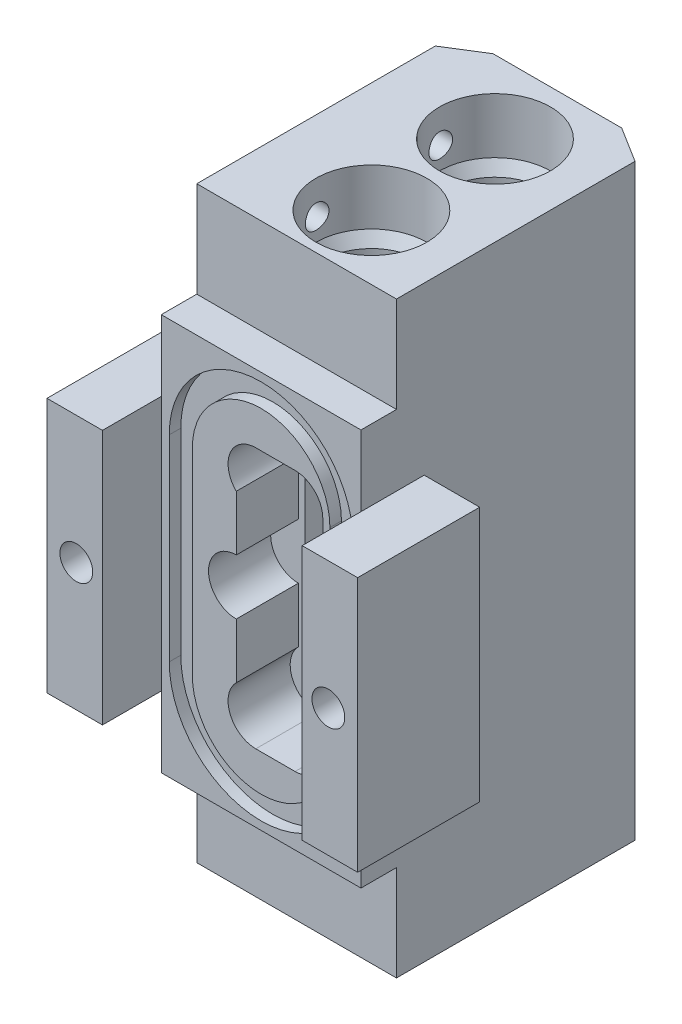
ISO-10303-21;
HEADER;
FILE_DESCRIPTION(('STEP AP214'),'2;1');
FILE_NAME('part.step','',(''),(''),'','','');
FILE_SCHEMA(('AUTOMOTIVE_DESIGN { 1 0 10303 214 1 1 1 1 }'));
ENDSEC;
DATA;
#1=APPLICATION_CONTEXT('core data for automotive mechanical design processes');
#2=APPLICATION_PROTOCOL_DEFINITION('international standard','automotive_design',2000,#1);
#3=PRODUCT_CONTEXT('',#1,'mechanical');
#4=PRODUCT('Part','Part','',(#3));
#5=PRODUCT_RELATED_PRODUCT_CATEGORY('part','',(#4));
#6=PRODUCT_DEFINITION_FORMATION('','',#4);
#7=PRODUCT_DEFINITION_CONTEXT('part definition',#1,'design');
#8=PRODUCT_DEFINITION('design','',#6,#7);
#9=PRODUCT_DEFINITION_SHAPE('','',#8);
#10=(LENGTH_UNIT() NAMED_UNIT(*) SI_UNIT(.MILLI.,.METRE.));
#11=(NAMED_UNIT(*) PLANE_ANGLE_UNIT() SI_UNIT($,.RADIAN.));
#12=(NAMED_UNIT(*) SI_UNIT($,.STERADIAN.) SOLID_ANGLE_UNIT());
#13=UNCERTAINTY_MEASURE_WITH_UNIT(LENGTH_MEASURE(1.E-05),#10,'distance_accuracy_value','');
#14=(GEOMETRIC_REPRESENTATION_CONTEXT(3) GLOBAL_UNCERTAINTY_ASSIGNED_CONTEXT((#13)) GLOBAL_UNIT_ASSIGNED_CONTEXT((#10,
#11,#12)) REPRESENTATION_CONTEXT('',''));
#15=CARTESIAN_POINT('',(0.,0.,0.));
#16=DIRECTION('',(0.,0.,1.));
#17=DIRECTION('',(1.,0.,0.));
#18=AXIS2_PLACEMENT_3D('',#15,#16,#17);
#19=CARTESIAN_POINT('',(1.0922,40.9575,-27.686));
#20=DIRECTION('',(0.,0.,-1.));
#21=DIRECTION('',(-1.,0.,0.));
#22=AXIS2_PLACEMENT_3D('',#19,#20,#21);
#23=PLANE('',#22);
#24=DIRECTION('',(-1.,0.,0.));
#25=VECTOR('',#24,1.);
#26=CARTESIAN_POINT('',(1.0922,40.9575,-27.686));
#27=LINE('',#26,#25);
#28=CARTESIAN_POINT('',(1.0922,40.9575,-27.686));
#29=VERTEX_POINT('',#28);
#30=CARTESIAN_POINT('',(1.6002,40.9575,-27.686));
#31=VERTEX_POINT('',#30);
#32=EDGE_CURVE('E576',#29,#31,#27,.F.);
#33=ORIENTED_EDGE('',*,*,#32,.F.);
#34=DIRECTION('',(0.,1.,0.));
#35=VECTOR('',#34,1.);
#36=CARTESIAN_POINT('',(1.0922,40.9575,-27.686));
#37=LINE('',#36,#35);
#38=CARTESIAN_POINT('',(1.0922,26.3525,-27.686));
#39=VERTEX_POINT('',#38);
#40=EDGE_CURVE('E438',#29,#39,#37,.F.);
#41=ORIENTED_EDGE('',*,*,#40,.T.);
#42=DIRECTION('',(-1.,0.,0.));
#43=VECTOR('',#42,1.);
#44=CARTESIAN_POINT('',(1.0922,26.3525,-27.686));
#45=LINE('',#44,#43);
#46=CARTESIAN_POINT('',(1.6002,26.3525,-27.686));
#47=VERTEX_POINT('',#46);
#48=EDGE_CURVE('E580',#47,#39,#45,.T.);
#49=ORIENTED_EDGE('',*,*,#48,.F.);
#50=DIRECTION('',(0.,-1.,0.));
#51=VECTOR('',#50,1.);
#52=CARTESIAN_POINT('',(1.6002,40.9575,-27.686));
#53=LINE('',#52,#51);
#54=EDGE_CURVE('E571',#47,#31,#53,.F.);
#55=ORIENTED_EDGE('',*,*,#54,.T.);
#56=EDGE_LOOP('',(#33,#41,#49,#55));
#57=FACE_BOUND('',#56,.T.);
#58=ADVANCED_FACE('F17',(#57),#23,.F.);
#59=CARTESIAN_POINT('',(1.6002,40.9575,-24.511));
#60=DIRECTION('',(0.,-1.,0.));
#61=DIRECTION('',(1.,0.,0.));
#62=AXIS2_PLACEMENT_3D('',#59,#60,#61);
#63=CYLINDRICAL_SURFACE('',#62,3.175);
#64=DIRECTION('',(0.,1.,0.));
#65=VECTOR('',#64,1.);
#66=CARTESIAN_POINT('',(4.7752,40.9575,-24.511));
#67=LINE('',#66,#65);
#68=CARTESIAN_POINT('',(4.7752,26.3525,-24.511));
#69=VERTEX_POINT('',#68);
#70=CARTESIAN_POINT('',(4.7752,40.9575,-24.511));
#71=VERTEX_POINT('',#70);
#72=EDGE_CURVE('E548',#69,#71,#67,.T.);
#73=ORIENTED_EDGE('',*,*,#72,.T.);
#74=CARTESIAN_POINT('',(1.6002,40.9575,-24.511));
#75=DIRECTION('',(0.,1.,0.));
#76=DIRECTION('',(1.,0.,0.));
#77=AXIS2_PLACEMENT_3D('',#74,#75,#76);
#78=CIRCLE('',#77,3.175);
#79=EDGE_CURVE('E498',#71,#31,#78,.T.);
#80=ORIENTED_EDGE('',*,*,#79,.T.);
#81=ORIENTED_EDGE('',*,*,#54,.F.);
#82=CARTESIAN_POINT('',(1.6002,26.3525,-24.511));
#83=DIRECTION('',(0.,1.,0.));
#84=DIRECTION('',(1.,0.,0.));
#85=AXIS2_PLACEMENT_3D('',#82,#83,#84);
#86=CIRCLE('',#85,3.175);
#87=EDGE_CURVE('E563',#47,#69,#86,.F.);
#88=ORIENTED_EDGE('',*,*,#87,.T.);
#89=EDGE_LOOP('',(#73,#80,#81,#88));
#90=FACE_BOUND('',#89,.T.);
#91=ADVANCED_FACE('F2066',(#90),#63,.F.);
#92=CARTESIAN_POINT('',(1.0922,40.9575,-24.511));
#93=DIRECTION('',(0.,1.,0.));
#94=DIRECTION('',(-1.,0.,0.));
#95=AXIS2_PLACEMENT_3D('',#92,#93,#94);
#96=CYLINDRICAL_SURFACE('',#95,3.175);
#97=ORIENTED_EDGE('',*,*,#40,.F.);
#98=CARTESIAN_POINT('',(1.0922,40.9575,-24.511));
#99=DIRECTION('',(0.,1.,0.));
#100=DIRECTION('',(1.,0.,0.));
#101=AXIS2_PLACEMENT_3D('',#98,#99,#100);
#102=CIRCLE('',#101,3.175);
#103=CARTESIAN_POINT('',(-2.0828,40.9575,-24.511));
#104=VERTEX_POINT('',#103);
#105=EDGE_CURVE('E551',#29,#104,#102,.T.);
#106=ORIENTED_EDGE('',*,*,#105,.T.);
#107=DIRECTION('',(0.,-1.,0.));
#108=VECTOR('',#107,1.);
#109=CARTESIAN_POINT('',(-2.0828,40.9575,-24.511));
#110=LINE('',#109,#108);
#111=CARTESIAN_POINT('',(-2.0828,26.3525,-24.511));
#112=VERTEX_POINT('',#111);
#113=EDGE_CURVE('E544',#104,#112,#110,.T.);
#114=ORIENTED_EDGE('',*,*,#113,.T.);
#115=CARTESIAN_POINT('',(1.0922,26.3525,-24.511));
#116=DIRECTION('',(0.,1.,0.));
#117=DIRECTION('',(1.,0.,0.));
#118=AXIS2_PLACEMENT_3D('',#115,#116,#117);
#119=CIRCLE('',#118,3.175);
#120=EDGE_CURVE('E557',#112,#39,#119,.F.);
#121=ORIENTED_EDGE('',*,*,#120,.T.);
#122=EDGE_LOOP('',(#97,#106,#114,#121));
#123=FACE_BOUND('',#122,.T.);
#124=ADVANCED_FACE('F2059',(#123),#96,.F.);
#125=CARTESIAN_POINT('',(1.0922,44.1325,-27.686));
#126=DIRECTION('',(0.,1.,0.));
#127=DIRECTION('',(0.,0.,1.));
#128=AXIS2_PLACEMENT_3D('',#125,#126,#127);
#129=PLANE('',#128);
#130=CARTESIAN_POINT('',(1.1938,44.1325,-11.43));
#131=DIRECTION('',(0.,1.,0.));
#132=DIRECTION('',(0.,0.,1.));
#133=AXIS2_PLACEMENT_3D('',#130,#131,#132);
#134=CIRCLE('',#133,3.57250999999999);
#135=CARTESIAN_POINT('',(1.0922,44.1325,-15.0010649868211));
#136=VERTEX_POINT('',#135);
#137=CARTESIAN_POINT('',(1.6002,44.1325,-14.9793191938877));
#138=VERTEX_POINT('',#137);
#139=EDGE_CURVE('E437',#136,#138,#134,.F.);
#140=ORIENTED_EDGE('',*,*,#139,.F.);
#141=DIRECTION('',(0.,0.,1.));
#142=VECTOR('',#141,1.);
#143=CARTESIAN_POINT('',(1.0922,44.1325,-27.686));
#144=LINE('',#143,#142);
#145=CARTESIAN_POINT('',(1.0922,44.1325,-22.0067350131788));
#146=VERTEX_POINT('',#145);
#147=EDGE_CURVE('E435',#136,#146,#144,.F.);
#148=ORIENTED_EDGE('',*,*,#147,.T.);
#149=CARTESIAN_POINT('',(1.1938,44.1325,-25.5778));
#150=DIRECTION('',(0.,1.,0.));
#151=DIRECTION('',(0.,0.,1.));
#152=AXIS2_PLACEMENT_3D('',#149,#150,#151);
#153=CIRCLE('',#152,3.57250999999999);
#154=CARTESIAN_POINT('',(1.6002,44.1325,-22.0284808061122));
#155=VERTEX_POINT('',#154);
#156=EDGE_CURVE('E20',#155,#146,#153,.F.);
#157=ORIENTED_EDGE('',*,*,#156,.F.);
#158=DIRECTION('',(0.,0.,1.));
#159=VECTOR('',#158,1.);
#160=CARTESIAN_POINT('',(1.6002,44.1325,-27.686));
#161=LINE('',#160,#159);
#162=EDGE_CURVE('E432',#155,#138,#161,.T.);
#163=ORIENTED_EDGE('',*,*,#162,.T.);
#164=EDGE_LOOP('',(#140,#148,#157,#163));
#165=FACE_BOUND('',#164,.T.);
#166=ADVANCED_FACE('F431',(#165),#129,.F.);
#167=CARTESIAN_POINT('',(1.6002,40.9575,-24.511));
#168=DIRECTION('',(1.,0.,0.));
#169=DIRECTION('',(0.,0.,-1.));
#170=AXIS2_PLACEMENT_3D('',#167,#168,#169);
#171=SPHERICAL_SURFACE('',#170,3.175);
#172=CARTESIAN_POINT('',(4.62785074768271,41.9099999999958,-24.5928516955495));
#173=CARTESIAN_POINT('',(4.62401414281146,41.9233456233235,-24.5794617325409));
#174=CARTESIAN_POINT('',(4.62005086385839,41.9365191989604,-24.5659457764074));
#175=CARTESIAN_POINT('',(4.61187095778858,41.9625222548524,-24.5386618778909));
#176=CARTESIAN_POINT('',(4.60765433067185,41.9753517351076,-24.5248939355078));
#177=CARTESIAN_POINT('',(4.60331102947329,41.9880091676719,-24.511));
#178=B_SPLINE_CURVE_WITH_KNOTS('',3,(#172,#173,#174,#175,#176,#177),.UNSPECIFIED.,.F.,.F.,(4,2,
4),(0.,0.0578565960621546,0.115713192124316),.UNSPECIFIED.);
#179=CARTESIAN_POINT('',(4.62785074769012,41.9099999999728,-24.5928516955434));
#180=VERTEX_POINT('',#179);
#181=CARTESIAN_POINT('',(4.60331102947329,41.9880091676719,-24.511));
#182=VERTEX_POINT('',#181);
#183=EDGE_CURVE('E453',#180,#182,#178,.T.);
#184=ORIENTED_EDGE('',*,*,#183,.F.);
#185=CARTESIAN_POINT('',(4.62785074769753,41.9099999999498,-24.5928516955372));
#186=CARTESIAN_POINT('',(4.63009333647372,41.8938507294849,-24.6981331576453));
#187=CARTESIAN_POINT('',(4.62686263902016,41.8771670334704,-24.8033968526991));
#188=CARTESIAN_POINT('',(4.60955649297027,41.8427886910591,-25.0130261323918));
#189=CARTESIAN_POINT('',(4.59546477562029,41.825092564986,-25.1173901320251));
#190=CARTESIAN_POINT('',(4.54401363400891,41.777125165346,-25.3904819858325));
#191=CARTESIAN_POINT('',(4.49751876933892,41.7460855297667,-25.5574396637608));
#192=CARTESIAN_POINT('',(4.37691874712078,41.6821351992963,-25.8807476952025));
#193=CARTESIAN_POINT('',(4.30279313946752,41.6492231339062,-26.0370900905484));
#194=CARTESIAN_POINT('',(4.12907502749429,41.5821729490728,-26.3347370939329));
#195=CARTESIAN_POINT('',(4.02947211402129,41.5480343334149,-26.4760355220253));
#196=CARTESIAN_POINT('',(3.80769163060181,41.4793512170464,-26.7394737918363));
#197=CARTESIAN_POINT('',(3.68551865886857,41.4448068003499,-26.861617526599));
#198=CARTESIAN_POINT('',(3.42169255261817,41.3762020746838,-27.0836409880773));
#199=CARTESIAN_POINT('',(3.27998674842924,41.3421433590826,-27.1834585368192));
#200=CARTESIAN_POINT('',(2.98117804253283,41.2758220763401,-27.3576046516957));
#201=CARTESIAN_POINT('',(2.82407295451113,41.243559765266,-27.4319295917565));
#202=CARTESIAN_POINT('',(2.57738991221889,41.1971530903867,-27.5237499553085));
#203=CARTESIAN_POINT('',(2.49168396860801,41.1817589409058,-27.5513836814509));
#204=CARTESIAN_POINT('',(2.31795575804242,41.1521197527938,-27.5990246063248));
#205=CARTESIAN_POINT('',(2.22993343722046,41.1378747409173,-27.6190316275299));
#206=CARTESIAN_POINT('',(2.05212990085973,41.1107829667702,-27.6512622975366));
#207=CARTESIAN_POINT('',(1.96234626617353,41.0979383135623,-27.6634743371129));
#208=CARTESIAN_POINT('',(1.78181940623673,41.073944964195,-27.6799835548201));
#209=CARTESIAN_POINT('',(1.69107606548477,41.0627964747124,-27.6842797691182));
#210=CARTESIAN_POINT('',(1.60019999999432,41.0526343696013,-27.6845743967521));
#211=B_SPLINE_CURVE_WITH_KNOTS('',3,(#185,#186,#187,#188,#189,#190,#191,#192,#193,#194,#195,
#196,#197,#198,#199,#200,#201,#202,#203,#204,#205,#206,#207,#208,#209,#210),.UNSPECIFIED.,.F.,
.F.,(4,2,2,2,2,2,2,2,2,2,2,2,4),(0.,0.319368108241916,0.639215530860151,1.16475663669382,
1.69068748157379,2.21683354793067,2.74287254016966,3.2703587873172,3.79792003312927,
4.07169547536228,4.34547728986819,4.61966590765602,4.89388790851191),.UNSPECIFIED.);
#212=CARTESIAN_POINT('',(1.60019999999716,41.0526343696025,-27.6845743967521));
#213=VERTEX_POINT('',#212);
#214=EDGE_CURVE('E2165',#180,#213,#211,.T.);
#215=ORIENTED_EDGE('',*,*,#214,.T.);
#216=CARTESIAN_POINT('',(1.6002,40.9575,-24.511));
#217=DIRECTION('',(1.,0.,0.));
#218=DIRECTION('',(0.,0.,-1.));
#219=AXIS2_PLACEMENT_3D('',#216,#217,#218);
#220=CIRCLE('',#219,3.175);
#221=EDGE_CURVE('E497',#213,#31,#220,.F.);
#222=ORIENTED_EDGE('',*,*,#221,.T.);
#223=ORIENTED_EDGE('',*,*,#79,.F.);
#224=CARTESIAN_POINT('',(1.6002,40.9575,-24.511));
#225=DIRECTION('',(0.,0.,1.));
#226=DIRECTION('',(1.,0.,0.));
#227=AXIS2_PLACEMENT_3D('',#224,#225,#226);
#228=CIRCLE('',#227,3.175);
#229=EDGE_CURVE('E448',#71,#182,#228,.T.);
#230=ORIENTED_EDGE('',*,*,#229,.T.);
#231=EDGE_LOOP('',(#184,#215,#222,#223,#230));
#232=FACE_BOUND('',#231,.T.);
#233=ADVANCED_FACE('F505',(#232),#171,.F.);
#234=CARTESIAN_POINT('',(1.0922,40.9575,-24.511));
#235=DIRECTION('',(1.,0.,0.));
#236=DIRECTION('',(0.,0.,-1.));
#237=AXIS2_PLACEMENT_3D('',#234,#235,#236);
#238=CYLINDRICAL_SURFACE('',#237,3.175);
#239=CARTESIAN_POINT('',(1.60019999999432,41.0526343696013,-27.6845743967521));
#240=CARTESIAN_POINT('',(1.55803288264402,41.04791509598,-27.6847149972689));
#241=CARTESIAN_POINT('',(1.51578539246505,41.0438965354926,-27.6848257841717));
#242=CARTESIAN_POINT('',(1.43122981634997,41.0373160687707,-27.6849985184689));
#243=CARTESIAN_POINT('',(1.38892186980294,41.0347523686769,-27.6850605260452));
#244=CARTESIAN_POINT('',(1.30423967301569,41.0311248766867,-27.6851467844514));
#245=CARTESIAN_POINT('',(1.26186542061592,41.030061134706,-27.6851710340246));
#246=CARTESIAN_POINT('',(1.17705357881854,41.0294460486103,-27.6851844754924));
#247=CARTESIAN_POINT('',(1.13461597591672,41.0298965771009,-27.6851736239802));
#248=CARTESIAN_POINT('',(1.09220000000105,41.0311117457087,-27.6851465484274));
#249=B_SPLINE_CURVE_WITH_KNOTS('',3,(#239,#240,#241,#242,#243,#244,#245,#246,#247,#248),
.UNSPECIFIED.,.F.,.F.,(4,2,2,2,4),(0.,0.127288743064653,0.254420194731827,0.381555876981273,
0.508848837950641),.UNSPECIFIED.);
#250=CARTESIAN_POINT('',(1.09220000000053,41.0311117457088,-27.6851465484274));
#251=VERTEX_POINT('',#250);
#252=EDGE_CURVE('E2155',#213,#251,#249,.T.);
#253=ORIENTED_EDGE('',*,*,#252,.T.);
#254=CARTESIAN_POINT('',(1.0922,40.9575,-24.511));
#255=DIRECTION('',(1.,0.,0.));
#256=DIRECTION('',(0.,0.,-1.));
#257=AXIS2_PLACEMENT_3D('',#254,#255,#256);
#258=CIRCLE('',#257,3.175);
#259=EDGE_CURVE('E554',#251,#29,#258,.F.);
#260=ORIENTED_EDGE('',*,*,#259,.T.);
#261=ORIENTED_EDGE('',*,*,#32,.T.);
#262=ORIENTED_EDGE('',*,*,#221,.F.);
#263=EDGE_LOOP('',(#253,#260,#261,#262));
#264=FACE_BOUND('',#263,.T.);
#265=ADVANCED_FACE('F511',(#264),#238,.F.);
#266=CARTESIAN_POINT('',(1.0922,40.9575,-24.511));
#267=DIRECTION('',(1.,0.,0.));
#268=DIRECTION('',(0.,0.,-1.));
#269=AXIS2_PLACEMENT_3D('',#266,#267,#268);
#270=SPHERICAL_SURFACE('',#269,3.175);
#271=CARTESIAN_POINT('',(1.09220000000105,41.0311117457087,-27.6851465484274));
#272=CARTESIAN_POINT('',(1.00687268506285,41.0335390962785,-27.6850980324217));
#273=CARTESIAN_POINT('',(0.921583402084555,41.0370032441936,-27.6815665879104));
#274=CARTESIAN_POINT('',(0.751685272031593,41.045880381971,-27.6676018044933));
#275=CARTESIAN_POINT('',(0.667076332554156,41.0512931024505,-27.6571694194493));
#276=CARTESIAN_POINT('',(0.499234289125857,41.063934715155,-27.6294856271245));
#277=CARTESIAN_POINT('',(0.415999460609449,41.0711611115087,-27.6122435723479));
#278=CARTESIAN_POINT('',(0.251383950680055,41.0872621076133,-27.5710798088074));
#279=CARTESIAN_POINT('',(0.170003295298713,41.0961367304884,-27.5471580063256));
#280=CARTESIAN_POINT('',(-0.0711335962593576,41.1250345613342,-27.4653859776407));
#281=CARTESIAN_POINT('',(-0.22739065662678,41.147292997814,-27.3976109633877));
#282=CARTESIAN_POINT('',(-0.52599899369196,41.1961424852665,-27.2376176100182));
#283=CARTESIAN_POINT('',(-0.668348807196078,41.2227339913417,-27.14539670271));
#284=CARTESIAN_POINT('',(-0.937702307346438,41.2792458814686,-26.9372793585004));
#285=CARTESIAN_POINT('',(-1.06441464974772,41.3092138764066,-26.8210180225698));
#286=CARTESIAN_POINT('',(-1.29624414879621,41.3707786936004,-26.5690166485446));
#287=CARTESIAN_POINT('',(-1.40135879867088,41.4023757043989,-26.4332743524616));
#288=CARTESIAN_POINT('',(-1.58798275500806,41.4663912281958,-26.144738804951));
#289=CARTESIAN_POINT('',(-1.66926316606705,41.4988146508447,-25.9917985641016));
#290=CARTESIAN_POINT('',(-1.80457823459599,41.5632635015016,-25.674254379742));
#291=CARTESIAN_POINT('',(-1.8586195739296,41.5952890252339,-25.5096533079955));
#292=CARTESIAN_POINT('',(-1.93026827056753,41.6521157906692,-25.2059137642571));
#293=CARTESIAN_POINT('',(-1.9528905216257,41.677119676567,-25.0679827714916));
#294=CARTESIAN_POINT('',(-1.97244673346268,41.7137940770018,-24.8597150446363));
#295=CARTESIAN_POINT('',(-1.97656952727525,41.7258793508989,-24.7900696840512));
#296=CARTESIAN_POINT('',(-1.98001319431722,41.7497454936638,-24.6505964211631));
#297=CARTESIAN_POINT('',(-1.97933326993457,41.7615263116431,-24.5807684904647));
#298=CARTESIAN_POINT('',(-1.97624557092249,41.7731388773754,-24.5109999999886));
#299=B_SPLINE_CURVE_WITH_KNOTS('',3,(#271,#272,#273,#274,#275,#276,#277,#278,#279,#280,#281,
#282,#283,#284,#285,#286,#287,#288,#289,#290,#291,#292,#293,#294,#295,#296,#297,#298),
.UNSPECIFIED.,.F.,.F.,(4,2,2,2,2,2,2,2,2,2,2,2,2,4),(0.,0.255998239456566,0.511961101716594,
0.76757363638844,1.02318975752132,1.53591034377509,2.04868481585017,2.5699041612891,
3.09118396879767,3.61731727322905,4.143321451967,4.56793771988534,4.78021111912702,
4.99251977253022),.UNSPECIFIED.);
#300=CARTESIAN_POINT('',(-1.97624557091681,41.7731388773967,-24.5109999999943));
#301=VERTEX_POINT('',#300);
#302=EDGE_CURVE('E2167',#251,#301,#299,.T.);
#303=ORIENTED_EDGE('',*,*,#302,.T.);
#304=CARTESIAN_POINT('',(1.0922,40.9575,-24.511));
#305=DIRECTION('',(0.,0.,1.));
#306=DIRECTION('',(1.,0.,0.));
#307=AXIS2_PLACEMENT_3D('',#304,#305,#306);
#308=CIRCLE('',#307,3.175);
#309=EDGE_CURVE('E526',#301,#104,#308,.T.);
#310=ORIENTED_EDGE('',*,*,#309,.T.);
#311=ORIENTED_EDGE('',*,*,#105,.F.);
#312=ORIENTED_EDGE('',*,*,#259,.F.);
#313=EDGE_LOOP('',(#303,#310,#311,#312));
#314=FACE_BOUND('',#313,.T.);
#315=ADVANCED_FACE('F2032',(#314),#270,.F.);
#316=CARTESIAN_POINT('',(1.6002,26.3525,-24.511));
#317=DIRECTION('',(1.,0.,0.));
#318=DIRECTION('',(0.,0.,-1.));
#319=AXIS2_PLACEMENT_3D('',#316,#317,#318);
#320=SPHERICAL_SURFACE('',#319,3.175);
#321=CARTESIAN_POINT('',(4.60331102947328,25.321990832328,-24.511));
#322=CARTESIAN_POINT('',(4.6076543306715,25.3346482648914,-24.5248939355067));
#323=CARTESIAN_POINT('',(4.61187095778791,25.3474777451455,-24.5386618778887));
#324=CARTESIAN_POINT('',(4.62005086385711,25.3734808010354,-24.5659457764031));
#325=CARTESIAN_POINT('',(4.6240141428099,25.3866543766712,-24.5794617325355));
#326=CARTESIAN_POINT('',(4.62785074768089,25.3999999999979,-24.5928516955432));
#327=B_SPLINE_CURVE_WITH_KNOTS('',3,(#321,#322,#323,#324,#325,#326),.UNSPECIFIED.,.F.,.F.,(4,2,
4),(0.,0.0578565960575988,0.115713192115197),.UNSPECIFIED.);
#328=CARTESIAN_POINT('',(4.60331102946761,25.3219908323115,-24.5109999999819));
#329=VERTEX_POINT('',#328);
#330=CARTESIAN_POINT('',(4.62785074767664,25.3999999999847,-24.5928516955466));
#331=VERTEX_POINT('',#330);
#332=EDGE_CURVE('E499',#329,#331,#327,.T.);
#333=ORIENTED_EDGE('',*,*,#332,.F.);
#334=CARTESIAN_POINT('',(1.6002,26.3525,-24.511));
#335=DIRECTION('',(0.,-3.51738254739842E-11,-1.));
#336=DIRECTION('',(1.,0.,0.));
#337=AXIS2_PLACEMENT_3D('',#334,#335,#336);
#338=CIRCLE('',#337,3.175);
#339=EDGE_CURVE('E566',#69,#329,#338,.T.);
#340=ORIENTED_EDGE('',*,*,#339,.F.);
#341=ORIENTED_EDGE('',*,*,#87,.F.);
#342=CARTESIAN_POINT('',(1.6002,26.3525,-24.511));
#343=DIRECTION('',(-1.,0.,0.));
#344=DIRECTION('',(0.,0.,1.));
#345=AXIS2_PLACEMENT_3D('',#342,#343,#344);
#346=CIRCLE('',#345,3.175);
#347=CARTESIAN_POINT('',(1.60019999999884,26.2573656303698,-27.6845743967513));
#348=VERTEX_POINT('',#347);
#349=EDGE_CURVE('E1204',#47,#348,#346,.T.);
#350=ORIENTED_EDGE('',*,*,#349,.T.);
#351=CARTESIAN_POINT('',(1.60019999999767,26.2573656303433,-27.6845743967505));
#352=CARTESIAN_POINT('',(1.68617147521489,26.2477519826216,-27.6842941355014));
#353=CARTESIAN_POINT('',(1.77202467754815,26.2372554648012,-27.680434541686));
#354=CARTESIAN_POINT('',(1.94290378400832,26.2147310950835,-27.6656262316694));
#355=CARTESIAN_POINT('',(2.02792979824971,26.202703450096,-27.6546784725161));
#356=CARTESIAN_POINT('',(2.19649704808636,26.1773620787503,-27.625778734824));
#357=CARTESIAN_POINT('',(2.28003977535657,26.1640497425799,-27.6078342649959));
#358=CARTESIAN_POINT('',(2.44514751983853,26.136357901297,-27.5650867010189));
#359=CARTESIAN_POINT('',(2.526712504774,26.1219783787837,-27.540283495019));
#360=CARTESIAN_POINT('',(2.76828810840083,26.0774351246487,-27.4555794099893));
#361=CARTESIAN_POINT('',(2.92461965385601,26.0459525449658,-27.3854804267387));
#362=CARTESIAN_POINT('',(3.22285408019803,25.9810660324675,-27.2202098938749));
#363=CARTESIAN_POINT('',(3.36475699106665,25.9476621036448,-27.1250383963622));
#364=CARTESIAN_POINT('',(3.63200025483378,25.8797286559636,-26.9109398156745));
#365=CARTESIAN_POINT('',(3.75712173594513,25.8451904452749,-26.7917417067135));
#366=CARTESIAN_POINT('',(3.98523307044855,25.7763955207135,-26.5336709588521));
#367=CARTESIAN_POINT('',(4.08821894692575,25.7421388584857,-26.3947947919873));
#368=CARTESIAN_POINT('',(4.26933762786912,25.6746437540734,-26.1009254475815));
#369=CARTESIAN_POINT('',(4.34740153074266,25.6414083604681,-25.9458891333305));
#370=CARTESIAN_POINT('',(4.47595451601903,25.5767383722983,-25.6244696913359));
#371=CARTESIAN_POINT('',(4.52645949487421,25.5453027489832,-25.4580931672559));
#372=CARTESIAN_POINT('',(4.58662026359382,25.4947094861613,-25.1744419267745));
#373=CARTESIAN_POINT('',(4.60423421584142,25.474899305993,-25.058908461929));
#374=CARTESIAN_POINT('',(4.62608964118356,25.4365066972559,-24.8265374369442));
#375=CARTESIAN_POINT('',(4.63034834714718,25.4179227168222,-24.7097017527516));
#376=CARTESIAN_POINT('',(4.6278507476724,25.3999999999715,-24.59285169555));
#377=B_SPLINE_CURVE_WITH_KNOTS('',3,(#351,#352,#353,#354,#355,#356,#357,#358,#359,#360,#361,
#362,#363,#364,#365,#366,#367,#368,#369,#370,#371,#372,#373,#374,#375,#376),.UNSPECIFIED.,.F.,
.F.,(4,2,2,2,2,2,2,2,2,2,2,2,4),(0.,0.259432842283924,0.518830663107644,0.777950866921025,
1.03707529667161,1.55702607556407,2.07697577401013,2.60315671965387,3.12943212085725,
3.65715015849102,4.18456347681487,4.53945023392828,4.89387887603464),.UNSPECIFIED.);
#378=EDGE_CURVE('E1237',#348,#331,#377,.T.);
#379=ORIENTED_EDGE('',*,*,#378,.T.);
#380=EDGE_LOOP('',(#333,#340,#341,#350,#379));
#381=FACE_BOUND('',#380,.T.);
#382=ADVANCED_FACE('F1222',(#381),#320,.F.);
#383=CARTESIAN_POINT('',(1.0922,26.3525,-24.511));
#384=DIRECTION('',(1.,0.,0.));
#385=DIRECTION('',(0.,0.,-1.));
#386=AXIS2_PLACEMENT_3D('',#383,#384,#385);
#387=SPHERICAL_SURFACE('',#386,3.175);
#388=CARTESIAN_POINT('',(-1.97624557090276,25.5368611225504,-24.5110000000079));
#389=CARTESIAN_POINT('',(-1.98089794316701,25.5543332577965,-24.6159805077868));
#390=CARTESIAN_POINT('',(-1.98008626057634,25.5721872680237,-24.7210876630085));
#391=CARTESIAN_POINT('',(-1.96760590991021,25.6085754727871,-24.9307110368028));
#392=CARTESIAN_POINT('',(-1.95591988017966,25.6271107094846,-25.0352260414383));
#393=CARTESIAN_POINT('',(-1.91070679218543,25.6768728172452,-25.3094401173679));
#394=CARTESIAN_POINT('',(-1.86794596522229,25.7085613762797,-25.4776195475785));
#395=CARTESIAN_POINT('',(-1.75440344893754,25.7726622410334,-25.8041443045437));
#396=CARTESIAN_POINT('',(-1.68360272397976,25.8050750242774,-25.9624828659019));
#397=CARTESIAN_POINT('',(-1.51599460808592,25.869760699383,-26.2647993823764));
#398=CARTESIAN_POINT('',(-1.41918639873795,25.9020335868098,-26.4087768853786));
#399=CARTESIAN_POINT('',(-1.20230079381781,25.9653766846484,-26.6782436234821));
#400=CARTESIAN_POINT('',(-1.08222727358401,25.9964470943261,-26.8037359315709));
#401=CARTESIAN_POINT('',(-0.822198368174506,26.056092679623,-27.0326488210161));
#402=CARTESIAN_POINT('',(-0.682254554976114,26.0846692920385,-27.1360821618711));
#403=CARTESIAN_POINT('',(-0.386265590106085,26.1378383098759,-27.3180639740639));
#404=CARTESIAN_POINT('',(-0.230212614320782,26.1624287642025,-27.3966002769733));
#405=CARTESIAN_POINT('',(0.0926991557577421,26.2057821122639,-27.5260600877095));
#406=CARTESIAN_POINT('',(0.259486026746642,26.2245797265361,-27.5771495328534));
#407=CARTESIAN_POINT('',(0.514393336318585,26.2473198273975,-27.6324323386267));
#408=CARTESIAN_POINT('',(0.600096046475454,26.2539880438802,-27.6472987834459));
#409=CARTESIAN_POINT('',(0.772559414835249,26.2653610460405,-27.669866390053));
#410=CARTESIAN_POINT('',(0.859319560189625,26.2700667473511,-27.6775708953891));
#411=CARTESIAN_POINT('',(0.994876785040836,26.2757790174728,-27.6839557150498));
#412=CARTESIAN_POINT('',(1.04353826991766,26.2775016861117,-27.685117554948));
#413=CARTESIAN_POINT('',(1.09220000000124,26.278888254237,-27.6851465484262));
#414=B_SPLINE_CURVE_WITH_KNOTS('',3,(#388,#389,#390,#391,#392,#393,#394,#395,#396,#397,#398,
#399,#400,#401,#402,#403,#404,#405,#406,#407,#408,#409,#410,#411,#412,#413),.UNSPECIFIED.,.F.,
.F.,(4,2,2,2,2,2,2,2,2,2,2,2,4),(0.,0.319339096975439,0.639188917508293,1.1657201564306,
1.69260945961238,2.21951534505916,2.74633353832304,3.27284617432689,3.79961574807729,
4.32316369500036,4.58461586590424,4.84594591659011,4.99200158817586),.UNSPECIFIED.);
#415=CARTESIAN_POINT('',(-1.97624557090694,25.5368611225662,-24.511000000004));
#416=VERTEX_POINT('',#415);
#417=CARTESIAN_POINT('',(1.09220000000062,26.278888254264,-27.6851465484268));
#418=VERTEX_POINT('',#417);
#419=EDGE_CURVE('E1229',#416,#418,#414,.T.);
#420=ORIENTED_EDGE('',*,*,#419,.T.);
#421=CARTESIAN_POINT('',(1.0922,26.3525,-24.511));
#422=DIRECTION('',(-1.,0.,0.));
#423=DIRECTION('',(0.,0.,1.));
#424=AXIS2_PLACEMENT_3D('',#421,#422,#423);
#425=CIRCLE('',#424,3.175);
#426=EDGE_CURVE('E1201',#418,#39,#425,.F.);
#427=ORIENTED_EDGE('',*,*,#426,.T.);
#428=ORIENTED_EDGE('',*,*,#120,.F.);
#429=CARTESIAN_POINT('',(1.0922,26.3525,-24.511));
#430=DIRECTION('',(0.,0.,-1.));
#431=DIRECTION('',(1.,0.,0.));
#432=AXIS2_PLACEMENT_3D('',#429,#430,#431);
#433=CIRCLE('',#432,3.175);
#434=EDGE_CURVE('E560',#416,#112,#433,.T.);
#435=ORIENTED_EDGE('',*,*,#434,.F.);
#436=EDGE_LOOP('',(#420,#427,#428,#435));
#437=FACE_BOUND('',#436,.T.);
#438=ADVANCED_FACE('F1217',(#437),#387,.F.);
#439=CARTESIAN_POINT('',(1.0922,26.3525,-24.511));
#440=DIRECTION('',(-1.,0.,0.));
#441=DIRECTION('',(0.,0.,1.));
#442=AXIS2_PLACEMENT_3D('',#439,#440,#441);
#443=CYLINDRICAL_SURFACE('',#442,3.175);
#444=CARTESIAN_POINT('',(1.09220000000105,26.2788882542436,-27.6851465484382));
#445=CARTESIAN_POINT('',(1.12605618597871,26.2798613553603,-27.685167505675));
#446=CARTESIAN_POINT('',(1.15992748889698,26.280342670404,-27.6851790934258));
#447=CARTESIAN_POINT('',(1.26160489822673,26.2803316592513,-27.6851813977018));
#448=CARTESIAN_POINT('',(1.32941463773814,26.2783809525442,-27.6851395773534));
#449=CARTESIAN_POINT('',(1.46495633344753,26.2706942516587,-27.6849457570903));
#450=CARTESIAN_POINT('',(1.53268786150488,26.2649506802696,-27.6847935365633));
#451=CARTESIAN_POINT('',(1.60019999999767,26.2573656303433,-27.6845743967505));
#452=B_SPLINE_CURVE_WITH_KNOTS('',3,(#444,#445,#446,#447,#448,#449,#450,#451),.UNSPECIFIED.,.F.,
.F.,(4,2,2,4),(0.,0.101610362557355,0.305010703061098,0.508818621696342),.UNSPECIFIED.);
#453=EDGE_CURVE('E1196',#418,#348,#452,.T.);
#454=ORIENTED_EDGE('',*,*,#453,.T.);
#455=ORIENTED_EDGE('',*,*,#349,.F.);
#456=ORIENTED_EDGE('',*,*,#48,.T.);
#457=ORIENTED_EDGE('',*,*,#426,.F.);
#458=EDGE_LOOP('',(#454,#455,#456,#457));
#459=FACE_BOUND('',#458,.T.);
#460=ADVANCED_FACE('F1221',(#459),#443,.F.);
#461=CARTESIAN_POINT('',(4.7752,40.9575,-27.686));
#462=DIRECTION('',(1.,0.,0.));
#463=DIRECTION('',(0.,1.,0.));
#464=AXIS2_PLACEMENT_3D('',#461,#462,#463);
#465=PLANE('',#464);
#466=ORIENTED_EDGE('',*,*,#72,.F.);
#467=DIRECTION('',(0.,0.,1.));
#468=VECTOR('',#467,1.);
#469=CARTESIAN_POINT('',(4.77520000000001,26.3525,-27.686));
#470=LINE('',#469,#468);
#471=CARTESIAN_POINT('',(4.7752,26.3525,-7.11200000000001));
#472=VERTEX_POINT('',#471);
#473=EDGE_CURVE('E1192',#69,#472,#470,.T.);
#474=ORIENTED_EDGE('',*,*,#473,.T.);
#475=DIRECTION('',(0.,1.,0.));
#476=VECTOR('',#475,1.);
#477=CARTESIAN_POINT('',(4.7752,21.9075,-7.11200000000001));
#478=LINE('',#477,#476);
#479=CARTESIAN_POINT('',(4.7752,40.9575,-7.11200000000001));
#480=VERTEX_POINT('',#479);
#481=EDGE_CURVE('E1177',#480,#472,#478,.F.);
#482=ORIENTED_EDGE('',*,*,#481,.F.);
#483=DIRECTION('',(0.,0.,1.));
#484=VECTOR('',#483,1.);
#485=CARTESIAN_POINT('',(4.7752,40.9575,-27.686));
#486=LINE('',#485,#484);
#487=EDGE_CURVE('E532',#480,#71,#486,.F.);
#488=ORIENTED_EDGE('',*,*,#487,.T.);
#489=EDGE_LOOP('',(#466,#474,#482,#488));
#490=FACE_BOUND('',#489,.T.);
#491=ADVANCED_FACE('F2004',(#490),#465,.F.);
#492=CARTESIAN_POINT('',(-2.0828,40.9575,-27.686));
#493=DIRECTION('',(-1.,0.,0.));
#494=DIRECTION('',(0.,-1.,0.));
#495=AXIS2_PLACEMENT_3D('',#492,#493,#494);
#496=PLANE('',#495);
#497=ORIENTED_EDGE('',*,*,#113,.F.);
#498=DIRECTION('',(0.,0.,1.));
#499=VECTOR('',#498,1.);
#500=CARTESIAN_POINT('',(-2.0828,40.9575,-27.686));
#501=LINE('',#500,#499);
#502=CARTESIAN_POINT('',(-2.0828,40.9575,-7.11200000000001));
#503=VERTEX_POINT('',#502);
#504=EDGE_CURVE('E538',#104,#503,#501,.T.);
#505=ORIENTED_EDGE('',*,*,#504,.T.);
#506=DIRECTION('',(0.,1.,0.));
#507=VECTOR('',#506,1.);
#508=CARTESIAN_POINT('',(-2.0828,21.9075,-7.11200000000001));
#509=LINE('',#508,#507);
#510=CARTESIAN_POINT('',(-2.0828,26.3525,-7.11200000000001));
#511=VERTEX_POINT('',#510);
#512=EDGE_CURVE('E527',#511,#503,#509,.T.);
#513=ORIENTED_EDGE('',*,*,#512,.F.);
#514=DIRECTION('',(0.,0.,1.));
#515=VECTOR('',#514,1.);
#516=CARTESIAN_POINT('',(-2.0828,26.3525,-27.686));
#517=LINE('',#516,#515);
#518=EDGE_CURVE('E1186',#511,#112,#517,.F.);
#519=ORIENTED_EDGE('',*,*,#518,.T.);
#520=EDGE_LOOP('',(#497,#505,#513,#519));
#521=FACE_BOUND('',#520,.T.);
#522=ADVANCED_FACE('F1995',(#521),#496,.F.);
#523=CARTESIAN_POINT('',(1.0922,23.1775,-27.686));
#524=DIRECTION('',(0.,-1.,0.));
#525=DIRECTION('',(0.,0.,-1.));
#526=AXIS2_PLACEMENT_3D('',#523,#524,#525);
#527=PLANE('',#526);
#528=CARTESIAN_POINT('',(1.1938,23.1775,-25.5778));
#529=DIRECTION('',(0.,-1.,0.));
#530=DIRECTION('',(0.,0.,-1.));
#531=AXIS2_PLACEMENT_3D('',#528,#529,#530);
#532=CIRCLE('',#531,3.57250999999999);
#533=CARTESIAN_POINT('',(1.0922,23.1775,-22.0067350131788));
#534=VERTEX_POINT('',#533);
#535=CARTESIAN_POINT('',(1.6002,23.1775,-22.0284808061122));
#536=VERTEX_POINT('',#535);
#537=EDGE_CURVE('E1179',#534,#536,#532,.F.);
#538=ORIENTED_EDGE('',*,*,#537,.F.);
#539=DIRECTION('',(0.,0.,1.));
#540=VECTOR('',#539,1.);
#541=CARTESIAN_POINT('',(1.0922,23.1775,-27.686));
#542=LINE('',#541,#540);
#543=CARTESIAN_POINT('',(1.0922,23.1775,-15.0010649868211));
#544=VERTEX_POINT('',#543);
#545=EDGE_CURVE('E1147',#534,#544,#542,.T.);
#546=ORIENTED_EDGE('',*,*,#545,.T.);
#547=CARTESIAN_POINT('',(1.1938,23.1775,-11.43));
#548=DIRECTION('',(0.,-1.,0.));
#549=DIRECTION('',(0.,0.,-1.));
#550=AXIS2_PLACEMENT_3D('',#547,#548,#549);
#551=CIRCLE('',#550,3.57250999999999);
#552=CARTESIAN_POINT('',(1.6002,23.1775,-14.9793191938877));
#553=VERTEX_POINT('',#552);
#554=EDGE_CURVE('E547',#553,#544,#551,.F.);
#555=ORIENTED_EDGE('',*,*,#554,.F.);
#556=DIRECTION('',(0.,0.,1.));
#557=VECTOR('',#556,1.);
#558=CARTESIAN_POINT('',(1.6002,23.1775,-27.686));
#559=LINE('',#558,#557);
#560=EDGE_CURVE('E1151',#553,#536,#559,.F.);
#561=ORIENTED_EDGE('',*,*,#560,.T.);
#562=EDGE_LOOP('',(#538,#546,#555,#561));
#563=FACE_BOUND('',#562,.T.);
#564=ADVANCED_FACE('F1986',(#563),#527,.F.);
#565=CARTESIAN_POINT('',(-0.609599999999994,21.9075,-7.11200000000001));
#566=DIRECTION('',(0.,0.,1.));
#567=DIRECTION('',(1.,0.,0.));
#568=AXIS2_PLACEMENT_3D('',#565,#566,#567);
#569=PLANE('',#568);
#570=CARTESIAN_POINT('',(-2.84479999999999,33.655,-7.11200000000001));
#571=DIRECTION('',(0.,0.,1.));
#572=DIRECTION('',(1.,0.,0.));
#573=AXIS2_PLACEMENT_3D('',#570,#571,#572);
#574=CIRCLE('',#573,3.175);
#575=CARTESIAN_POINT('',(-2.84479999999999,36.83,-7.11200000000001));
#576=VERTEX_POINT('',#575);
#577=CARTESIAN_POINT('',(-2.84479999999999,30.48,-7.11200000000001));
#578=VERTEX_POINT('',#577);
#579=EDGE_CURVE('E1115',#576,#578,#574,.T.);
#580=ORIENTED_EDGE('',*,*,#579,.T.);
#581=DIRECTION('',(0.,-1.,0.));
#582=VECTOR('',#581,1.);
#583=CARTESIAN_POINT('',(-2.84479999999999,30.48,-7.11200000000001));
#584=LINE('',#583,#582);
#585=CARTESIAN_POINT('',(-2.8448,24.1623849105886,-7.11200000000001));
#586=VERTEX_POINT('',#585);
#587=EDGE_CURVE('E1111',#578,#586,#584,.T.);
#588=ORIENTED_EDGE('',*,*,#587,.T.);
#589=CARTESIAN_POINT('',(-0.609599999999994,21.9075,-7.11200000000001));
#590=DIRECTION('',(0.,0.,1.));
#591=DIRECTION('',(1.,0.,0.));
#592=AXIS2_PLACEMENT_3D('',#589,#590,#591);
#593=CIRCLE('',#592,3.175);
#594=CARTESIAN_POINT('',(-0.609599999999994,18.7325,-7.11200000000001));
#595=VERTEX_POINT('',#594);
#596=EDGE_CURVE('E1104',#586,#595,#593,.T.);
#597=ORIENTED_EDGE('',*,*,#596,.T.);
#598=DIRECTION('',(1.,0.,0.));
#599=VECTOR('',#598,1.);
#600=CARTESIAN_POINT('',(-0.609599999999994,18.7325,-7.11200000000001));
#601=LINE('',#600,#599);
#602=CARTESIAN_POINT('',(3.8862,18.7325,-7.11200000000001));
#603=VERTEX_POINT('',#602);
#604=EDGE_CURVE('E1103',#595,#603,#601,.T.);
#605=ORIENTED_EDGE('',*,*,#604,.T.);
#606=CARTESIAN_POINT('',(3.8862,21.9075,-7.11200000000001));
#607=DIRECTION('',(0.,0.,1.));
#608=DIRECTION('',(1.,0.,0.));
#609=AXIS2_PLACEMENT_3D('',#606,#607,#608);
#610=CIRCLE('',#609,3.175);
#611=CARTESIAN_POINT('',(7.06120000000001,21.9075,-7.11200000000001));
#612=VERTEX_POINT('',#611);
#613=EDGE_CURVE('E1139',#603,#612,#610,.T.);
#614=ORIENTED_EDGE('',*,*,#613,.T.);
#615=DIRECTION('',(0.,1.,0.));
#616=VECTOR('',#615,1.);
#617=CARTESIAN_POINT('',(7.06120000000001,45.4025,-7.11200000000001));
#618=LINE('',#617,#616);
#619=CARTESIAN_POINT('',(7.06120000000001,45.4025,-7.11200000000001));
#620=VERTEX_POINT('',#619);
#621=EDGE_CURVE('E1135',#612,#620,#618,.T.);
#622=ORIENTED_EDGE('',*,*,#621,.T.);
#623=CARTESIAN_POINT('',(3.8862,45.4025,-7.11200000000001));
#624=DIRECTION('',(0.,0.,1.));
#625=DIRECTION('',(1.,0.,0.));
#626=AXIS2_PLACEMENT_3D('',#623,#624,#625);
#627=CIRCLE('',#626,3.175);
#628=CARTESIAN_POINT('',(3.8862,48.5775,-7.11200000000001));
#629=VERTEX_POINT('',#628);
#630=EDGE_CURVE('E1131',#620,#629,#627,.T.);
#631=ORIENTED_EDGE('',*,*,#630,.T.);
#632=DIRECTION('',(-1.,0.,0.));
#633=VECTOR('',#632,1.);
#634=CARTESIAN_POINT('',(-0.609599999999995,48.5775,-7.11200000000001));
#635=LINE('',#634,#633);
#636=CARTESIAN_POINT('',(-0.609599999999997,48.5775,-7.11200000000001));
#637=VERTEX_POINT('',#636);
#638=EDGE_CURVE('E1127',#629,#637,#635,.T.);
#639=ORIENTED_EDGE('',*,*,#638,.T.);
#640=CARTESIAN_POINT('',(-0.609599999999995,45.4025,-7.11200000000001));
#641=DIRECTION('',(0.,0.,1.));
#642=DIRECTION('',(1.,0.,0.));
#643=AXIS2_PLACEMENT_3D('',#640,#641,#642);
#644=CIRCLE('',#643,3.175);
#645=CARTESIAN_POINT('',(-2.84479999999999,43.1476150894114,-7.11200000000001));
#646=VERTEX_POINT('',#645);
#647=EDGE_CURVE('E1123',#637,#646,#644,.T.);
#648=ORIENTED_EDGE('',*,*,#647,.T.);
#649=DIRECTION('',(0.,-1.,0.));
#650=VECTOR('',#649,1.);
#651=CARTESIAN_POINT('',(-2.84479999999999,43.1476150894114,-7.11200000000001));
#652=LINE('',#651,#650);
#653=EDGE_CURVE('E1119',#646,#576,#652,.T.);
#654=ORIENTED_EDGE('',*,*,#653,.T.);
#655=EDGE_LOOP('',(#580,#588,#597,#605,#614,#622,#631,#639,#648,#654));
#656=FACE_BOUND('',#655,.T.);
#657=CARTESIAN_POINT('',(1.0922,26.3525,-7.11200000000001));
#658=DIRECTION('',(0.,0.,1.));
#659=DIRECTION('',(1.,0.,0.));
#660=AXIS2_PLACEMENT_3D('',#657,#658,#659);
#661=CIRCLE('',#660,3.175);
#662=CARTESIAN_POINT('',(1.0922,23.1775,-7.11200000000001));
#663=VERTEX_POINT('',#662);
#664=EDGE_CURVE('E1189',#663,#511,#661,.F.);
#665=ORIENTED_EDGE('',*,*,#664,.T.);
#666=ORIENTED_EDGE('',*,*,#512,.T.);
#667=CARTESIAN_POINT('',(1.0922,40.9575,-7.11200000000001));
#668=DIRECTION('',(0.,0.,1.));
#669=DIRECTION('',(1.,0.,0.));
#670=AXIS2_PLACEMENT_3D('',#667,#668,#669);
#671=CIRCLE('',#670,3.175);
#672=CARTESIAN_POINT('',(1.0922,44.1325,-7.11200000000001));
#673=VERTEX_POINT('',#672);
#674=EDGE_CURVE('E541',#503,#673,#671,.F.);
#675=ORIENTED_EDGE('',*,*,#674,.T.);
#676=DIRECTION('',(1.,0.,0.));
#677=VECTOR('',#676,1.);
#678=CARTESIAN_POINT('',(1.0922,44.1325,-7.11200000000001));
#679=LINE('',#678,#677);
#680=CARTESIAN_POINT('',(1.6002,44.1325,-7.11200000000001));
#681=VERTEX_POINT('',#680);
#682=EDGE_CURVE('E523',#673,#681,#679,.T.);
#683=ORIENTED_EDGE('',*,*,#682,.T.);
#684=CARTESIAN_POINT('',(1.6002,40.9575,-7.11200000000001));
#685=DIRECTION('',(0.,0.,1.));
#686=DIRECTION('',(1.,0.,0.));
#687=AXIS2_PLACEMENT_3D('',#684,#685,#686);
#688=CIRCLE('',#687,3.175);
#689=EDGE_CURVE('E535',#681,#480,#688,.F.);
#690=ORIENTED_EDGE('',*,*,#689,.T.);
#691=ORIENTED_EDGE('',*,*,#481,.T.);
#692=CARTESIAN_POINT('',(1.6002,26.3525,-7.11200000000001));
#693=DIRECTION('',(0.,0.,1.));
#694=DIRECTION('',(1.,0.,0.));
#695=AXIS2_PLACEMENT_3D('',#692,#693,#694);
#696=CIRCLE('',#695,3.175);
#697=CARTESIAN_POINT('',(1.6002,23.1775,-7.11200000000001));
#698=VERTEX_POINT('',#697);
#699=EDGE_CURVE('E1195',#472,#698,#696,.F.);
#700=ORIENTED_EDGE('',*,*,#699,.T.);
#701=DIRECTION('',(1.,0.,0.));
#702=VECTOR('',#701,1.);
#703=CARTESIAN_POINT('',(1.0922,23.1775,-7.11200000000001));
#704=LINE('',#703,#702);
#705=EDGE_CURVE('E1146',#698,#663,#704,.F.);
#706=ORIENTED_EDGE('',*,*,#705,.T.);
#707=EDGE_LOOP('',(#665,#666,#675,#683,#690,#691,#700,#706));
#708=FACE_BOUND('',#707,.T.);
#709=ADVANCED_FACE('F1977',(#656,#708),#569,.T.);
#710=CARTESIAN_POINT('',(1.1938,43.1799999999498,-11.43));
#711=DIRECTION('',(0.,1.,0.));
#712=DIRECTION('',(0.,0.,1.));
#713=AXIS2_PLACEMENT_3D('',#710,#711,#712);
#714=CONICAL_SURFACE('',#713,3.57250999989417,1.02974425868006);
#715=CARTESIAN_POINT('',(-1.17520352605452,43.180000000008,-8.75593006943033));
#716=CARTESIAN_POINT('',(-1.19864457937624,43.1560837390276,-8.82988231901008));
#717=CARTESIAN_POINT('',(-1.22092920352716,43.1325935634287,-8.90433126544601));
#718=CARTESIAN_POINT('',(-1.26327313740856,43.0866662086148,-9.05418472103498));
#719=CARTESIAN_POINT('',(-1.2833323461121,43.0642290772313,-9.12958927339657));
#720=CARTESIAN_POINT('',(-1.34034043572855,42.9987554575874,-9.35733039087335));
#721=CARTESIAN_POINT('',(-1.37407040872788,42.9576083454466,-9.51103734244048));
#722=CARTESIAN_POINT('',(-1.43326442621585,42.8823226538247,-9.82128363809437));
#723=CARTESIAN_POINT('',(-1.45875026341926,42.84816568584,-9.97781434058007));
#724=CARTESIAN_POINT('',(-1.50173357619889,42.7887518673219,-10.2936120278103));
#725=CARTESIAN_POINT('',(-1.51923408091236,42.7634916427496,-10.4528779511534));
#726=CARTESIAN_POINT('',(-1.54617096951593,42.7239090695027,-10.7723810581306));
#727=CARTESIAN_POINT('',(-1.55566053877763,42.7095146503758,-10.9326046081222));
#728=CARTESIAN_POINT('',(-1.56671863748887,42.6926897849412,-11.2539609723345));
#729=CARTESIAN_POINT('',(-1.56828762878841,42.6902586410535,-11.4150937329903));
#730=CARTESIAN_POINT('',(-1.56349215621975,42.6975978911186,-11.7369654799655));
#731=CARTESIAN_POINT('',(-1.55712707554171,42.7073692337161,-11.8977044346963));
#732=CARTESIAN_POINT('',(-1.53650722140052,42.7381907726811,-12.2175772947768));
#733=CARTESIAN_POINT('',(-1.52225164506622,42.7592421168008,-12.3767110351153));
#734=CARTESIAN_POINT('',(-1.48848557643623,42.8072058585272,-12.6698881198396));
#735=CARTESIAN_POINT('',(-1.47001775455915,42.8328500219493,-12.8042659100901));
#736=CARTESIAN_POINT('',(-1.42726188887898,42.889909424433,-13.0708404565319));
#737=CARTESIAN_POINT('',(-1.40297393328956,42.9213245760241,-13.2030372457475));
#738=CARTESIAN_POINT('',(-1.34844743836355,42.9886932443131,-13.4649622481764));
#739=CARTESIAN_POINT('',(-1.31821102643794,43.0246451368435,-13.5946913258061));
#740=CARTESIAN_POINT('',(-1.25147973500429,43.1000010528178,-13.8514479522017));
#741=CARTESIAN_POINT('',(-1.21498753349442,43.1394035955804,-13.9784766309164));
#742=CARTESIAN_POINT('',(-1.17520352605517,43.1800000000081,-14.1040699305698));
#743=B_SPLINE_CURVE_WITH_KNOTS('',3,(#715,#716,#717,#718,#719,#720,#721,#722,#723,#724,#725,
#726,#727,#728,#729,#730,#731,#732,#733,#734,#735,#736,#737,#738,#739,#740,#741,#742),
.UNSPECIFIED.,.F.,.F.,(4,2,2,2,2,2,2,2,2,2,2,2,2,4),(0.,0.243519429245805,0.487049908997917,
0.974627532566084,1.46090554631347,1.94699894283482,2.42983915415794,2.9126512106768,
3.39550080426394,3.8783995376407,4.29225901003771,4.70611221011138,5.11981766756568,
5.53334646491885),.UNSPECIFIED.);
#744=CARTESIAN_POINT('',(-1.17520352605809,43.1800000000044,-8.75593006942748));
#745=VERTEX_POINT('',#744);
#746=CARTESIAN_POINT('',(-1.17520352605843,43.180000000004,-14.1040699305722));
#747=VERTEX_POINT('',#746);
#748=EDGE_CURVE('E1166',#745,#747,#743,.T.);
#749=ORIENTED_EDGE('',*,*,#748,.T.);
#750=CARTESIAN_POINT('',(1.1938,43.18,-11.43));
#751=DIRECTION('',(0.,1.,0.));
#752=DIRECTION('',(0.,0.,1.));
#753=AXIS2_PLACEMENT_3D('',#750,#751,#752);
#754=CIRCLE('',#753,3.57250999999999);
#755=EDGE_CURVE('E1095',#747,#745,#754,.T.);
#756=ORIENTED_EDGE('',*,*,#755,.T.);
#757=EDGE_LOOP('',(#749,#756));
#758=FACE_BOUND('',#757,.T.);
#759=ADVANCED_FACE('F1968',(#758),#714,.F.);
#760=CARTESIAN_POINT('',(1.0922,44.1325,-27.686));
#761=DIRECTION('',(0.,1.,0.));
#762=DIRECTION('',(0.,0.,1.));
#763=AXIS2_PLACEMENT_3D('',#760,#761,#762);
#764=PLANE('',#763);
#765=DIRECTION('',(0.,0.,1.));
#766=VECTOR('',#765,1.);
#767=CARTESIAN_POINT('',(1.0922,44.1325,-27.686));
#768=LINE('',#767,#766);
#769=CARTESIAN_POINT('',(1.0922,44.1325,-7.85893501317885));
#770=VERTEX_POINT('',#769);
#771=EDGE_CURVE('E1167',#673,#770,#768,.F.);
#772=ORIENTED_EDGE('',*,*,#771,.T.);
#773=CARTESIAN_POINT('',(1.1938,44.1325,-11.43));
#774=DIRECTION('',(0.,1.,0.));
#775=DIRECTION('',(0.,0.,1.));
#776=AXIS2_PLACEMENT_3D('',#773,#774,#775);
#777=CIRCLE('',#776,3.57250999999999);
#778=CARTESIAN_POINT('',(1.6002,44.1325,-7.88068080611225));
#779=VERTEX_POINT('',#778);
#780=EDGE_CURVE('E2275',#770,#779,#777,.T.);
#781=ORIENTED_EDGE('',*,*,#780,.T.);
#782=DIRECTION('',(0.,0.,1.));
#783=VECTOR('',#782,1.);
#784=CARTESIAN_POINT('',(1.6002,44.1325,-27.686));
#785=LINE('',#784,#783);
#786=EDGE_CURVE('E1158',#779,#681,#785,.T.);
#787=ORIENTED_EDGE('',*,*,#786,.T.);
#788=ORIENTED_EDGE('',*,*,#682,.F.);
#789=EDGE_LOOP('',(#772,#781,#787,#788));
#790=FACE_BOUND('',#789,.T.);
#791=ADVANCED_FACE('F1959',(#790),#764,.F.);
#792=CARTESIAN_POINT('',(1.1938,43.1799999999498,-11.43));
#793=DIRECTION('',(0.,1.,0.));
#794=DIRECTION('',(0.,0.,1.));
#795=AXIS2_PLACEMENT_3D('',#792,#793,#794);
#796=CONICAL_SURFACE('',#795,3.57250999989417,1.02974425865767);
#797=CARTESIAN_POINT('',(3.86760352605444,43.1800000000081,-13.7993042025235));
#798=CARTESIAN_POINT('',(3.90862475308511,43.1381219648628,-13.6478286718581));
#799=CARTESIAN_POINT('',(3.94526041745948,43.0984508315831,-13.4945144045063));
#800=CARTESIAN_POINT('',(4.01011289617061,43.0251984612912,-13.1845037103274));
#801=CARTESIAN_POINT('',(4.03832033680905,42.9916240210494,-13.0278037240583));
#802=CARTESIAN_POINT('',(4.0865270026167,42.932405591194,-12.7119961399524));
#803=CARTESIAN_POINT('',(4.1065438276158,42.9067446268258,-12.5528944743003));
#804=CARTESIAN_POINT('',(4.13852424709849,42.8649150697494,-12.2326870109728));
#805=CARTESIAN_POINT('',(4.15049064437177,42.8487431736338,-12.0715819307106));
#806=CARTESIAN_POINT('',(4.16779721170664,42.8252111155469,-11.7193983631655));
#807=CARTESIAN_POINT('',(4.17157662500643,42.8199347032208,-11.5280944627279));
#808=CARTESIAN_POINT('',(4.16794844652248,42.8249303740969,-11.145746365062));
#809=CARTESIAN_POINT('',(4.16053710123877,42.8352076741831,-10.9547022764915));
#810=CARTESIAN_POINT('',(4.13456447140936,42.8701110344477,-10.5749339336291));
#811=CARTESIAN_POINT('',(4.11601428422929,42.8947228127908,-10.3862075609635));
#812=CARTESIAN_POINT('',(4.06773500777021,42.9558495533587,-10.012236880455));
#813=CARTESIAN_POINT('',(4.03800955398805,42.9923606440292,-9.82699146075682));
#814=CARTESIAN_POINT('',(3.98343507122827,43.0555148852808,-9.54528714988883));
#815=CARTESIAN_POINT('',(3.96265931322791,43.0789435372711,-9.44728084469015));
#816=CARTESIAN_POINT('',(3.91770986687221,43.1279544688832,-9.25284458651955));
#817=CARTESIAN_POINT('',(3.89354405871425,43.1535317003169,-9.15641154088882));
#818=CARTESIAN_POINT('',(3.86760352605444,43.1800000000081,-9.06069579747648));
#819=B_SPLINE_CURVE_WITH_KNOTS('',3,(#797,#798,#799,#800,#801,#802,#803,#804,#805,#806,#807,
#808,#809,#810,#811,#812,#813,#814,#815,#816,#817,#818),.UNSPECIFIED.,.F.,.F.,(4,2,2,2,2,2,2,2,
2,2,4),(0.,0.487244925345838,0.975029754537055,1.46176086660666,1.94832243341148,
2.52158780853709,3.09504550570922,3.66793282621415,4.24063393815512,4.54921768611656,
4.85709566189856),.UNSPECIFIED.);
#820=CARTESIAN_POINT('',(3.8676035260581,43.1800000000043,-13.799304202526));
#821=VERTEX_POINT('',#820);
#822=CARTESIAN_POINT('',(3.8676035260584,43.180000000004,-9.06069579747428));
#823=VERTEX_POINT('',#822);
#824=EDGE_CURVE('E447',#821,#823,#819,.T.);
#825=ORIENTED_EDGE('',*,*,#824,.T.);
#826=CARTESIAN_POINT('',(1.1938,43.18,-11.43));
#827=DIRECTION('',(0.,1.,0.));
#828=DIRECTION('',(0.,0.,1.));
#829=AXIS2_PLACEMENT_3D('',#826,#827,#828);
#830=CIRCLE('',#829,3.57250999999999);
#831=EDGE_CURVE('E1091',#823,#821,#830,.T.);
#832=ORIENTED_EDGE('',*,*,#831,.T.);
#833=EDGE_LOOP('',(#825,#832));
#834=FACE_BOUND('',#833,.T.);
#835=ADVANCED_FACE('F1951',(#834),#796,.F.);
#836=CARTESIAN_POINT('',(1.0922,40.9575,-27.686));
#837=DIRECTION('',(0.,0.,1.));
#838=DIRECTION('',(1.,0.,0.));
#839=AXIS2_PLACEMENT_3D('',#836,#837,#838);
#840=CYLINDRICAL_SURFACE('',#839,3.175);
#841=CARTESIAN_POINT('',(1.0922,44.1325,-15.0010649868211));
#842=CARTESIAN_POINT('',(1.01715934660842,44.1325178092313,-14.9989485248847));
#843=CARTESIAN_POINT('',(0.942202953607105,44.129840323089,-14.9944308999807));
#844=CARTESIAN_POINT('',(0.793144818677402,44.1192619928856,-14.9807555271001));
#845=CARTESIAN_POINT('',(0.719042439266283,44.1113653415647,-14.9716015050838));
#846=CARTESIAN_POINT('',(0.573064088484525,44.0906301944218,-14.9489370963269));
#847=CARTESIAN_POINT('',(0.501172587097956,44.0778470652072,-14.9354757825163));
#848=CARTESIAN_POINT('',(0.359298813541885,44.0476048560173,-14.9044374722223));
#849=CARTESIAN_POINT('',(0.289316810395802,44.0301451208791,-14.8868598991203));
#850=CARTESIAN_POINT('',(0.0833371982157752,43.9713221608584,-14.8285245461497));
#851=CARTESIAN_POINT('',(-0.049262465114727,43.923430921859,-14.7820724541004));
#852=CARTESIAN_POINT('',(-0.303360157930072,43.8127388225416,-14.676601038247));
#853=CARTESIAN_POINT('',(-0.424800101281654,43.7498654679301,-14.6175207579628));
#854=CARTESIAN_POINT('',(-0.660152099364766,43.6088350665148,-14.4868948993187));
#855=CARTESIAN_POINT('',(-0.77347348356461,43.5301144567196,-14.414905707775));
#856=CARTESIAN_POINT('',(-0.985181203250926,43.3623168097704,-14.2640188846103));
#857=CARTESIAN_POINT('',(-1.08368279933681,43.2733303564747,-14.185182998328));
#858=CARTESIAN_POINT('',(-1.17520352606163,43.1800000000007,-14.1040699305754));
#859=B_SPLINE_CURVE_WITH_KNOTS('',3,(#841,#842,#843,#844,#845,#846,#847,#848,#849,#850,#851,
#852,#853,#854,#855,#856,#857,#858),.UNSPECIFIED.,.F.,.F.,(4,2,2,2,2,2,2,2,4),(0.,
0.225100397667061,0.450020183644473,0.672463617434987,0.894938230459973,1.33816463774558,
1.78358087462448,2.24918531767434,2.71095709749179),.UNSPECIFIED.);
#860=EDGE_CURVE('E1099',#136,#747,#859,.T.);
#861=ORIENTED_EDGE('',*,*,#860,.T.);
#862=ORIENTED_EDGE('',*,*,#748,.F.);
#863=CARTESIAN_POINT('',(-1.17520352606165,43.1800000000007,-8.75593006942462));
#864=CARTESIAN_POINT('',(-1.11919704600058,43.2371139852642,-8.7063228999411));
#865=CARTESIAN_POINT('',(-1.0606838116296,43.2925110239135,-8.65761868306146));
#866=CARTESIAN_POINT('',(-0.93841602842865,43.3996041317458,-8.56250761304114));
#867=CARTESIAN_POINT('',(-0.874653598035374,43.4512944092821,-8.51610438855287));
#868=CARTESIAN_POINT('',(-0.674236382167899,43.6010309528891,-8.3805111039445));
#869=CARTESIAN_POINT('',(-0.529444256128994,43.6927115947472,-8.2958424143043));
#870=CARTESIAN_POINT('',(-0.249859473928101,43.8383470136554,-8.15922601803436));
#871=CARTESIAN_POINT('',(-0.118625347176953,43.8961722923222,-8.10411726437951));
#872=CARTESIAN_POINT('',(0.15457902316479,43.9943343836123,-8.00895216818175));
#873=CARTESIAN_POINT('',(0.296478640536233,44.0347760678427,-7.96880576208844));
#874=CARTESIAN_POINT('',(0.547364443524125,44.0872466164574,-7.91481628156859));
#875=CARTESIAN_POINT('',(0.654453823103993,44.1040589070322,-7.89675677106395));
#876=CARTESIAN_POINT('',(0.817164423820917,44.1210402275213,-7.87697429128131));
#877=CARTESIAN_POINT('',(0.87194472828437,44.1253282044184,-7.87159200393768));
#878=CARTESIAN_POINT('',(0.98186602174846,44.1310605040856,-7.86335502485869));
#879=CARTESIAN_POINT('',(1.03700715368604,44.1325036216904,-7.86050140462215));
#880=CARTESIAN_POINT('',(1.0922,44.1325,-7.85893501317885));
#881=B_SPLINE_CURVE_WITH_KNOTS('',3,(#863,#864,#865,#866,#867,#868,#869,#870,#871,#872,#873,
#874,#875,#876,#877,#878,#879,#880),.UNSPECIFIED.,.F.,.F.,(4,2,2,2,2,2,2,2,4),(0.,
0.282251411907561,0.564934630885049,1.1353324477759,1.59446948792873,2.05079639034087,
2.37947305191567,2.54498563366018,2.71056831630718),.UNSPECIFIED.);
#882=EDGE_CURVE('E1098',#745,#770,#881,.T.);
#883=ORIENTED_EDGE('',*,*,#882,.T.);
#884=ORIENTED_EDGE('',*,*,#771,.F.);
#885=ORIENTED_EDGE('',*,*,#674,.F.);
#886=ORIENTED_EDGE('',*,*,#504,.F.);
#887=ORIENTED_EDGE('',*,*,#309,.F.);
#888=CARTESIAN_POINT('',(-1.97624557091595,41.7731388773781,-24.5109999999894));
#889=CARTESIAN_POINT('',(-1.97380937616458,41.7823030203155,-24.4559402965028));
#890=CARTESIAN_POINT('',(-1.97116577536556,41.7920838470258,-24.4009940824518));
#891=CARTESIAN_POINT('',(-1.9654491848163,41.8127906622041,-24.2913656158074));
#892=CARTESIAN_POINT('',(-1.96237638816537,41.8237161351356,-24.2366832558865));
#893=CARTESIAN_POINT('',(-1.95578481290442,41.8466319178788,-24.1275724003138));
#894=CARTESIAN_POINT('',(-1.95226605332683,41.8586221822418,-24.0731438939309));
#895=CARTESIAN_POINT('',(-1.94476399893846,41.8835911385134,-23.9645201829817));
#896=CARTESIAN_POINT('',(-1.94078049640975,41.8965702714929,-23.9103250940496));
#897=CARTESIAN_POINT('',(-1.93655696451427,41.9099999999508,-23.8562620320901));
#898=B_SPLINE_CURVE_WITH_KNOTS('',3,(#888,#889,#890,#891,#892,#893,#894,#895,#896,#897),
.UNSPECIFIED.,.F.,.F.,(4,2,2,2,4),(0.,0.167604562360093,0.335133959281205,0.502656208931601,
0.670253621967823),.UNSPECIFIED.);
#899=CARTESIAN_POINT('',(-1.93655696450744,41.9099999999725,-23.8562620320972));
#900=VERTEX_POINT('',#899);
#901=EDGE_CURVE('E1160',#301,#900,#898,.T.);
#902=ORIENTED_EDGE('',*,*,#901,.T.);
#903=CARTESIAN_POINT('',(-1.93655696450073,41.9099999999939,-23.8562620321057));
#904=CARTESIAN_POINT('',(-1.91874291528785,41.9666023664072,-23.8238479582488));
#905=CARTESIAN_POINT('',(-1.8995777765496,42.0220402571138,-23.7902110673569));
#906=CARTESIAN_POINT('',(-1.85863782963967,42.1307755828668,-23.7211796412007));
#907=CARTESIAN_POINT('',(-1.83686451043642,42.1840742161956,-23.685786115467));
#908=CARTESIAN_POINT('',(-1.79078363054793,42.2887757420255,-23.6138962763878));
#909=CARTESIAN_POINT('',(-1.76647643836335,42.3401789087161,-23.5774001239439));
#910=CARTESIAN_POINT('',(-1.71535057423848,42.441242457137,-23.5037505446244));
#911=CARTESIAN_POINT('',(-1.68853148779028,42.4909025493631,-23.4665970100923));
#912=CARTESIAN_POINT('',(-1.60380104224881,42.6383168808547,-23.3540377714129));
#913=CARTESIAN_POINT('',(-1.54203408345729,42.7335600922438,-23.2781993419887));
#914=CARTESIAN_POINT('',(-1.40817783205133,42.9175154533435,-23.1277612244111));
#915=CARTESIAN_POINT('',(-1.33609059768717,43.0062289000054,-23.0531612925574));
#916=CARTESIAN_POINT('',(-1.20137934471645,43.1546322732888,-22.925977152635));
#917=CARTESIAN_POINT('',(-1.14113724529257,43.2158899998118,-22.8726934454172));
#918=CARTESIAN_POINT('',(-1.01474657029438,43.3342406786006,-22.7685556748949));
#919=CARTESIAN_POINT('',(-0.948598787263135,43.3913341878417,-22.7177012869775));
#920=CARTESIAN_POINT('',(-0.810558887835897,43.500698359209,-22.6193325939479));
#921=CARTESIAN_POINT('',(-0.738686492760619,43.5529843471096,-22.5718077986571));
#922=CARTESIAN_POINT('',(-0.58907784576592,43.6523088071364,-22.4807291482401));
#923=CARTESIAN_POINT('',(-0.511343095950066,43.6993486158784,-22.4371742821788));
#924=CARTESIAN_POINT('',(-0.307437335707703,43.8108057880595,-22.3330747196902));
#925=CARTESIAN_POINT('',(-0.177382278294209,43.8712662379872,-22.2757182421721));
#926=CARTESIAN_POINT('',(0.0944287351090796,43.9751423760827,-22.1755789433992));
#927=CARTESIAN_POINT('',(0.236160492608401,44.0185922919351,-22.1327668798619));
#928=CARTESIAN_POINT('',(0.496522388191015,44.0783234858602,-22.0720327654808));
#929=CARTESIAN_POINT('',(0.613468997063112,44.098459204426,-22.0507218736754));
#930=CARTESIAN_POINT('',(0.791376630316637,44.1187856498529,-22.0275190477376));
#931=CARTESIAN_POINT('',(0.851250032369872,44.1239153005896,-22.0212406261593));
#932=CARTESIAN_POINT('',(0.971460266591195,44.1307755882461,-22.0117046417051));
#933=CARTESIAN_POINT('',(1.03179731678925,44.1325045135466,-22.0084486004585));
#934=CARTESIAN_POINT('',(1.0922,44.1325,-22.0067350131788));
#935=B_SPLINE_CURVE_WITH_KNOTS('',3,(#903,#904,#905,#906,#907,#908,#909,#910,#911,#912,#913,
#914,#915,#916,#917,#918,#919,#920,#921,#922,#923,#924,#925,#926,#927,#928,#929,#930,#931,#932,
#933,#934),.UNSPECIFIED.,.F.,.F.,(4,2,2,2,2,2,2,2,2,2,2,2,2,2,2,4),(0.,0.202764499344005,
0.405413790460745,0.608033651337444,0.810687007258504,1.21966794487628,1.62856742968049,
1.93160290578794,2.23459777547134,2.53659057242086,2.83850625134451,3.3000044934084,
3.76056930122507,4.12092145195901,4.30202566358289,4.48322100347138),.UNSPECIFIED.);
#936=EDGE_CURVE('E456',#900,#146,#935,.T.);
#937=ORIENTED_EDGE('',*,*,#936,.T.);
#938=ORIENTED_EDGE('',*,*,#147,.F.);
#939=EDGE_LOOP('',(#861,#862,#883,#884,#885,#886,#887,#902,#937,#938));
#940=FACE_BOUND('',#939,.T.);
#941=ADVANCED_FACE('F1944',(#940),#840,.F.);
#942=CARTESIAN_POINT('',(1.6002,40.9575,-27.686));
#943=DIRECTION('',(0.,0.,1.));
#944=DIRECTION('',(1.,0.,0.));
#945=AXIS2_PLACEMENT_3D('',#942,#943,#944);
#946=CYLINDRICAL_SURFACE('',#945,3.175);
#947=CARTESIAN_POINT('',(1.6002,44.1325,-7.88068080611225));
#948=CARTESIAN_POINT('',(1.6771398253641,44.132518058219,-7.88947087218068));
#949=CARTESIAN_POINT('',(1.75376477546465,44.1297041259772,-7.90079778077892));
#950=CARTESIAN_POINT('',(1.90567172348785,44.1186824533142,-7.92828885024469));
#951=CARTESIAN_POINT('',(1.98095500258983,44.1104801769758,-7.94444810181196));
#952=CARTESIAN_POINT('',(2.12875628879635,44.0890765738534,-7.98117059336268));
#953=CARTESIAN_POINT('',(2.2012963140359,44.0759347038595,-8.00168023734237));
#954=CARTESIAN_POINT('',(2.34403225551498,44.0450033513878,-8.04689419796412));
#955=CARTESIAN_POINT('',(2.41422769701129,44.027212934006,-8.07159935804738));
#956=CARTESIAN_POINT('',(2.62010975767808,43.9676045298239,-8.15127808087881));
#957=CARTESIAN_POINT('',(2.75181077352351,43.9194391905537,-8.21199791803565));
#958=CARTESIAN_POINT('',(3.00300026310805,43.8091212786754,-8.34616093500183));
#959=CARTESIAN_POINT('',(3.12241946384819,43.7468950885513,-8.41967059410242));
#960=CARTESIAN_POINT('',(3.3565016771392,43.6062945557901,-8.58264056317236));
#961=CARTESIAN_POINT('',(3.47006923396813,43.5270398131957,-8.67289739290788));
#962=CARTESIAN_POINT('',(3.68070962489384,43.3595805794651,-8.8613688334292));
#963=CARTESIAN_POINT('',(3.77792302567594,43.2714639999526,-8.95950364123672));
#964=CARTESIAN_POINT('',(3.86760352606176,43.1800000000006,-9.06069579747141));
#965=B_SPLINE_CURVE_WITH_KNOTS('',3,(#947,#948,#949,#950,#951,#952,#953,#954,#955,#956,#957,
#958,#959,#960,#961,#962,#963,#964),.UNSPECIFIED.,.F.,.F.,(4,2,2,2,2,2,2,2,4),(0.,
0.232190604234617,0.464146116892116,0.693394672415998,0.922689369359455,1.37905853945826,
1.83787485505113,2.33243814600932,2.82250539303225),.UNSPECIFIED.);
#966=EDGE_CURVE('E1094',#779,#823,#965,.T.);
#967=ORIENTED_EDGE('',*,*,#966,.T.);
#968=ORIENTED_EDGE('',*,*,#824,.F.);
#969=CARTESIAN_POINT('',(3.86760352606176,43.1800000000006,-13.7993042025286));
#970=CARTESIAN_POINT('',(3.7560768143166,43.2937764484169,-13.9252043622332));
#971=CARTESIAN_POINT('',(3.63257120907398,43.4026052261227,-14.0466005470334));
#972=CARTESIAN_POINT('',(3.36016354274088,43.6055963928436,-14.276370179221));
#973=CARTESIAN_POINT('',(3.21097480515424,43.6995673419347,-14.3845700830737));
#974=CARTESIAN_POINT('',(2.92613398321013,43.8457132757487,-14.557736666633));
#975=CARTESIAN_POINT('',(2.79546801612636,43.9025236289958,-14.626897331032));
#976=CARTESIAN_POINT('',(2.52212874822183,43.9991264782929,-14.749729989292));
#977=CARTESIAN_POINT('',(2.3795422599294,44.0390310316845,-14.8035031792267));
#978=CARTESIAN_POINT('',(2.1307165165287,44.0895786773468,-14.8790994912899));
#979=CARTESIAN_POINT('',(2.02696852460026,44.1054628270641,-14.9056579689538));
#980=CARTESIAN_POINT('',(1.86877953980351,44.1215685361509,-14.9385841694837));
#981=CARTESIAN_POINT('',(1.81542656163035,44.1256509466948,-14.948430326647));
#982=CARTESIAN_POINT('',(1.70816830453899,44.1311189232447,-14.9657050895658));
#983=CARTESIAN_POINT('',(1.65426277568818,44.1325032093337,-14.9731325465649));
#984=CARTESIAN_POINT('',(1.6002,44.1325,-14.9793191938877));
#985=B_SPLINE_CURVE_WITH_KNOTS('',3,(#969,#970,#971,#972,#973,#974,#975,#976,#977,#978,#979,
#980,#981,#982,#983,#984),.UNSPECIFIED.,.F.,.F.,(4,2,2,2,2,2,2,4),(0.,0.610363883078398,
1.22804407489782,1.70135495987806,2.17147754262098,2.49535478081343,2.65846442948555,
2.82165143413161),.UNSPECIFIED.);
#986=EDGE_CURVE('E446',#821,#138,#985,.T.);
#987=ORIENTED_EDGE('',*,*,#986,.T.);
#988=ORIENTED_EDGE('',*,*,#162,.F.);
#989=CARTESIAN_POINT('',(1.6002,44.1325,-22.0284808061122));
#990=CARTESIAN_POINT('',(1.67703003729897,44.132517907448,-22.0372584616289));
#991=CARTESIAN_POINT('',(1.75354601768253,44.1297120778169,-22.0485655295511));
#992=CARTESIAN_POINT('',(1.90523937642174,44.1187216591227,-22.0760033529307));
#993=CARTESIAN_POINT('',(1.98041803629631,44.1105425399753,-22.0921291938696));
#994=CARTESIAN_POINT('',(2.12822949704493,44.0891680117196,-22.1288254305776));
#995=CARTESIAN_POINT('',(2.20087891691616,44.0760175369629,-22.1493553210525));
#996=CARTESIAN_POINT('',(2.34382793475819,44.0450552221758,-22.1946221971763));
#997=CARTESIAN_POINT('',(2.41412702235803,44.0272423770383,-22.2193600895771));
#998=CARTESIAN_POINT('',(2.62033217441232,43.9675395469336,-22.2991647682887));
#999=CARTESIAN_POINT('',(2.75224211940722,43.91927869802,-22.3599996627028));
#1000=CARTESIAN_POINT('',(3.00337959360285,43.8089254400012,-22.4941924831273));
#1001=CARTESIAN_POINT('',(3.12257951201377,43.7468037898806,-22.5675768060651));
#1002=CARTESIAN_POINT('',(3.40110178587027,43.579498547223,-22.7614992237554));
#1003=CARTESIAN_POINT('',(3.55252071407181,43.4678914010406,-22.8878572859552));
#1004=CARTESIAN_POINT('',(3.82693242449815,43.2281143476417,-23.1557260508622));
#1005=CARTESIAN_POINT('',(3.94980612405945,43.0998784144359,-23.2972967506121));
#1006=CARTESIAN_POINT('',(4.12167396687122,42.8894929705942,-23.5280725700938));
#1007=CARTESIAN_POINT('',(4.17985597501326,42.8109540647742,-23.613924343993));
#1008=CARTESIAN_POINT('',(4.28757548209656,42.6509995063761,-23.7884157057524));
#1009=CARTESIAN_POINT('',(4.33710985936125,42.5695828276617,-23.8770562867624));
#1010=CARTESIAN_POINT('',(4.42729997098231,42.4055308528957,-24.055562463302));
#1011=CARTESIAN_POINT('',(4.4680487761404,42.3229193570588,-24.1454032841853));
#1012=CARTESIAN_POINT('',(4.54157512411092,42.1563383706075,-24.3268945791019));
#1013=CARTESIAN_POINT('',(4.57436048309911,42.072370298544,-24.4185431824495));
#1014=CARTESIAN_POINT('',(4.60331102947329,41.9880091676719,-24.511));
#1015=B_SPLINE_CURVE_WITH_KNOTS('',3,(#989,#990,#991,#992,#993,#994,#995,#996,#997,#998,#999,
#1000,#1001,#1002,#1003,#1004,#1005,#1006,#1007,#1008,#1009,#1010,#1011,#1012,#1013,#1014),
.UNSPECIFIED.,.F.,.F.,(4,2,2,2,2,2,2,2,2,2,2,2,4),(0.,0.231859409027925,0.463483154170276,
0.69306153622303,0.922689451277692,1.37979523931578,1.83787462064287,2.51396148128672,
3.19282007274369,3.58278955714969,3.97289952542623,4.35864811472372,4.7440165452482),.UNSPECIFIED.);
#1016=EDGE_CURVE('E444',#155,#182,#1015,.T.);
#1017=ORIENTED_EDGE('',*,*,#1016,.T.);
#1018=ORIENTED_EDGE('',*,*,#229,.F.);
#1019=ORIENTED_EDGE('',*,*,#487,.F.);
#1020=ORIENTED_EDGE('',*,*,#689,.F.);
#1021=ORIENTED_EDGE('',*,*,#786,.F.);
#1022=EDGE_LOOP('',(#967,#968,#987,#988,#1017,#1018,#1019,#1020,#1021));
#1023=FACE_BOUND('',#1022,.T.);
#1024=ADVANCED_FACE('F442',(#1023),#946,.F.);
#1025=CARTESIAN_POINT('',(1.1938,41.9099999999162,-25.5778));
#1026=DIRECTION('',(0.,1.,0.));
#1027=DIRECTION('',(0.,0.,1.));
#1028=AXIS2_PLACEMENT_3D('',#1025,#1026,#1027);
#1029=CONICAL_SURFACE('',#1028,3.57250999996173,1.02974425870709);
#1030=ORIENTED_EDGE('',*,*,#252,.F.);
#1031=ORIENTED_EDGE('',*,*,#214,.F.);
#1032=CARTESIAN_POINT('',(1.1938,41.91,-25.5778));
#1033=DIRECTION('',(0.,1.,0.));
#1034=DIRECTION('',(0.,0.,1.));
#1035=AXIS2_PLACEMENT_3D('',#1032,#1033,#1034);
#1036=CIRCLE('',#1035,3.57250999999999);
#1037=EDGE_CURVE('E455',#180,#900,#1036,.T.);
#1038=ORIENTED_EDGE('',*,*,#1037,.T.);
#1039=ORIENTED_EDGE('',*,*,#901,.F.);
#1040=ORIENTED_EDGE('',*,*,#302,.F.);
#1041=EDGE_LOOP('',(#1030,#1031,#1038,#1039,#1040));
#1042=FACE_BOUND('',#1041,.T.);
#1043=ADVANCED_FACE('F1251',(#1042),#1029,.F.);
#1044=CARTESIAN_POINT('',(1.1938,25.4000000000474,-25.5778));
#1045=DIRECTION('',(0.,-1.,0.));
#1046=DIRECTION('',(1.,0.,0.));
#1047=AXIS2_PLACEMENT_3D('',#1044,#1045,#1046);
#1048=CONICAL_SURFACE('',#1047,3.57250999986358,1.02974425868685);
#1049=ORIENTED_EDGE('',*,*,#453,.F.);
#1050=ORIENTED_EDGE('',*,*,#419,.F.);
#1051=CARTESIAN_POINT('',(-1.9762455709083,25.5368611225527,-24.5110000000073));
#1052=CARTESIAN_POINT('',(-1.97380937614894,25.527696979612,-24.4559402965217));
#1053=CARTESIAN_POINT('',(-1.97116577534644,25.5179161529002,-24.4009940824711));
#1054=CARTESIAN_POINT('',(-1.96544918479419,25.4972093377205,-24.2913656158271));
#1055=CARTESIAN_POINT('',(-1.96237638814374,25.4862838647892,-24.2366832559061));
#1056=CARTESIAN_POINT('',(-1.95578481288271,25.4633680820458,-24.1275724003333));
#1057=CARTESIAN_POINT('',(-1.95226605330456,25.4513778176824,-24.0731438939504));
#1058=CARTESIAN_POINT('',(-1.94476399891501,25.4264088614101,-23.9645201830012));
#1059=CARTESIAN_POINT('',(-1.94078049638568,25.4134297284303,-23.9103250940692));
#1060=CARTESIAN_POINT('',(-1.93655696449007,25.3999999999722,-23.8562620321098));
#1061=B_SPLINE_CURVE_WITH_KNOTS('',3,(#1051,#1052,#1053,#1054,#1055,#1056,#1057,#1058,#1059,
#1060),.UNSPECIFIED.,.F.,.F.,(4,2,2,2,4),(0.,0.16760456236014,0.335133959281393,
0.502656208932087,0.670253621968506),.UNSPECIFIED.);
#1062=CARTESIAN_POINT('',(-1.93655696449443,25.3999999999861,-23.856262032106));
#1063=VERTEX_POINT('',#1062);
#1064=EDGE_CURVE('E1150',#416,#1063,#1061,.T.);
#1065=ORIENTED_EDGE('',*,*,#1064,.T.);
#1066=CARTESIAN_POINT('',(1.1938,25.4,-25.5778));
#1067=DIRECTION('',(0.,-1.,0.));
#1068=DIRECTION('',(0.,0.,-1.));
#1069=AXIS2_PLACEMENT_3D('',#1066,#1067,#1068);
#1070=CIRCLE('',#1069,3.57250999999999);
#1071=EDGE_CURVE('E1079',#1063,#331,#1070,.T.);
#1072=ORIENTED_EDGE('',*,*,#1071,.T.);
#1073=ORIENTED_EDGE('',*,*,#378,.F.);
#1074=EDGE_LOOP('',(#1049,#1050,#1065,#1072,#1073));
#1075=FACE_BOUND('',#1074,.T.);
#1076=ADVANCED_FACE('F1246',(#1075),#1048,.F.);
#1077=CARTESIAN_POINT('',(1.1938,24.1300000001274,-11.43));
#1078=DIRECTION('',(0.,-1.,0.));
#1079=DIRECTION('',(0.,0.,-1.));
#1080=AXIS2_PLACEMENT_3D('',#1077,#1078,#1079);
#1081=CONICAL_SURFACE('',#1080,3.5725099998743,1.02974425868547);
#1082=CARTESIAN_POINT('',(3.86760352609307,24.1300000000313,-9.0606957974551));
#1083=CARTESIAN_POINT('',(3.90862475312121,24.1718780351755,-9.212171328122));
#1084=CARTESIAN_POINT('',(3.94526041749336,24.2115491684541,-9.36548559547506));
#1085=CARTESIAN_POINT('',(4.01011289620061,24.2848015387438,-9.67549628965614));
#1086=CARTESIAN_POINT('',(4.0383203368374,24.3183759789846,-9.83219627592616));
#1087=CARTESIAN_POINT('',(4.08652700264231,24.3775944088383,-10.1480038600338));
#1088=CARTESIAN_POINT('',(4.10654382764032,24.4032553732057,-10.3071055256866));
#1089=CARTESIAN_POINT('',(4.13852424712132,24.445084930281,-10.6273129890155));
#1090=CARTESIAN_POINT('',(4.150490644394,24.4612568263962,-10.7884180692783));
#1091=CARTESIAN_POINT('',(4.16779721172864,24.4847888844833,-11.140601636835));
#1092=CARTESIAN_POINT('',(4.17157662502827,24.4900652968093,-11.3319055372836));
#1093=CARTESIAN_POINT('',(4.16794844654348,24.485069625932,-11.7142536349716));
#1094=CARTESIAN_POINT('',(4.16053710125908,24.4747923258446,-11.9052977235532));
#1095=CARTESIAN_POINT('',(4.13456447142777,24.4398889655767,-12.2850660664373));
#1096=CARTESIAN_POINT('',(4.1160142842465,24.4152771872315,-12.4737924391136));
#1097=CARTESIAN_POINT('',(4.06773500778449,24.3541504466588,-12.8477631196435));
#1098=CARTESIAN_POINT('',(4.0380095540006,24.3176393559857,-13.0330085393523));
#1099=CARTESIAN_POINT('',(3.98343507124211,24.2544851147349,-13.3147128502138));
#1100=CARTESIAN_POINT('',(3.96265931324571,24.2310564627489,-13.4127191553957));
#1101=CARTESIAN_POINT('',(3.91770986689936,24.1820455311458,-13.6071554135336));
#1102=CARTESIAN_POINT('',(3.89354405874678,24.1564682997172,-13.7035884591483));
#1103=CARTESIAN_POINT('',(3.86760352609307,24.1300000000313,-13.7993042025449));
#1104=B_SPLINE_CURVE_WITH_KNOTS('',3,(#1082,#1083,#1084,#1085,#1086,#1087,#1088,#1089,#1090,
#1091,#1092,#1093,#1094,#1095,#1096,#1097,#1098,#1099,#1100,#1101,#1102,#1103),.UNSPECIFIED.,
.F.,.F.,(4,2,2,2,2,2,2,2,2,2,4),(0.,0.487244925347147,0.975029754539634,1.46176086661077,
1.94832243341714,2.52158780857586,3.09504550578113,3.66793282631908,4.24063393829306,
4.54921768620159,4.85709566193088),.UNSPECIFIED.);
#1105=CARTESIAN_POINT('',(3.86760352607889,24.1300000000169,-9.06069579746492));
#1106=VERTEX_POINT('',#1105);
#1107=CARTESIAN_POINT('',(3.86760352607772,24.1300000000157,-13.7993042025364));
#1108=VERTEX_POINT('',#1107);
#1109=EDGE_CURVE('E1154',#1106,#1108,#1104,.T.);
#1110=ORIENTED_EDGE('',*,*,#1109,.T.);
#1111=CARTESIAN_POINT('',(1.1938,24.13,-11.43));
#1112=DIRECTION('',(0.,-1.,0.));
#1113=DIRECTION('',(0.,0.,-1.));
#1114=AXIS2_PLACEMENT_3D('',#1111,#1112,#1113);
#1115=CIRCLE('',#1114,3.57250999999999);
#1116=EDGE_CURVE('E1074',#1108,#1106,#1115,.T.);
#1117=ORIENTED_EDGE('',*,*,#1116,.T.);
#1118=EDGE_LOOP('',(#1110,#1117));
#1119=FACE_BOUND('',#1118,.T.);
#1120=ADVANCED_FACE('F1250',(#1119),#1081,.F.);
#1121=CARTESIAN_POINT('',(1.6002,26.3525,-27.686));
#1122=DIRECTION('',(0.,0.,1.));
#1123=DIRECTION('',(1.,0.,0.));
#1124=AXIS2_PLACEMENT_3D('',#1121,#1122,#1123);
#1125=CYLINDRICAL_SURFACE('',#1124,3.175);
#1126=CARTESIAN_POINT('',(4.60331102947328,25.321990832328,-24.511));
#1127=CARTESIAN_POINT('',(4.57328528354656,25.2344985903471,-24.4151166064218));
#1128=CARTESIAN_POINT('',(4.53913604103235,25.1474298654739,-24.3200968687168));
#1129=CARTESIAN_POINT('',(4.46226411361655,24.9747621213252,-24.1319945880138));
#1130=CARTESIAN_POINT('',(4.41953127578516,24.8891649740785,-24.0389144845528));
#1131=CARTESIAN_POINT('',(4.32476828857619,24.7194373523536,-23.8542198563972));
#1132=CARTESIAN_POINT('',(4.27265014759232,24.6353298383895,-23.7626290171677));
#1133=CARTESIAN_POINT('',(4.15909774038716,24.4702953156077,-23.582513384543));
#1134=CARTESIAN_POINT('',(4.09766793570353,24.3893668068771,-23.4939871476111));
#1135=CARTESIAN_POINT('',(3.92610485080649,24.1851052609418,-23.2696891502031));
#1136=CARTESIAN_POINT('',(3.8085563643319,24.0647817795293,-23.1367044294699));
#1137=CARTESIAN_POINT('',(3.5477961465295,23.839118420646,-22.8844228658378));
#1138=CARTESIAN_POINT('',(3.40466335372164,23.7337341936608,-22.7650857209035));
#1139=CARTESIAN_POINT('',(3.1263210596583,23.5646685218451,-22.5693969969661));
#1140=CARTESIAN_POINT('',(2.99620922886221,23.4969059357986,-22.4893497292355));
#1141=CARTESIAN_POINT('',(2.72089754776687,23.3781122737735,-22.3444074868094));
#1142=CARTESIAN_POINT('',(2.57573872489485,23.3270371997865,-22.2794727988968));
#1143=CARTESIAN_POINT('',(2.35962477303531,23.268925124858,-22.2001552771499));
#1144=CARTESIAN_POINT('',(2.29363962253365,23.2533969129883,-22.1780819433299));
#1145=CARTESIAN_POINT('',(2.1597209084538,23.2264452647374,-22.1376390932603));
#1146=CARTESIAN_POINT('',(2.09178787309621,23.2150207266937,-22.1192685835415));
#1147=CARTESIAN_POINT('',(1.95385564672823,23.1964855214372,-22.0863528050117));
#1148=CARTESIAN_POINT('',(1.88384456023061,23.1894088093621,-22.0718381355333));
#1149=CARTESIAN_POINT('',(1.74271218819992,23.1799072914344,-22.0469801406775));
#1150=CARTESIAN_POINT('',(1.67158997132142,23.1774866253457,-22.0366405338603));
#1151=CARTESIAN_POINT('',(1.6002,23.1775,-22.0284808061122));
#1152=B_SPLINE_CURVE_WITH_KNOTS('',3,(#1126,#1127,#1128,#1129,#1130,#1131,#1132,#1133,#1134,
#1135,#1136,#1137,#1138,#1139,#1140,#1141,#1142,#1143,#1144,#1145,#1146,#1147,#1148,#1149,#1150,
#1151),.UNSPECIFIED.,.F.,.F.,(4,2,2,2,2,2,2,2,2,2,2,2,4),(0.,0.399663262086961,
0.799802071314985,1.20390871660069,1.60782234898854,2.24895269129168,2.88813798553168,
3.38771480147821,3.88596360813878,4.09964401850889,4.31326702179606,4.52853782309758,
4.74399993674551),.UNSPECIFIED.);
#1153=EDGE_CURVE('E458',#329,#536,#1152,.T.);
#1154=ORIENTED_EDGE('',*,*,#1153,.T.);
#1155=ORIENTED_EDGE('',*,*,#560,.F.);
#1156=CARTESIAN_POINT('',(1.60020000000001,23.1775,-14.9793191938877));
#1157=CARTESIAN_POINT('',(1.67713982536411,23.177481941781,-14.9705291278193));
#1158=CARTESIAN_POINT('',(1.75376477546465,23.1802958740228,-14.9592022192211));
#1159=CARTESIAN_POINT('',(1.90567172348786,23.1913175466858,-14.9317111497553));
#1160=CARTESIAN_POINT('',(1.98095500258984,23.1995198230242,-14.915551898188));
#1161=CARTESIAN_POINT('',(2.12875628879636,23.2209234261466,-14.8788294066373));
#1162=CARTESIAN_POINT('',(2.20129631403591,23.2340652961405,-14.8583197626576));
#1163=CARTESIAN_POINT('',(2.34403225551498,23.2649966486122,-14.8131058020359));
#1164=CARTESIAN_POINT('',(2.41422769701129,23.282787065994,-14.7884006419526));
#1165=CARTESIAN_POINT('',(2.62010975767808,23.3423954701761,-14.7087219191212));
#1166=CARTESIAN_POINT('',(2.75181077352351,23.3905608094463,-14.6480020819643));
#1167=CARTESIAN_POINT('',(3.00300026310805,23.5008787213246,-14.5138390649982));
#1168=CARTESIAN_POINT('',(3.12241946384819,23.5631049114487,-14.4403294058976));
#1169=CARTESIAN_POINT('',(3.35650167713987,23.7037054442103,-14.2773594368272));
#1170=CARTESIAN_POINT('',(3.47006923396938,23.7829601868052,-14.1871026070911));
#1171=CARTESIAN_POINT('',(3.68070962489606,23.9504194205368,-13.9986311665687));
#1172=CARTESIAN_POINT('',(3.77792302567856,24.0385360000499,-13.9004963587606));
#1173=CARTESIAN_POINT('',(3.86760352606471,24.1300000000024,-13.7993042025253));
#1174=B_SPLINE_CURVE_WITH_KNOTS('',3,(#1156,#1157,#1158,#1159,#1160,#1161,#1162,#1163,#1164,
#1165,#1166,#1167,#1168,#1169,#1170,#1171,#1172,#1173),.UNSPECIFIED.,.F.,.F.,(4,2,2,2,2,2,2,2,
4),(0.,0.23219060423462,0.464146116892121,0.693394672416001,0.922689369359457,1.37905853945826,
1.83787485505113,2.33243814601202,2.82250539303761),.UNSPECIFIED.);
#1175=EDGE_CURVE('E1078',#553,#1108,#1174,.T.);
#1176=ORIENTED_EDGE('',*,*,#1175,.T.);
#1177=ORIENTED_EDGE('',*,*,#1109,.F.);
#1178=CARTESIAN_POINT('',(3.86760352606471,24.1300000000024,-9.06069579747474));
#1179=CARTESIAN_POINT('',(3.75607681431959,24.0162235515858,-8.93479563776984));
#1180=CARTESIAN_POINT('',(3.63257120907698,23.9073947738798,-8.81339945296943));
#1181=CARTESIAN_POINT('',(3.36016354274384,23.7044036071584,-8.58362982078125));
#1182=CARTESIAN_POINT('',(3.21097480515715,23.610432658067,-8.47542991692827));
#1183=CARTESIAN_POINT('',(2.92613398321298,23.4642867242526,-8.3022633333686));
#1184=CARTESIAN_POINT('',(2.79546801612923,23.4074763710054,-8.23310266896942));
#1185=CARTESIAN_POINT('',(2.5221287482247,23.3108735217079,-8.11027001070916));
#1186=CARTESIAN_POINT('',(2.37954225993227,23.2709689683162,-8.05649682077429));
#1187=CARTESIAN_POINT('',(2.13071651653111,23.2204213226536,-7.98090050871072));
#1188=CARTESIAN_POINT('',(2.02696852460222,23.2045371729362,-7.95434203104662));
#1189=CARTESIAN_POINT('',(1.86877953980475,23.1884314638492,-7.92141583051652));
#1190=CARTESIAN_POINT('',(1.81542656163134,23.1843490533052,-7.91156967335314));
#1191=CARTESIAN_POINT('',(1.70816830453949,23.1788810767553,-7.89429491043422));
#1192=CARTESIAN_POINT('',(1.65426277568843,23.1774967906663,-7.88686745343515));
#1193=CARTESIAN_POINT('',(1.6002,23.1775,-7.88068080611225));
#1194=B_SPLINE_CURVE_WITH_KNOTS('',3,(#1178,#1179,#1180,#1181,#1182,#1183,#1184,#1185,#1186,
#1187,#1188,#1189,#1190,#1191,#1192,#1193),.UNSPECIFIED.,.F.,.F.,(4,2,2,2,2,2,2,4),(0.,
0.610363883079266,1.22804407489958,1.70135495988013,2.17147754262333,2.49535478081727,
2.65846442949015,2.82165143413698),.UNSPECIFIED.);
#1195=CARTESIAN_POINT('',(1.6002,23.1775,-7.88068080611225));
#1196=VERTEX_POINT('',#1195);
#1197=EDGE_CURVE('E1077',#1106,#1196,#1194,.T.);
#1198=ORIENTED_EDGE('',*,*,#1197,.T.);
#1199=DIRECTION('',(0.,0.,-1.));
#1200=VECTOR('',#1199,1.);
#1201=CARTESIAN_POINT('',(1.6002,23.1775,-27.686));
#1202=LINE('',#1201,#1200);
#1203=EDGE_CURVE('E1140',#1196,#698,#1202,.F.);
#1204=ORIENTED_EDGE('',*,*,#1203,.T.);
#1205=ORIENTED_EDGE('',*,*,#699,.F.);
#1206=ORIENTED_EDGE('',*,*,#473,.F.);
#1207=ORIENTED_EDGE('',*,*,#339,.T.);
#1208=EDGE_LOOP('',(#1154,#1155,#1176,#1177,#1198,#1204,#1205,#1206,#1207));
#1209=FACE_BOUND('',#1208,.T.);
#1210=ADVANCED_FACE('F1303',(#1209),#1125,.F.);
#1211=CARTESIAN_POINT('',(1.1938,24.1300000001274,-11.43));
#1212=DIRECTION('',(0.,-1.,0.));
#1213=DIRECTION('',(0.,0.,-1.));
#1214=AXIS2_PLACEMENT_3D('',#1211,#1212,#1213);
#1215=CONICAL_SURFACE('',#1214,3.5725099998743,1.02974425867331);
#1216=CARTESIAN_POINT('',(-1.17520352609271,24.130000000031,-14.1040699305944));
#1217=CARTESIAN_POINT('',(-1.19864457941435,24.1539162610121,-14.0301176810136));
#1218=CARTESIAN_POINT('',(-1.22092920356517,24.1774064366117,-13.9556687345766));
#1219=CARTESIAN_POINT('',(-1.26327313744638,24.2233337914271,-13.8058152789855));
#1220=CARTESIAN_POINT('',(-1.28333234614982,24.2457709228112,-13.7304107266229));
#1221=CARTESIAN_POINT('',(-1.34034043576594,24.3112445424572,-13.5026696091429));
#1222=CARTESIAN_POINT('',(-1.37407040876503,24.3523916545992,-13.3489626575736));
#1223=CARTESIAN_POINT('',(-1.4332644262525,24.4276773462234,-13.0387163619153));
#1224=CARTESIAN_POINT('',(-1.45875026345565,24.4618343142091,-12.8821856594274));
#1225=CARTESIAN_POINT('',(-1.50173357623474,24.5212481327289,-12.5663879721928));
#1226=CARTESIAN_POINT('',(-1.51923408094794,24.5465083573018,-12.4071220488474));
#1227=CARTESIAN_POINT('',(-1.54617096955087,24.5860909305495,-12.0876189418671));
#1228=CARTESIAN_POINT('',(-1.55566053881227,24.6004853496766,-11.9273953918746));
#1229=CARTESIAN_POINT('',(-1.56671863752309,24.6173102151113,-11.6060390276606));
#1230=CARTESIAN_POINT('',(-1.5682876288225,24.6197413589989,-11.4449062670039));
#1231=CARTESIAN_POINT('',(-1.56349215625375,24.6124021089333,-11.1230345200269));
#1232=CARTESIAN_POINT('',(-1.55712707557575,24.6026307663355,-10.9622955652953));
#1233=CARTESIAN_POINT('',(-1.5365072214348,24.5718092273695,-10.6424227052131));
#1234=CARTESIAN_POINT('',(-1.52225164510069,24.5507578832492,-10.4832889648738));
#1235=CARTESIAN_POINT('',(-1.48848557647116,24.5027941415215,-10.1901118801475));
#1236=CARTESIAN_POINT('',(-1.4700177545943,24.4771499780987,-10.0557340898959));
#1237=CARTESIAN_POINT('',(-1.42726188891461,24.4200905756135,-9.78915954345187));
#1238=CARTESIAN_POINT('',(-1.40297393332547,24.3886754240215,-9.65696275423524));
#1239=CARTESIAN_POINT('',(-1.34844743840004,24.3213067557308,-9.39503775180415));
#1240=CARTESIAN_POINT('',(-1.31821102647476,24.2853548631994,-9.26530867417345));
#1241=CARTESIAN_POINT('',(-1.25147973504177,24.2099989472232,-9.00855204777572));
#1242=CARTESIAN_POINT('',(-1.21498753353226,24.1705964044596,-8.88152336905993));
#1243=CARTESIAN_POINT('',(-1.17520352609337,24.1300000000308,-8.75593006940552));
#1244=B_SPLINE_CURVE_WITH_KNOTS('',3,(#1216,#1217,#1218,#1219,#1220,#1221,#1222,#1223,#1224,
#1225,#1226,#1227,#1228,#1229,#1230,#1231,#1232,#1233,#1234,#1235,#1236,#1237,#1238,#1239,#1240,
#1241,#1242,#1243),.UNSPECIFIED.,.F.,.F.,(4,2,2,2,2,2,2,2,2,2,2,2,2,4),(0.,0.243519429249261,
0.487049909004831,0.97462753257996,1.46090554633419,1.94699894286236,2.4298391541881,
2.91265121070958,3.39550080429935,3.87839953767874,4.29225901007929,4.70611221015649,
5.11981766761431,5.53334646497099),.UNSPECIFIED.);
#1245=CARTESIAN_POINT('',(-1.17520352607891,24.1300000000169,-14.1040699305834));
#1246=VERTEX_POINT('',#1245);
#1247=CARTESIAN_POINT('',(-1.17520352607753,24.1300000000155,-8.75593006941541));
#1248=VERTEX_POINT('',#1247);
#1249=EDGE_CURVE('E1153',#1246,#1248,#1244,.T.);
#1250=ORIENTED_EDGE('',*,*,#1249,.T.);
#1251=CARTESIAN_POINT('',(1.1938,24.13,-11.43));
#1252=DIRECTION('',(0.,-1.,0.));
#1253=DIRECTION('',(0.,0.,-1.));
#1254=AXIS2_PLACEMENT_3D('',#1251,#1252,#1253);
#1255=CIRCLE('',#1254,3.57250999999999);
#1256=EDGE_CURVE('E1066',#1248,#1246,#1255,.T.);
#1257=ORIENTED_EDGE('',*,*,#1256,.T.);
#1258=EDGE_LOOP('',(#1250,#1257));
#1259=FACE_BOUND('',#1258,.T.);
#1260=ADVANCED_FACE('F1273',(#1259),#1215,.F.);
#1261=CARTESIAN_POINT('',(1.0922,26.3525,-27.686));
#1262=DIRECTION('',(0.,0.,1.));
#1263=DIRECTION('',(1.,0.,0.));
#1264=AXIS2_PLACEMENT_3D('',#1261,#1262,#1263);
#1265=CYLINDRICAL_SURFACE('',#1264,3.175);
#1266=CARTESIAN_POINT('',(1.0922,23.1775,-22.0067350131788));
#1267=CARTESIAN_POINT('',(1.01726426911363,23.1774823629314,-22.0088486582));
#1268=CARTESIAN_POINT('',(0.942412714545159,23.1801522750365,-22.0133565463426));
#1269=CARTESIAN_POINT('',(0.793561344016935,23.1907010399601,-22.0269996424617));
#1270=CARTESIAN_POINT('',(0.719560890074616,23.1985756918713,-22.0361311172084));
#1271=CARTESIAN_POINT('',(0.573575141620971,23.2192827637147,-22.058770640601));
#1272=CARTESIAN_POINT('',(0.501578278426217,23.2320738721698,-22.0722420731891));
#1273=CARTESIAN_POINT('',(0.359498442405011,23.2623451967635,-22.1033122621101));
#1274=CARTESIAN_POINT('',(0.289415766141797,23.2798261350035,-22.1209116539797));
#1275=CARTESIAN_POINT('',(0.083139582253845,23.33873523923,-22.1793322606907));
#1276=CARTESIAN_POINT('',(-0.0496508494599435,23.3867138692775,-22.2258675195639));
#1277=CARTESIAN_POINT('',(-0.303696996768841,23.4974325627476,-22.3313602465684));
#1278=CARTESIAN_POINT('',(-0.424928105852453,23.5602031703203,-22.3903433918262));
#1279=CARTESIAN_POINT('',(-0.702306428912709,23.7264365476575,-22.5443114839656));
#1280=CARTESIAN_POINT('',(-0.852180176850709,23.8359957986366,-22.6441014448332));
#1281=CARTESIAN_POINT('',(-1.05766003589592,24.0143359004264,-22.802675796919));
#1282=CARTESIAN_POINT('',(-1.12303236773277,24.0762411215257,-22.8571222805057));
#1283=CARTESIAN_POINT('',(-1.2474417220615,24.2043242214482,-22.9681830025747));
#1284=CARTESIAN_POINT('',(-1.30648086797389,24.2705006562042,-23.0247965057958));
#1285=CARTESIAN_POINT('',(-1.41975796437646,24.4085669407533,-23.1408167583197));
#1286=CARTESIAN_POINT('',(-1.47383429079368,24.4805596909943,-23.2002579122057));
#1287=CARTESIAN_POINT('',(-1.57554459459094,24.6286012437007,-23.3195496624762));
#1288=CARTESIAN_POINT('',(-1.62318033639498,24.7046489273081,-23.3794001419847));
#1289=CARTESIAN_POINT('',(-1.71193493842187,24.8606932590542,-23.4981347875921));
#1290=CARTESIAN_POINT('',(-1.75307467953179,24.9406761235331,-23.5570214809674));
#1291=CARTESIAN_POINT('',(-1.82895122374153,25.1052202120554,-23.6724000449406));
#1292=CARTESIAN_POINT('',(-1.86369392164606,25.1897771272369,-23.7288940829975));
#1293=CARTESIAN_POINT('',(-1.90237193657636,25.297216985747,-23.7954533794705));
#1294=CARTESIAN_POINT('',(-1.90946410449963,25.3175581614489,-23.8078344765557));
#1295=CARTESIAN_POINT('',(-1.92328476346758,25.3585457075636,-23.832289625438));
#1296=CARTESIAN_POINT('',(-1.93001326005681,25.3791920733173,-23.8443636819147));
#1297=CARTESIAN_POINT('',(-1.93655696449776,25.3999999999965,-23.8562620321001));
#1298=B_SPLINE_CURVE_WITH_KNOTS('',3,(#1266,#1267,#1268,#1269,#1270,#1271,#1272,#1273,#1274,
#1275,#1276,#1277,#1278,#1279,#1280,#1281,#1282,#1283,#1284,#1285,#1286,#1287,#1288,#1289,#1290,
#1291,#1292,#1293,#1294,#1295,#1296,#1297),.UNSPECIFIED.,.F.,.F.,(4,2,2,2,2,2,2,2,2,2,2,2,2,2,2,
4),(0.,0.224785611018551,0.449390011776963,0.672146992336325,0.894938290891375,1.33879713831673,
1.78358067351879,2.41216579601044,2.72760389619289,3.04293590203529,3.36634127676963,
3.68965787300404,4.01191305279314,4.33386977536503,4.40840484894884,4.48293878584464),.UNSPECIFIED.);
#1299=EDGE_CURVE('E1081',#534,#1063,#1298,.T.);
#1300=ORIENTED_EDGE('',*,*,#1299,.T.);
#1301=ORIENTED_EDGE('',*,*,#1064,.F.);
#1302=ORIENTED_EDGE('',*,*,#434,.T.);
#1303=ORIENTED_EDGE('',*,*,#518,.F.);
#1304=ORIENTED_EDGE('',*,*,#664,.F.);
#1305=DIRECTION('',(0.,0.,-1.));
#1306=VECTOR('',#1305,1.);
#1307=CARTESIAN_POINT('',(1.0922,23.1775,-27.686));
#1308=LINE('',#1307,#1306);
#1309=CARTESIAN_POINT('',(1.0922,23.1775,-7.85893501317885));
#1310=VERTEX_POINT('',#1309);
#1311=EDGE_CURVE('E1143',#663,#1310,#1308,.T.);
#1312=ORIENTED_EDGE('',*,*,#1311,.T.);
#1313=CARTESIAN_POINT('',(1.0922,23.1775,-7.85893501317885));
#1314=CARTESIAN_POINT('',(1.01715934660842,23.1774821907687,-7.86105147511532));
#1315=CARTESIAN_POINT('',(0.942202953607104,23.180159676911,-7.86556910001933));
#1316=CARTESIAN_POINT('',(0.793144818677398,23.1907380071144,-7.87924447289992));
#1317=CARTESIAN_POINT('',(0.719042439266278,23.1986346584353,-7.88839849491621));
#1318=CARTESIAN_POINT('',(0.57306408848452,23.2193698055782,-7.91106290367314));
#1319=CARTESIAN_POINT('',(0.501172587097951,23.2321529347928,-7.9245242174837));
#1320=CARTESIAN_POINT('',(0.359298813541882,23.2623951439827,-7.95556252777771));
#1321=CARTESIAN_POINT('',(0.289316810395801,23.2798548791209,-7.97314010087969));
#1322=CARTESIAN_POINT('',(0.0833371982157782,23.3386778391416,-8.0314754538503));
#1323=CARTESIAN_POINT('',(-0.0492624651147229,23.386569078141,-8.07792754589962));
#1324=CARTESIAN_POINT('',(-0.303360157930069,23.4972611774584,-8.183398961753));
#1325=CARTESIAN_POINT('',(-0.424800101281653,23.5601345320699,-8.24247924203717));
#1326=CARTESIAN_POINT('',(-0.660152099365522,23.7011649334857,-8.37310510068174));
#1327=CARTESIAN_POINT('',(-0.773473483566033,23.7798855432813,-8.44509429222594));
#1328=CARTESIAN_POINT('',(-0.985181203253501,23.9476831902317,-8.59598111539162));
#1329=CARTESIAN_POINT('',(-1.08368279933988,24.0366696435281,-8.67481700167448));
#1330=CARTESIAN_POINT('',(-1.1752035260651,24.1300000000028,-8.75593006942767));
#1331=B_SPLINE_CURVE_WITH_KNOTS('',3,(#1313,#1314,#1315,#1316,#1317,#1318,#1319,#1320,#1321,
#1322,#1323,#1324,#1325,#1326,#1327,#1328,#1329,#1330),.UNSPECIFIED.,.F.,.F.,(4,2,2,2,2,2,2,2,
4),(0.,0.225100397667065,0.450020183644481,0.672463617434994,0.894938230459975,1.33816463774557,
1.78358087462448,2.24918531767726,2.7109570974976),.UNSPECIFIED.);
#1332=EDGE_CURVE('E1070',#1310,#1248,#1331,.T.);
#1333=ORIENTED_EDGE('',*,*,#1332,.T.);
#1334=ORIENTED_EDGE('',*,*,#1249,.F.);
#1335=CARTESIAN_POINT('',(-1.1752035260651,24.1300000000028,-14.1040699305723));
#1336=CARTESIAN_POINT('',(-1.11919704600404,24.0728860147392,-14.153677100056));
#1337=CARTESIAN_POINT('',(-1.06068381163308,24.0174889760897,-14.2023813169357));
#1338=CARTESIAN_POINT('',(-0.938416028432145,23.9103958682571,-14.2974923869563));
#1339=CARTESIAN_POINT('',(-0.87465359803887,23.8587055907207,-14.3438956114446));
#1340=CARTESIAN_POINT('',(-0.674236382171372,23.7089690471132,-14.4794888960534));
#1341=CARTESIAN_POINT('',(-0.529444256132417,23.6172884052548,-14.5641575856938));
#1342=CARTESIAN_POINT('',(-0.249859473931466,23.4716529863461,-14.7007739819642));
#1343=CARTESIAN_POINT('',(-0.118625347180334,23.4138277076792,-14.7558827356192));
#1344=CARTESIAN_POINT('',(0.154579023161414,23.3156656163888,-14.8510478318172));
#1345=CARTESIAN_POINT('',(0.296478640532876,23.2752239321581,-14.8911942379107));
#1346=CARTESIAN_POINT('',(0.547364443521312,23.222753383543,-14.9451837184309));
#1347=CARTESIAN_POINT('',(0.654453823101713,23.2059410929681,-14.9632432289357));
#1348=CARTESIAN_POINT('',(0.81716442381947,23.1889597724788,-14.9830257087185));
#1349=CARTESIAN_POINT('',(0.871944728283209,23.1846717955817,-14.9884079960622));
#1350=CARTESIAN_POINT('',(0.981866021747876,23.1789394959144,-14.9966449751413));
#1351=CARTESIAN_POINT('',(1.03700715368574,23.1774963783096,-14.9994985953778));
#1352=CARTESIAN_POINT('',(1.0922,23.1775,-15.0010649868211));
#1353=B_SPLINE_CURVE_WITH_KNOTS('',3,(#1335,#1336,#1337,#1338,#1339,#1340,#1341,#1342,#1343,
#1344,#1345,#1346,#1347,#1348,#1349,#1350,#1351,#1352),.UNSPECIFIED.,.F.,.F.,(4,2,2,2,2,2,2,2,
4),(0.,0.282251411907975,0.564934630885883,1.13533244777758,1.59446948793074,2.05079639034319,
2.3794730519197,2.54498563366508,2.71056831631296),.UNSPECIFIED.);
#1354=EDGE_CURVE('E1069',#1246,#544,#1353,.T.);
#1355=ORIENTED_EDGE('',*,*,#1354,.T.);
#1356=ORIENTED_EDGE('',*,*,#545,.F.);
#1357=EDGE_LOOP('',(#1300,#1301,#1302,#1303,#1304,#1312,#1333,#1334,#1355,#1356));
#1358=FACE_BOUND('',#1357,.T.);
#1359=ADVANCED_FACE('F1267',(#1358),#1265,.F.);
#1360=CARTESIAN_POINT('',(1.0922,23.1775,-27.686));
#1361=DIRECTION('',(0.,-1.,0.));
#1362=DIRECTION('',(0.,0.,-1.));
#1363=AXIS2_PLACEMENT_3D('',#1360,#1361,#1362);
#1364=PLANE('',#1363);
#1365=ORIENTED_EDGE('',*,*,#1203,.F.);
#1366=CARTESIAN_POINT('',(1.1938,23.1775,-11.43));
#1367=DIRECTION('',(0.,-1.,0.));
#1368=DIRECTION('',(0.,0.,-1.));
#1369=AXIS2_PLACEMENT_3D('',#1366,#1367,#1368);
#1370=CIRCLE('',#1369,3.57250999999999);
#1371=EDGE_CURVE('E2227',#1196,#1310,#1370,.T.);
#1372=ORIENTED_EDGE('',*,*,#1371,.T.);
#1373=ORIENTED_EDGE('',*,*,#1311,.F.);
#1374=ORIENTED_EDGE('',*,*,#705,.F.);
#1375=EDGE_LOOP('',(#1365,#1372,#1373,#1374));
#1376=FACE_BOUND('',#1375,.T.);
#1377=ADVANCED_FACE('F1272',(#1376),#1364,.F.);
#1378=CARTESIAN_POINT('',(3.8862,21.9075,-7.11200000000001));
#1379=DIRECTION('',(0.,0.,1.));
#1380=DIRECTION('',(1.,0.,0.));
#1381=AXIS2_PLACEMENT_3D('',#1378,#1379,#1380);
#1382=CYLINDRICAL_SURFACE('',#1381,3.175);
#1383=DIRECTION('',(0.,0.,1.));
#1384=VECTOR('',#1383,1.);
#1385=CARTESIAN_POINT('',(7.06120000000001,21.9075,-7.11200000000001));
#1386=LINE('',#1385,#1384);
#1387=CARTESIAN_POINT('',(7.0612,21.9075,0.));
#1388=VERTEX_POINT('',#1387);
#1389=EDGE_CURVE('E1136',#1388,#612,#1386,.F.);
#1390=ORIENTED_EDGE('',*,*,#1389,.T.);
#1391=ORIENTED_EDGE('',*,*,#613,.F.);
#1392=DIRECTION('',(0.,0.,-1.));
#1393=VECTOR('',#1392,1.);
#1394=CARTESIAN_POINT('',(3.8862,18.7325,-7.11200000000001));
#1395=LINE('',#1394,#1393);
#1396=CARTESIAN_POINT('',(3.8862,18.7325,0.));
#1397=VERTEX_POINT('',#1396);
#1398=EDGE_CURVE('E1105',#603,#1397,#1395,.F.);
#1399=ORIENTED_EDGE('',*,*,#1398,.T.);
#1400=CARTESIAN_POINT('',(3.8862,21.9075,0.));
#1401=DIRECTION('',(0.,0.,1.));
#1402=DIRECTION('',(1.,0.,0.));
#1403=AXIS2_PLACEMENT_3D('',#1400,#1401,#1402);
#1404=CIRCLE('',#1403,3.175);
#1405=EDGE_CURVE('E1065',#1397,#1388,#1404,.T.);
#1406=ORIENTED_EDGE('',*,*,#1405,.T.);
#1407=EDGE_LOOP('',(#1390,#1391,#1399,#1406));
#1408=FACE_BOUND('',#1407,.T.);
#1409=ADVANCED_FACE('F1883',(#1408),#1382,.F.);
#1410=CARTESIAN_POINT('',(7.06120000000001,45.4025,-7.11200000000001));
#1411=DIRECTION('',(1.,0.,0.));
#1412=DIRECTION('',(0.,1.,0.));
#1413=AXIS2_PLACEMENT_3D('',#1410,#1411,#1412);
#1414=PLANE('',#1413);
#1415=DIRECTION('',(0.,0.,1.));
#1416=VECTOR('',#1415,1.);
#1417=CARTESIAN_POINT('',(7.06120000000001,45.4025,-7.11200000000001));
#1418=LINE('',#1417,#1416);
#1419=CARTESIAN_POINT('',(7.0612,45.4025,0.));
#1420=VERTEX_POINT('',#1419);
#1421=EDGE_CURVE('E1132',#1420,#620,#1418,.F.);
#1422=ORIENTED_EDGE('',*,*,#1421,.T.);
#1423=ORIENTED_EDGE('',*,*,#621,.F.);
#1424=ORIENTED_EDGE('',*,*,#1389,.F.);
#1425=DIRECTION('',(0.,1.,0.));
#1426=VECTOR('',#1425,1.);
#1427=CARTESIAN_POINT('',(7.0612,67.31,0.));
#1428=LINE('',#1427,#1426);
#1429=EDGE_CURVE('E1062',#1388,#1420,#1428,.T.);
#1430=ORIENTED_EDGE('',*,*,#1429,.T.);
#1431=EDGE_LOOP('',(#1422,#1423,#1424,#1430));
#1432=FACE_BOUND('',#1431,.T.);
#1433=ADVANCED_FACE('F1874',(#1432),#1414,.F.);
#1434=CARTESIAN_POINT('',(3.8862,45.4025,-7.11200000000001));
#1435=DIRECTION('',(0.,0.,1.));
#1436=DIRECTION('',(1.,0.,0.));
#1437=AXIS2_PLACEMENT_3D('',#1434,#1435,#1436);
#1438=CYLINDRICAL_SURFACE('',#1437,3.175);
#1439=DIRECTION('',(0.,0.,1.));
#1440=VECTOR('',#1439,1.);
#1441=CARTESIAN_POINT('',(3.8862,48.5775,-7.11200000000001));
#1442=LINE('',#1441,#1440);
#1443=CARTESIAN_POINT('',(3.8862,48.5775,0.));
#1444=VERTEX_POINT('',#1443);
#1445=EDGE_CURVE('E1128',#1444,#629,#1442,.F.);
#1446=ORIENTED_EDGE('',*,*,#1445,.T.);
#1447=ORIENTED_EDGE('',*,*,#630,.F.);
#1448=ORIENTED_EDGE('',*,*,#1421,.F.);
#1449=CARTESIAN_POINT('',(3.8862,45.4025,0.));
#1450=DIRECTION('',(0.,0.,1.));
#1451=DIRECTION('',(1.,0.,0.));
#1452=AXIS2_PLACEMENT_3D('',#1449,#1450,#1451);
#1453=CIRCLE('',#1452,3.175);
#1454=EDGE_CURVE('E1061',#1420,#1444,#1453,.T.);
#1455=ORIENTED_EDGE('',*,*,#1454,.T.);
#1456=EDGE_LOOP('',(#1446,#1447,#1448,#1455));
#1457=FACE_BOUND('',#1456,.T.);
#1458=ADVANCED_FACE('F1865',(#1457),#1438,.F.);
#1459=CARTESIAN_POINT('',(-0.609599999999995,48.5775,-7.11200000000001));
#1460=DIRECTION('',(0.,1.,0.));
#1461=DIRECTION('',(-1.,0.,0.));
#1462=AXIS2_PLACEMENT_3D('',#1459,#1460,#1461);
#1463=PLANE('',#1462);
#1464=DIRECTION('',(0.,0.,1.));
#1465=VECTOR('',#1464,1.);
#1466=CARTESIAN_POINT('',(-0.609599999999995,48.5775,-7.11200000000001));
#1467=LINE('',#1466,#1465);
#1468=CARTESIAN_POINT('',(-0.609599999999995,48.5775,0.));
#1469=VERTEX_POINT('',#1468);
#1470=EDGE_CURVE('E1124',#1469,#637,#1467,.F.);
#1471=ORIENTED_EDGE('',*,*,#1470,.T.);
#1472=ORIENTED_EDGE('',*,*,#638,.F.);
#1473=ORIENTED_EDGE('',*,*,#1445,.F.);
#1474=DIRECTION('',(-1.,0.,0.));
#1475=VECTOR('',#1474,1.);
#1476=CARTESIAN_POINT('',(0.,48.5775,0.));
#1477=LINE('',#1476,#1475);
#1478=EDGE_CURVE('E1058',#1444,#1469,#1477,.T.);
#1479=ORIENTED_EDGE('',*,*,#1478,.T.);
#1480=EDGE_LOOP('',(#1471,#1472,#1473,#1479));
#1481=FACE_BOUND('',#1480,.T.);
#1482=ADVANCED_FACE('F1856',(#1481),#1463,.F.);
#1483=CARTESIAN_POINT('',(-0.609599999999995,45.4025,-7.11200000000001));
#1484=DIRECTION('',(0.,0.,1.));
#1485=DIRECTION('',(1.,0.,0.));
#1486=AXIS2_PLACEMENT_3D('',#1483,#1484,#1485);
#1487=CYLINDRICAL_SURFACE('',#1486,3.175);
#1488=DIRECTION('',(0.,0.,1.));
#1489=VECTOR('',#1488,1.);
#1490=CARTESIAN_POINT('',(-2.84479999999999,43.1476150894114,-7.11200000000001));
#1491=LINE('',#1490,#1489);
#1492=CARTESIAN_POINT('',(-2.84479999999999,43.1476150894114,0.));
#1493=VERTEX_POINT('',#1492);
#1494=EDGE_CURVE('E1120',#1493,#646,#1491,.F.);
#1495=ORIENTED_EDGE('',*,*,#1494,.T.);
#1496=ORIENTED_EDGE('',*,*,#647,.F.);
#1497=ORIENTED_EDGE('',*,*,#1470,.F.);
#1498=CARTESIAN_POINT('',(-0.609599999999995,45.4025,0.));
#1499=DIRECTION('',(0.,0.,1.));
#1500=DIRECTION('',(1.,0.,0.));
#1501=AXIS2_PLACEMENT_3D('',#1498,#1499,#1500);
#1502=CIRCLE('',#1501,3.175);
#1503=EDGE_CURVE('E1057',#1469,#1493,#1502,.T.);
#1504=ORIENTED_EDGE('',*,*,#1503,.T.);
#1505=EDGE_LOOP('',(#1495,#1496,#1497,#1504));
#1506=FACE_BOUND('',#1505,.T.);
#1507=ADVANCED_FACE('F1847',(#1506),#1487,.F.);
#1508=CARTESIAN_POINT('',(-2.84479999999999,43.1476150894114,-7.11200000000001));
#1509=DIRECTION('',(-1.,0.,0.));
#1510=DIRECTION('',(0.,-1.,0.));
#1511=AXIS2_PLACEMENT_3D('',#1508,#1509,#1510);
#1512=PLANE('',#1511);
#1513=DIRECTION('',(0.,0.,1.));
#1514=VECTOR('',#1513,1.);
#1515=CARTESIAN_POINT('',(-2.8448,36.83,-7.11200000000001));
#1516=LINE('',#1515,#1514);
#1517=CARTESIAN_POINT('',(-2.8448,36.83,0.));
#1518=VERTEX_POINT('',#1517);
#1519=EDGE_CURVE('E1116',#1518,#576,#1516,.F.);
#1520=ORIENTED_EDGE('',*,*,#1519,.T.);
#1521=ORIENTED_EDGE('',*,*,#653,.F.);
#1522=ORIENTED_EDGE('',*,*,#1494,.F.);
#1523=DIRECTION('',(0.,1.,0.));
#1524=VECTOR('',#1523,1.);
#1525=CARTESIAN_POINT('',(-2.8448,67.31,0.));
#1526=LINE('',#1525,#1524);
#1527=EDGE_CURVE('E1054',#1493,#1518,#1526,.F.);
#1528=ORIENTED_EDGE('',*,*,#1527,.T.);
#1529=EDGE_LOOP('',(#1520,#1521,#1522,#1528));
#1530=FACE_BOUND('',#1529,.T.);
#1531=ADVANCED_FACE('F1838',(#1530),#1512,.F.);
#1532=CARTESIAN_POINT('',(-2.84479999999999,33.655,-7.11200000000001));
#1533=DIRECTION('',(0.,0.,1.));
#1534=DIRECTION('',(1.,0.,0.));
#1535=AXIS2_PLACEMENT_3D('',#1532,#1533,#1534);
#1536=CYLINDRICAL_SURFACE('',#1535,3.175);
#1537=DIRECTION('',(0.,0.,1.));
#1538=VECTOR('',#1537,1.);
#1539=CARTESIAN_POINT('',(-2.84479999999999,30.48,-7.11200000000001));
#1540=LINE('',#1539,#1538);
#1541=CARTESIAN_POINT('',(-2.8448,30.48,0.));
#1542=VERTEX_POINT('',#1541);
#1543=EDGE_CURVE('E1112',#1542,#578,#1540,.F.);
#1544=ORIENTED_EDGE('',*,*,#1543,.T.);
#1545=ORIENTED_EDGE('',*,*,#579,.F.);
#1546=ORIENTED_EDGE('',*,*,#1519,.F.);
#1547=CARTESIAN_POINT('',(-2.84479999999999,33.655,0.));
#1548=DIRECTION('',(0.,0.,1.));
#1549=DIRECTION('',(1.,0.,0.));
#1550=AXIS2_PLACEMENT_3D('',#1547,#1548,#1549);
#1551=CIRCLE('',#1550,3.175);
#1552=EDGE_CURVE('E1053',#1518,#1542,#1551,.T.);
#1553=ORIENTED_EDGE('',*,*,#1552,.T.);
#1554=EDGE_LOOP('',(#1544,#1545,#1546,#1553));
#1555=FACE_BOUND('',#1554,.T.);
#1556=ADVANCED_FACE('F1829',(#1555),#1536,.F.);
#1557=CARTESIAN_POINT('',(-2.84479999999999,30.48,-7.11200000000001));
#1558=DIRECTION('',(-1.,0.,0.));
#1559=DIRECTION('',(0.,-1.,0.));
#1560=AXIS2_PLACEMENT_3D('',#1557,#1558,#1559);
#1561=PLANE('',#1560);
#1562=DIRECTION('',(0.,0.,1.));
#1563=VECTOR('',#1562,1.);
#1564=CARTESIAN_POINT('',(-2.8448,24.1623849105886,-7.11200000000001));
#1565=LINE('',#1564,#1563);
#1566=CARTESIAN_POINT('',(-2.8448,24.1623849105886,0.));
#1567=VERTEX_POINT('',#1566);
#1568=EDGE_CURVE('E1108',#1567,#586,#1565,.F.);
#1569=ORIENTED_EDGE('',*,*,#1568,.T.);
#1570=ORIENTED_EDGE('',*,*,#587,.F.);
#1571=ORIENTED_EDGE('',*,*,#1543,.F.);
#1572=DIRECTION('',(0.,1.,0.));
#1573=VECTOR('',#1572,1.);
#1574=CARTESIAN_POINT('',(-2.8448,67.31,0.));
#1575=LINE('',#1574,#1573);
#1576=EDGE_CURVE('E1050',#1542,#1567,#1575,.F.);
#1577=ORIENTED_EDGE('',*,*,#1576,.T.);
#1578=EDGE_LOOP('',(#1569,#1570,#1571,#1577));
#1579=FACE_BOUND('',#1578,.T.);
#1580=ADVANCED_FACE('F1820',(#1579),#1561,.F.);
#1581=CARTESIAN_POINT('',(-0.609599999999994,21.9075,-7.11200000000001));
#1582=DIRECTION('',(0.,0.,1.));
#1583=DIRECTION('',(1.,0.,0.));
#1584=AXIS2_PLACEMENT_3D('',#1581,#1582,#1583);
#1585=CYLINDRICAL_SURFACE('',#1584,3.175);
#1586=DIRECTION('',(0.,0.,-1.));
#1587=VECTOR('',#1586,1.);
#1588=CARTESIAN_POINT('',(-0.609599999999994,18.7325,-7.11200000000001));
#1589=LINE('',#1588,#1587);
#1590=CARTESIAN_POINT('',(-0.609599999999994,18.7325,0.));
#1591=VERTEX_POINT('',#1590);
#1592=EDGE_CURVE('E1100',#1591,#595,#1589,.T.);
#1593=ORIENTED_EDGE('',*,*,#1592,.T.);
#1594=ORIENTED_EDGE('',*,*,#596,.F.);
#1595=ORIENTED_EDGE('',*,*,#1568,.F.);
#1596=CARTESIAN_POINT('',(-0.609599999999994,21.9075,0.));
#1597=DIRECTION('',(0.,0.,1.));
#1598=DIRECTION('',(1.,0.,0.));
#1599=AXIS2_PLACEMENT_3D('',#1596,#1597,#1598);
#1600=CIRCLE('',#1599,3.175);
#1601=EDGE_CURVE('E1049',#1567,#1591,#1600,.T.);
#1602=ORIENTED_EDGE('',*,*,#1601,.T.);
#1603=EDGE_LOOP('',(#1593,#1594,#1595,#1602));
#1604=FACE_BOUND('',#1603,.T.);
#1605=ADVANCED_FACE('F1812',(#1604),#1585,.F.);
#1606=CARTESIAN_POINT('',(-0.609599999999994,18.7325,-7.11200000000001));
#1607=DIRECTION('',(0.,-1.,0.));
#1608=DIRECTION('',(0.,0.,-1.));
#1609=AXIS2_PLACEMENT_3D('',#1606,#1607,#1608);
#1610=PLANE('',#1609);
#1611=ORIENTED_EDGE('',*,*,#1398,.F.);
#1612=ORIENTED_EDGE('',*,*,#604,.F.);
#1613=ORIENTED_EDGE('',*,*,#1592,.F.);
#1614=DIRECTION('',(-1.,0.,0.));
#1615=VECTOR('',#1614,1.);
#1616=CARTESIAN_POINT('',(0.,18.7325,0.));
#1617=LINE('',#1616,#1615);
#1618=EDGE_CURVE('E1045',#1591,#1397,#1617,.F.);
#1619=ORIENTED_EDGE('',*,*,#1618,.T.);
#1620=EDGE_LOOP('',(#1611,#1612,#1613,#1619));
#1621=FACE_BOUND('',#1620,.T.);
#1622=ADVANCED_FACE('F1804',(#1621),#1610,.F.);
#1623=CARTESIAN_POINT('',(1.1938,67.31,-11.43));
#1624=DIRECTION('',(0.,1.,0.));
#1625=DIRECTION('',(0.,0.,1.));
#1626=AXIS2_PLACEMENT_3D('',#1623,#1624,#1625);
#1627=CYLINDRICAL_SURFACE('',#1626,3.57250999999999);
#1628=ORIENTED_EDGE('',*,*,#780,.F.);
#1629=ORIENTED_EDGE('',*,*,#882,.F.);
#1630=ORIENTED_EDGE('',*,*,#755,.F.);
#1631=ORIENTED_EDGE('',*,*,#860,.F.);
#1632=ORIENTED_EDGE('',*,*,#139,.T.);
#1633=ORIENTED_EDGE('',*,*,#986,.F.);
#1634=ORIENTED_EDGE('',*,*,#831,.F.);
#1635=ORIENTED_EDGE('',*,*,#966,.F.);
#1636=EDGE_LOOP('',(#1628,#1629,#1630,#1631,#1632,#1633,#1634,#1635));
#1637=FACE_BOUND('',#1636,.T.);
#1638=CARTESIAN_POINT('',(1.1938,50.2430487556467,-11.43));
#1639=DIRECTION('',(0.,1.,0.));
#1640=DIRECTION('',(0.,0.,1.));
#1641=AXIS2_PLACEMENT_3D('',#1638,#1639,#1640);
#1642=CIRCLE('',#1641,3.57251000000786);
#1643=CARTESIAN_POINT('',(1.1938,50.2430487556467,-7.85748999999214));
#1644=VERTEX_POINT('',#1643);
#1645=EDGE_CURVE('E1048',#1644,#1644,#1642,.T.);
#1646=ORIENTED_EDGE('',*,*,#1645,.T.);
#1647=EDGE_LOOP('',(#1646));
#1648=FACE_BOUND('',#1647,.T.);
#1649=ADVANCED_FACE('F484',(#1637,#1648),#1627,.F.);
#1650=CARTESIAN_POINT('',(1.1938,67.31,-25.5778));
#1651=DIRECTION('',(0.,1.,0.));
#1652=DIRECTION('',(0.,0.,1.));
#1653=AXIS2_PLACEMENT_3D('',#1650,#1651,#1652);
#1654=CYLINDRICAL_SURFACE('',#1653,3.57250999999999);
#1655=ORIENTED_EDGE('',*,*,#1016,.F.);
#1656=ORIENTED_EDGE('',*,*,#156,.T.);
#1657=ORIENTED_EDGE('',*,*,#936,.F.);
#1658=ORIENTED_EDGE('',*,*,#1037,.F.);
#1659=ORIENTED_EDGE('',*,*,#183,.T.);
#1660=EDGE_LOOP('',(#1655,#1656,#1657,#1658,#1659));
#1661=FACE_BOUND('',#1660,.T.);
#1662=CARTESIAN_POINT('',(1.1938,50.2430487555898,-25.5778));
#1663=DIRECTION('',(0.,1.,0.));
#1664=DIRECTION('',(0.,0.,1.));
#1665=AXIS2_PLACEMENT_3D('',#1662,#1663,#1664);
#1666=CIRCLE('',#1665,3.57251000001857);
#1667=CARTESIAN_POINT('',(1.1938,50.2430487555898,-22.0052899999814));
#1668=VERTEX_POINT('',#1667);
#1669=EDGE_CURVE('E1086',#1668,#1668,#1666,.T.);
#1670=ORIENTED_EDGE('',*,*,#1669,.T.);
#1671=EDGE_LOOP('',(#1670));
#1672=FACE_BOUND('',#1671,.T.);
#1673=ADVANCED_FACE('F450',(#1661,#1672),#1654,.F.);
#1674=CARTESIAN_POINT('',(1.1938,0.,-25.5778));
#1675=DIRECTION('',(0.,-1.,0.));
#1676=DIRECTION('',(0.,0.,-1.));
#1677=AXIS2_PLACEMENT_3D('',#1674,#1675,#1676);
#1678=CYLINDRICAL_SURFACE('',#1677,3.57250999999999);
#1679=CARTESIAN_POINT('',(1.1938,17.0669512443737,-25.5778));
#1680=DIRECTION('',(0.,-1.,0.));
#1681=DIRECTION('',(0.,0.,-1.));
#1682=AXIS2_PLACEMENT_3D('',#1679,#1680,#1681);
#1683=CIRCLE('',#1682,3.57250999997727);
#1684=CARTESIAN_POINT('',(1.1938,17.0669512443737,-29.1503099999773));
#1685=VERTEX_POINT('',#1684);
#1686=EDGE_CURVE('E1073',#1685,#1685,#1683,.T.);
#1687=ORIENTED_EDGE('',*,*,#1686,.T.);
#1688=EDGE_LOOP('',(#1687));
#1689=FACE_BOUND('',#1688,.T.);
#1690=ORIENTED_EDGE('',*,*,#1299,.F.);
#1691=ORIENTED_EDGE('',*,*,#537,.T.);
#1692=ORIENTED_EDGE('',*,*,#1153,.F.);
#1693=ORIENTED_EDGE('',*,*,#332,.T.);
#1694=ORIENTED_EDGE('',*,*,#1071,.F.);
#1695=EDGE_LOOP('',(#1690,#1691,#1692,#1693,#1694));
#1696=FACE_BOUND('',#1695,.T.);
#1697=ADVANCED_FACE('F483',(#1689,#1696),#1678,.F.);
#1698=CARTESIAN_POINT('',(1.1938,0.,-11.43));
#1699=DIRECTION('',(0.,-1.,0.));
#1700=DIRECTION('',(0.,0.,-1.));
#1701=AXIS2_PLACEMENT_3D('',#1698,#1699,#1700);
#1702=CYLINDRICAL_SURFACE('',#1701,3.57250999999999);
#1703=CARTESIAN_POINT('',(1.1938,17.0669512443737,-11.43));
#1704=DIRECTION('',(0.,-1.,0.));
#1705=DIRECTION('',(0.,0.,-1.));
#1706=AXIS2_PLACEMENT_3D('',#1703,#1704,#1705);
#1707=CIRCLE('',#1706,3.57250999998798);
#1708=CARTESIAN_POINT('',(1.1938,17.0669512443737,-15.002509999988));
#1709=VERTEX_POINT('',#1708);
#1710=EDGE_CURVE('E1044',#1709,#1709,#1707,.T.);
#1711=ORIENTED_EDGE('',*,*,#1710,.T.);
#1712=EDGE_LOOP('',(#1711));
#1713=FACE_BOUND('',#1712,.T.);
#1714=ORIENTED_EDGE('',*,*,#1371,.F.);
#1715=ORIENTED_EDGE('',*,*,#1197,.F.);
#1716=ORIENTED_EDGE('',*,*,#1116,.F.);
#1717=ORIENTED_EDGE('',*,*,#1175,.F.);
#1718=ORIENTED_EDGE('',*,*,#554,.T.);
#1719=ORIENTED_EDGE('',*,*,#1354,.F.);
#1720=ORIENTED_EDGE('',*,*,#1256,.F.);
#1721=ORIENTED_EDGE('',*,*,#1332,.F.);
#1722=EDGE_LOOP('',(#1714,#1715,#1716,#1717,#1718,#1719,#1720,#1721));
#1723=FACE_BOUND('',#1722,.T.);
#1724=ADVANCED_FACE('F1305',(#1713,#1723),#1702,.F.);
#1725=CARTESIAN_POINT('',(0.,67.31,0.));
#1726=DIRECTION('',(0.,0.,-1.));
#1727=DIRECTION('',(-1.,0.,0.));
#1728=AXIS2_PLACEMENT_3D('',#1725,#1726,#1727);
#1729=PLANE('',#1728);
#1730=DIRECTION('',(0.,1.,0.));
#1731=VECTOR('',#1730,1.);
#1732=CARTESIAN_POINT('',(7.87400000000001,44.9072,0.));
#1733=LINE('',#1732,#1731);
#1734=CARTESIAN_POINT('',(7.87400000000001,44.9072,0.));
#1735=VERTEX_POINT('',#1734);
#1736=CARTESIAN_POINT('',(7.87400000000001,22.4028,0.));
#1737=VERTEX_POINT('',#1736);
#1738=EDGE_CURVE('E1026',#1735,#1737,#1733,.F.);
#1739=ORIENTED_EDGE('',*,*,#1738,.F.);
#1740=CARTESIAN_POINT('',(0.,44.9072,0.));
#1741=DIRECTION('',(0.,0.,1.));
#1742=DIRECTION('',(1.,0.,0.));
#1743=AXIS2_PLACEMENT_3D('',#1740,#1741,#1742);
#1744=CIRCLE('',#1743,7.874);
#1745=CARTESIAN_POINT('',(-7.874,44.9072,0.));
#1746=VERTEX_POINT('',#1745);
#1747=EDGE_CURVE('E1030',#1746,#1735,#1744,.F.);
#1748=ORIENTED_EDGE('',*,*,#1747,.F.);
#1749=DIRECTION('',(0.,1.,0.));
#1750=VECTOR('',#1749,1.);
#1751=CARTESIAN_POINT('',(-7.874,44.9072,0.));
#1752=LINE('',#1751,#1750);
#1753=CARTESIAN_POINT('',(-7.874,22.4028,0.));
#1754=VERTEX_POINT('',#1753);
#1755=EDGE_CURVE('E1042',#1754,#1746,#1752,.T.);
#1756=ORIENTED_EDGE('',*,*,#1755,.F.);
#1757=CARTESIAN_POINT('',(0.,22.4028,0.));
#1758=DIRECTION('',(0.,0.,1.));
#1759=DIRECTION('',(1.,0.,0.));
#1760=AXIS2_PLACEMENT_3D('',#1757,#1758,#1759);
#1761=CIRCLE('',#1760,7.874);
#1762=EDGE_CURVE('E1019',#1737,#1754,#1761,.F.);
#1763=ORIENTED_EDGE('',*,*,#1762,.F.);
#1764=EDGE_LOOP('',(#1739,#1748,#1756,#1763));
#1765=FACE_BOUND('',#1764,.T.);
#1766=ORIENTED_EDGE('',*,*,#1601,.F.);
#1767=ORIENTED_EDGE('',*,*,#1576,.F.);
#1768=ORIENTED_EDGE('',*,*,#1552,.F.);
#1769=ORIENTED_EDGE('',*,*,#1527,.F.);
#1770=ORIENTED_EDGE('',*,*,#1503,.F.);
#1771=ORIENTED_EDGE('',*,*,#1478,.F.);
#1772=ORIENTED_EDGE('',*,*,#1454,.F.);
#1773=ORIENTED_EDGE('',*,*,#1429,.F.);
#1774=ORIENTED_EDGE('',*,*,#1405,.F.);
#1775=ORIENTED_EDGE('',*,*,#1618,.F.);
#1776=EDGE_LOOP('',(#1766,#1767,#1768,#1769,#1770,#1771,#1772,#1773,#1774,#1775));
#1777=FACE_BOUND('',#1776,.T.);
#1778=ADVANCED_FACE('F1309',(#1765,#1777),#1729,.F.);
#1779=CARTESIAN_POINT('',(1.1938,51.4350000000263,-11.43));
#1780=DIRECTION('',(0.,1.,0.));
#1781=DIRECTION('',(-1.,0.,0.));
#1782=AXIS2_PLACEMENT_3D('',#1779,#1780,#1781);
#1783=CONICAL_SURFACE('',#1782,5.55624999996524,1.02974425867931);
#1784=ORIENTED_EDGE('',*,*,#1645,.F.);
#1785=EDGE_LOOP('',(#1784));
#1786=FACE_BOUND('',#1785,.T.);
#1787=CARTESIAN_POINT('',(1.1938,51.435,-11.43));
#1788=DIRECTION('',(0.,1.,0.));
#1789=DIRECTION('',(0.,0.,1.));
#1790=AXIS2_PLACEMENT_3D('',#1787,#1788,#1789);
#1791=CIRCLE('',#1790,5.55625);
#1792=CARTESIAN_POINT('',(1.1938,51.435,-5.87375));
#1793=VERTEX_POINT('',#1792);
#1794=EDGE_CURVE('E1022',#1793,#1793,#1791,.T.);
#1795=ORIENTED_EDGE('',*,*,#1794,.T.);
#1796=EDGE_LOOP('',(#1795));
#1797=FACE_BOUND('',#1796,.T.);
#1798=ADVANCED_FACE('F1316',(#1786,#1797),#1783,.F.);
#1799=CARTESIAN_POINT('',(1.1938,51.4349999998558,-25.5778));
#1800=DIRECTION('',(0.,1.,0.));
#1801=DIRECTION('',(-1.,0.,0.));
#1802=AXIS2_PLACEMENT_3D('',#1799,#1800,#1801);
#1803=CONICAL_SURFACE('',#1802,5.55624999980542,1.02974425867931);
#1804=ORIENTED_EDGE('',*,*,#1669,.F.);
#1805=EDGE_LOOP('',(#1804));
#1806=FACE_BOUND('',#1805,.T.);
#1807=CARTESIAN_POINT('',(1.1938,51.435,-25.5778));
#1808=DIRECTION('',(0.,1.,0.));
#1809=DIRECTION('',(0.,0.,1.));
#1810=AXIS2_PLACEMENT_3D('',#1807,#1808,#1809);
#1811=CIRCLE('',#1810,5.55625);
#1812=CARTESIAN_POINT('',(1.1938,51.435,-20.02155));
#1813=VERTEX_POINT('',#1812);
#1814=EDGE_CURVE('E1036',#1813,#1813,#1811,.T.);
#1815=ORIENTED_EDGE('',*,*,#1814,.T.);
#1816=EDGE_LOOP('',(#1815));
#1817=FACE_BOUND('',#1816,.T.);
#1818=ADVANCED_FACE('F1320',(#1806,#1817),#1803,.F.);
#1819=CARTESIAN_POINT('',(1.1938,15.8750000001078,-25.5778));
#1820=DIRECTION('',(0.,-1.,0.));
#1821=DIRECTION('',(0.,0.,-1.));
#1822=AXIS2_PLACEMENT_3D('',#1819,#1820,#1821);
#1823=CONICAL_SURFACE('',#1822,5.55624999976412,1.02974425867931);
#1824=CARTESIAN_POINT('',(1.1938,15.875,-25.5778));
#1825=DIRECTION('',(0.,-1.,0.));
#1826=DIRECTION('',(0.,0.,-1.));
#1827=AXIS2_PLACEMENT_3D('',#1824,#1825,#1826);
#1828=CIRCLE('',#1827,5.55625);
#1829=CARTESIAN_POINT('',(1.1938,15.875,-31.13405));
#1830=VERTEX_POINT('',#1829);
#1831=EDGE_CURVE('E1033',#1830,#1830,#1828,.T.);
#1832=ORIENTED_EDGE('',*,*,#1831,.T.);
#1833=EDGE_LOOP('',(#1832));
#1834=FACE_BOUND('',#1833,.T.);
#1835=ORIENTED_EDGE('',*,*,#1686,.F.);
#1836=EDGE_LOOP('',(#1835));
#1837=FACE_BOUND('',#1836,.T.);
#1838=ADVANCED_FACE('F1324',(#1834,#1837),#1823,.F.);
#1839=CARTESIAN_POINT('',(1.1938,15.8749999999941,-11.43));
#1840=DIRECTION('',(0.,-1.,0.));
#1841=DIRECTION('',(0.,0.,-1.));
#1842=AXIS2_PLACEMENT_3D('',#1839,#1840,#1841);
#1843=CONICAL_SURFACE('',#1842,5.5562500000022,1.0297442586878);
#1844=CARTESIAN_POINT('',(1.1938,15.875,-11.43));
#1845=DIRECTION('',(0.,-1.,0.));
#1846=DIRECTION('',(0.,0.,-1.));
#1847=AXIS2_PLACEMENT_3D('',#1844,#1845,#1846);
#1848=CIRCLE('',#1847,5.55625);
#1849=CARTESIAN_POINT('',(1.1938,15.875,-16.98625));
#1850=VERTEX_POINT('',#1849);
#1851=EDGE_CURVE('E1003',#1850,#1850,#1848,.T.);
#1852=ORIENTED_EDGE('',*,*,#1851,.T.);
#1853=EDGE_LOOP('',(#1852));
#1854=FACE_BOUND('',#1853,.T.);
#1855=ORIENTED_EDGE('',*,*,#1710,.F.);
#1856=EDGE_LOOP('',(#1855));
#1857=FACE_BOUND('',#1856,.T.);
#1858=ADVANCED_FACE('F1328',(#1854,#1857),#1843,.F.);
#1859=CARTESIAN_POINT('',(-7.874,44.9072,-1.32080000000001));
#1860=DIRECTION('',(-1.,0.,0.));
#1861=DIRECTION('',(0.,0.,1.));
#1862=AXIS2_PLACEMENT_3D('',#1859,#1860,#1861);
#1863=PLANE('',#1862);
#1864=DIRECTION('',(0.,1.,0.));
#1865=VECTOR('',#1864,1.);
#1866=CARTESIAN_POINT('',(-7.874,44.9072,-1.32080000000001));
#1867=LINE('',#1866,#1865);
#1868=CARTESIAN_POINT('',(-7.874,22.4028,-1.32080000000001));
#1869=VERTEX_POINT('',#1868);
#1870=CARTESIAN_POINT('',(-7.874,44.9072,-1.32080000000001));
#1871=VERTEX_POINT('',#1870);
#1872=EDGE_CURVE('E1001',#1869,#1871,#1867,.T.);
#1873=ORIENTED_EDGE('',*,*,#1872,.F.);
#1874=DIRECTION('',(0.,0.,1.));
#1875=VECTOR('',#1874,1.);
#1876=CARTESIAN_POINT('',(-7.874,22.4028,-1.32080000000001));
#1877=LINE('',#1876,#1875);
#1878=EDGE_CURVE('E1016',#1754,#1869,#1877,.F.);
#1879=ORIENTED_EDGE('',*,*,#1878,.F.);
#1880=ORIENTED_EDGE('',*,*,#1755,.T.);
#1881=DIRECTION('',(0.,0.,1.));
#1882=VECTOR('',#1881,1.);
#1883=CARTESIAN_POINT('',(-7.874,44.9072,-1.32080000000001));
#1884=LINE('',#1883,#1882);
#1885=EDGE_CURVE('E1027',#1871,#1746,#1884,.T.);
#1886=ORIENTED_EDGE('',*,*,#1885,.F.);
#1887=EDGE_LOOP('',(#1873,#1879,#1880,#1886));
#1888=FACE_BOUND('',#1887,.T.);
#1889=ADVANCED_FACE('F1332',(#1888),#1863,.T.);
#1890=CARTESIAN_POINT('',(0.,44.9072,-1.32080000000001));
#1891=DIRECTION('',(0.,0.,1.));
#1892=DIRECTION('',(1.,0.,0.));
#1893=AXIS2_PLACEMENT_3D('',#1890,#1891,#1892);
#1894=CYLINDRICAL_SURFACE('',#1893,7.874);
#1895=CARTESIAN_POINT('',(0.,44.9072,-1.32080000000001));
#1896=DIRECTION('',(0.,0.,1.));
#1897=DIRECTION('',(1.,0.,0.));
#1898=AXIS2_PLACEMENT_3D('',#1895,#1896,#1897);
#1899=CIRCLE('',#1898,7.874);
#1900=CARTESIAN_POINT('',(7.87400000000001,44.9072,-1.32080000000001));
#1901=VERTEX_POINT('',#1900);
#1902=EDGE_CURVE('E1000',#1871,#1901,#1899,.F.);
#1903=ORIENTED_EDGE('',*,*,#1902,.F.);
#1904=ORIENTED_EDGE('',*,*,#1885,.T.);
#1905=ORIENTED_EDGE('',*,*,#1747,.T.);
#1906=DIRECTION('',(0.,0.,-1.));
#1907=VECTOR('',#1906,1.);
#1908=CARTESIAN_POINT('',(7.87400000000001,44.9072,-1.32080000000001));
#1909=LINE('',#1908,#1907);
#1910=EDGE_CURVE('E1023',#1901,#1735,#1909,.F.);
#1911=ORIENTED_EDGE('',*,*,#1910,.F.);
#1912=EDGE_LOOP('',(#1903,#1904,#1905,#1911));
#1913=FACE_BOUND('',#1912,.T.);
#1914=ADVANCED_FACE('F1336',(#1913),#1894,.T.);
#1915=CARTESIAN_POINT('',(7.87400000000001,44.9072,-1.32080000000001));
#1916=DIRECTION('',(1.,0.,0.));
#1917=DIRECTION('',(0.,0.,-1.));
#1918=AXIS2_PLACEMENT_3D('',#1915,#1916,#1917);
#1919=PLANE('',#1918);
#1920=DIRECTION('',(0.,1.,0.));
#1921=VECTOR('',#1920,1.);
#1922=CARTESIAN_POINT('',(7.87400000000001,44.9072,-1.32080000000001));
#1923=LINE('',#1922,#1921);
#1924=CARTESIAN_POINT('',(7.87400000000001,22.4028,-1.32080000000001));
#1925=VERTEX_POINT('',#1924);
#1926=EDGE_CURVE('E998',#1901,#1925,#1923,.F.);
#1927=ORIENTED_EDGE('',*,*,#1926,.F.);
#1928=ORIENTED_EDGE('',*,*,#1910,.T.);
#1929=ORIENTED_EDGE('',*,*,#1738,.T.);
#1930=DIRECTION('',(0.,0.,1.));
#1931=VECTOR('',#1930,1.);
#1932=CARTESIAN_POINT('',(7.874,22.4028,-1.32080000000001));
#1933=LINE('',#1932,#1931);
#1934=EDGE_CURVE('E1018',#1925,#1737,#1933,.T.);
#1935=ORIENTED_EDGE('',*,*,#1934,.F.);
#1936=EDGE_LOOP('',(#1927,#1928,#1929,#1935));
#1937=FACE_BOUND('',#1936,.T.);
#1938=ADVANCED_FACE('F1340',(#1937),#1919,.T.);
#1939=CARTESIAN_POINT('',(0.,22.4028,-1.32080000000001));
#1940=DIRECTION('',(0.,0.,1.));
#1941=DIRECTION('',(1.,0.,0.));
#1942=AXIS2_PLACEMENT_3D('',#1939,#1940,#1941);
#1943=CYLINDRICAL_SURFACE('',#1942,7.874);
#1944=CARTESIAN_POINT('',(0.,22.4028,-1.32080000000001));
#1945=DIRECTION('',(0.,0.,1.));
#1946=DIRECTION('',(1.,0.,0.));
#1947=AXIS2_PLACEMENT_3D('',#1944,#1945,#1946);
#1948=CIRCLE('',#1947,7.874);
#1949=EDGE_CURVE('E995',#1925,#1869,#1948,.F.);
#1950=ORIENTED_EDGE('',*,*,#1949,.F.);
#1951=ORIENTED_EDGE('',*,*,#1934,.T.);
#1952=ORIENTED_EDGE('',*,*,#1762,.T.);
#1953=ORIENTED_EDGE('',*,*,#1878,.T.);
#1954=EDGE_LOOP('',(#1950,#1951,#1952,#1953));
#1955=FACE_BOUND('',#1954,.T.);
#1956=ADVANCED_FACE('F1344',(#1955),#1943,.T.);
#1957=CARTESIAN_POINT('',(1.1938,67.31,-11.43));
#1958=DIRECTION('',(0.,1.,0.));
#1959=DIRECTION('',(0.,0.,1.));
#1960=AXIS2_PLACEMENT_3D('',#1957,#1958,#1959);
#1961=CYLINDRICAL_SURFACE('',#1960,5.55625);
#1962=ORIENTED_EDGE('',*,*,#1794,.F.);
#1963=EDGE_LOOP('',(#1962));
#1964=FACE_BOUND('',#1963,.T.);
#1965=CARTESIAN_POINT('',(1.1938,59.5851846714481,-11.43));
#1966=DIRECTION('',(0.,1.,0.));
#1967=DIRECTION('',(0.,0.,1.));
#1968=AXIS2_PLACEMENT_3D('',#1965,#1966,#1967);
#1969=CIRCLE('',#1968,5.55624999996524);
#1970=CARTESIAN_POINT('',(1.1938,59.5851846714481,-5.87375000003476));
#1971=VERTEX_POINT('',#1970);
#1972=EDGE_CURVE('E1013',#1971,#1971,#1969,.T.);
#1973=ORIENTED_EDGE('',*,*,#1972,.T.);
#1974=EDGE_LOOP('',(#1973));
#1975=FACE_BOUND('',#1974,.T.);
#1976=ADVANCED_FACE('F1348',(#1964,#1975),#1961,.F.);
#1977=CARTESIAN_POINT('',(1.1938,67.31,-25.5778));
#1978=DIRECTION('',(0.,1.,0.));
#1979=DIRECTION('',(0.,0.,1.));
#1980=AXIS2_PLACEMENT_3D('',#1977,#1978,#1979);
#1981=CYLINDRICAL_SURFACE('',#1980,5.55625);
#1982=ORIENTED_EDGE('',*,*,#1814,.F.);
#1983=EDGE_LOOP('',(#1982));
#1984=FACE_BOUND('',#1983,.T.);
#1985=CARTESIAN_POINT('',(1.1938,59.5851846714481,-25.5778));
#1986=DIRECTION('',(0.,1.,0.));
#1987=DIRECTION('',(0.,0.,1.));
#1988=AXIS2_PLACEMENT_3D('',#1985,#1986,#1987);
#1989=CIRCLE('',#1988,5.55624999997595);
#1990=CARTESIAN_POINT('',(1.1938,59.5851846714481,-20.021550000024));
#1991=VERTEX_POINT('',#1990);
#1992=EDGE_CURVE('E1010',#1991,#1991,#1989,.T.);
#1993=ORIENTED_EDGE('',*,*,#1992,.T.);
#1994=EDGE_LOOP('',(#1993));
#1995=FACE_BOUND('',#1994,.T.);
#1996=ADVANCED_FACE('F1352',(#1984,#1995),#1981,.F.);
#1997=CARTESIAN_POINT('',(1.1938,0.,-25.5778));
#1998=DIRECTION('',(0.,-1.,0.));
#1999=DIRECTION('',(0.,0.,-1.));
#2000=AXIS2_PLACEMENT_3D('',#1997,#1998,#1999);
#2001=CYLINDRICAL_SURFACE('',#2000,5.55625);
#2002=CARTESIAN_POINT('',(1.1938,7.72481532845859,-25.5778));
#2003=DIRECTION('',(0.,-1.,0.));
#2004=DIRECTION('',(0.,0.,-1.));
#2005=AXIS2_PLACEMENT_3D('',#2002,#2003,#2004);
#2006=CIRCLE('',#2005,5.55625000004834);
#2007=CARTESIAN_POINT('',(1.1938,7.72481532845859,-31.1340500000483));
#2008=VERTEX_POINT('',#2007);
#2009=EDGE_CURVE('E1007',#2008,#2008,#2006,.T.);
#2010=ORIENTED_EDGE('',*,*,#2009,.T.);
#2011=EDGE_LOOP('',(#2010));
#2012=FACE_BOUND('',#2011,.T.);
#2013=ORIENTED_EDGE('',*,*,#1831,.F.);
#2014=EDGE_LOOP('',(#2013));
#2015=FACE_BOUND('',#2014,.T.);
#2016=ADVANCED_FACE('F1356',(#2012,#2015),#2001,.F.);
#2017=CARTESIAN_POINT('',(1.1938,0.,-11.43));
#2018=DIRECTION('',(0.,-1.,0.));
#2019=DIRECTION('',(0.,0.,-1.));
#2020=AXIS2_PLACEMENT_3D('',#2017,#2018,#2019);
#2021=CYLINDRICAL_SURFACE('',#2020,5.55625);
#2022=CARTESIAN_POINT('',(1.1938,7.72481532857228,-11.43));
#2023=DIRECTION('',(0.,-1.,0.));
#2024=DIRECTION('',(0.,0.,-1.));
#2025=AXIS2_PLACEMENT_3D('',#2022,#2023,#2024);
#2026=CIRCLE('',#2025,5.5562500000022);
#2027=CARTESIAN_POINT('',(1.1938,7.72481532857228,-16.9862500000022));
#2028=VERTEX_POINT('',#2027);
#2029=EDGE_CURVE('E983',#2028,#2028,#2026,.T.);
#2030=ORIENTED_EDGE('',*,*,#2029,.T.);
#2031=EDGE_LOOP('',(#2030));
#2032=FACE_BOUND('',#2031,.T.);
#2033=ORIENTED_EDGE('',*,*,#1851,.F.);
#2034=EDGE_LOOP('',(#2033));
#2035=FACE_BOUND('',#2034,.T.);
#2036=ADVANCED_FACE('F1360',(#2032,#2035),#2021,.F.);
#2037=CARTESIAN_POINT('',(-14.4272,33.655,6.73099999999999));
#2038=DIRECTION('',(0.,0.,-1.));
#2039=DIRECTION('',(-1.,0.,0.));
#2040=AXIS2_PLACEMENT_3D('',#2037,#2038,#2039);
#2041=CYLINDRICAL_SURFACE('',#2040,1.8796);
#2042=CARTESIAN_POINT('',(-14.4272,33.655,6.73099999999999));
#2043=DIRECTION('',(0.,0.,-1.));
#2044=DIRECTION('',(-1.,0.,0.));
#2045=AXIS2_PLACEMENT_3D('',#2042,#2043,#2044);
#2046=CIRCLE('',#2045,1.8796);
#2047=CARTESIAN_POINT('',(-16.3068,33.655,6.73099999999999));
#2048=VERTEX_POINT('',#2047);
#2049=EDGE_CURVE('E994',#2048,#2048,#2046,.T.);
#2050=ORIENTED_EDGE('',*,*,#2049,.F.);
#2051=EDGE_LOOP('',(#2050));
#2052=FACE_BOUND('',#2051,.T.);
#2053=CARTESIAN_POINT('',(-14.4272,33.655,-7.23899999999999));
#2054=DIRECTION('',(0.,0.,-1.));
#2055=DIRECTION('',(-1.,0.,0.));
#2056=AXIS2_PLACEMENT_3D('',#2053,#2054,#2055);
#2057=CIRCLE('',#2056,1.8796);
#2058=CARTESIAN_POINT('',(-16.3068,33.655,-7.23899999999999));
#2059=VERTEX_POINT('',#2058);
#2060=EDGE_CURVE('E972',#2059,#2059,#2057,.F.);
#2061=ORIENTED_EDGE('',*,*,#2060,.F.);
#2062=EDGE_LOOP('',(#2061));
#2063=FACE_BOUND('',#2062,.T.);
#2064=ADVANCED_FACE('F1364',(#2052,#2063),#2041,.F.);
#2065=CARTESIAN_POINT('',(-17.78,67.31,-7.239));
#2066=DIRECTION('',(-1.,0.,0.));
#2067=DIRECTION('',(0.,0.,1.));
#2068=AXIS2_PLACEMENT_3D('',#2065,#2066,#2067);
#2069=PLANE('',#2068);
#2070=DIRECTION('',(0.,1.,0.));
#2071=VECTOR('',#2070,1.);
#2072=CARTESIAN_POINT('',(-17.78,67.31,-7.23899999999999));
#2073=LINE('',#2072,#2071);
#2074=CARTESIAN_POINT('',(-17.78,19.05,-7.239));
#2075=VERTEX_POINT('',#2074);
#2076=CARTESIAN_POINT('',(-17.78,48.26,-7.239));
#2077=VERTEX_POINT('',#2076);
#2078=EDGE_CURVE('E976',#2075,#2077,#2073,.T.);
#2079=ORIENTED_EDGE('',*,*,#2078,.F.);
#2080=DIRECTION('',(0.,0.,-1.));
#2081=VECTOR('',#2080,1.);
#2082=CARTESIAN_POINT('',(-17.78,19.05,-33.909));
#2083=LINE('',#2082,#2081);
#2084=CARTESIAN_POINT('',(-17.78,19.05,6.73099999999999));
#2085=VERTEX_POINT('',#2084);
#2086=EDGE_CURVE('E978',#2085,#2075,#2083,.T.);
#2087=ORIENTED_EDGE('',*,*,#2086,.F.);
#2088=DIRECTION('',(0.,1.,0.));
#2089=VECTOR('',#2088,1.);
#2090=CARTESIAN_POINT('',(-17.78,67.31,6.73099999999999));
#2091=LINE('',#2090,#2089);
#2092=CARTESIAN_POINT('',(-17.78,48.26,6.73099999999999));
#2093=VERTEX_POINT('',#2092);
#2094=EDGE_CURVE('E992',#2093,#2085,#2091,.F.);
#2095=ORIENTED_EDGE('',*,*,#2094,.F.);
#2096=DIRECTION('',(0.,0.,1.));
#2097=VECTOR('',#2096,1.);
#2098=CARTESIAN_POINT('',(-17.78,48.26,-33.909));
#2099=LINE('',#2098,#2097);
#2100=EDGE_CURVE('E970',#2077,#2093,#2099,.T.);
#2101=ORIENTED_EDGE('',*,*,#2100,.F.);
#2102=EDGE_LOOP('',(#2079,#2087,#2095,#2101));
#2103=FACE_BOUND('',#2102,.T.);
#2104=ADVANCED_FACE('F1368',(#2103),#2069,.T.);
#2105=CARTESIAN_POINT('',(0.,44.9072,-1.32080000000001));
#2106=DIRECTION('',(0.,0.,1.));
#2107=DIRECTION('',(1.,0.,0.));
#2108=AXIS2_PLACEMENT_3D('',#2105,#2106,#2107);
#2109=PLANE('',#2108);
#2110=CARTESIAN_POINT('',(0.,22.4028,-1.32080000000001));
#2111=DIRECTION('',(0.,0.,1.));
#2112=DIRECTION('',(1.,0.,0.));
#2113=AXIS2_PLACEMENT_3D('',#2110,#2111,#2112);
#2114=CIRCLE('',#2113,10.5156);
#2115=CARTESIAN_POINT('',(-10.5156,22.4028,-1.32080000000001));
#2116=VERTEX_POINT('',#2115);
#2117=CARTESIAN_POINT('',(10.5156,22.4028,-1.32080000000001));
#2118=VERTEX_POINT('',#2117);
#2119=EDGE_CURVE('E961',#2116,#2118,#2114,.T.);
#2120=ORIENTED_EDGE('',*,*,#2119,.T.);
#2121=DIRECTION('',(0.,1.,0.));
#2122=VECTOR('',#2121,1.);
#2123=CARTESIAN_POINT('',(10.5156,44.9072,-1.32080000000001));
#2124=LINE('',#2123,#2122);
#2125=CARTESIAN_POINT('',(10.5156,44.9072,-1.32080000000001));
#2126=VERTEX_POINT('',#2125);
#2127=EDGE_CURVE('E957',#2118,#2126,#2124,.T.);
#2128=ORIENTED_EDGE('',*,*,#2127,.T.);
#2129=CARTESIAN_POINT('',(0.,44.9072,-1.32080000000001));
#2130=DIRECTION('',(0.,0.,1.));
#2131=DIRECTION('',(1.,0.,0.));
#2132=AXIS2_PLACEMENT_3D('',#2129,#2130,#2131);
#2133=CIRCLE('',#2132,10.5156);
#2134=CARTESIAN_POINT('',(-10.5156,44.9072,-1.32080000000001));
#2135=VERTEX_POINT('',#2134);
#2136=EDGE_CURVE('E951',#2126,#2135,#2133,.T.);
#2137=ORIENTED_EDGE('',*,*,#2136,.T.);
#2138=DIRECTION('',(0.,-1.,0.));
#2139=VECTOR('',#2138,1.);
#2140=CARTESIAN_POINT('',(-10.5156,44.9072,-1.32080000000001));
#2141=LINE('',#2140,#2139);
#2142=EDGE_CURVE('E950',#2135,#2116,#2141,.T.);
#2143=ORIENTED_EDGE('',*,*,#2142,.T.);
#2144=EDGE_LOOP('',(#2120,#2128,#2137,#2143));
#2145=FACE_BOUND('',#2144,.T.);
#2146=ORIENTED_EDGE('',*,*,#1926,.T.);
#2147=ORIENTED_EDGE('',*,*,#1949,.T.);
#2148=ORIENTED_EDGE('',*,*,#1872,.T.);
#2149=ORIENTED_EDGE('',*,*,#1902,.T.);
#2150=EDGE_LOOP('',(#2146,#2147,#2148,#2149));
#2151=FACE_BOUND('',#2150,.T.);
#2152=ADVANCED_FACE('F1372',(#2145,#2151),#2109,.T.);
#2153=CARTESIAN_POINT('',(-17.78,67.31,6.73099999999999));
#2154=DIRECTION('',(0.,0.,1.));
#2155=DIRECTION('',(1.,0.,0.));
#2156=AXIS2_PLACEMENT_3D('',#2153,#2154,#2155);
#2157=PLANE('',#2156);
#2158=ORIENTED_EDGE('',*,*,#2049,.T.);
#2159=EDGE_LOOP('',(#2158));
#2160=FACE_BOUND('',#2159,.T.);
#2161=ORIENTED_EDGE('',*,*,#2094,.T.);
#2162=DIRECTION('',(1.,0.,0.));
#2163=VECTOR('',#2162,1.);
#2164=CARTESIAN_POINT('',(-17.78,19.05,6.73099999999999));
#2165=LINE('',#2164,#2163);
#2166=CARTESIAN_POINT('',(-11.43,19.05,6.73099999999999));
#2167=VERTEX_POINT('',#2166);
#2168=EDGE_CURVE('E980',#2167,#2085,#2165,.F.);
#2169=ORIENTED_EDGE('',*,*,#2168,.F.);
#2170=DIRECTION('',(0.,1.,0.));
#2171=VECTOR('',#2170,1.);
#2172=CARTESIAN_POINT('',(-11.43,67.31,6.73099999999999));
#2173=LINE('',#2172,#2171);
#2174=CARTESIAN_POINT('',(-11.43,48.26,6.73099999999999));
#2175=VERTEX_POINT('',#2174);
#2176=EDGE_CURVE('E941',#2175,#2167,#2173,.F.);
#2177=ORIENTED_EDGE('',*,*,#2176,.F.);
#2178=DIRECTION('',(1.,0.,0.));
#2179=VECTOR('',#2178,1.);
#2180=CARTESIAN_POINT('',(-17.78,48.26,6.73099999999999));
#2181=LINE('',#2180,#2179);
#2182=EDGE_CURVE('E968',#2093,#2175,#2181,.T.);
#2183=ORIENTED_EDGE('',*,*,#2182,.F.);
#2184=EDGE_LOOP('',(#2161,#2169,#2177,#2183));
#2185=FACE_BOUND('',#2184,.T.);
#2186=ADVANCED_FACE('F1376',(#2160,#2185),#2157,.T.);
#2187=CARTESIAN_POINT('',(1.1938,60.9600000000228,-11.43));
#2188=DIRECTION('',(0.,1.,0.));
#2189=DIRECTION('',(-1.,0.,0.));
#2190=AXIS2_PLACEMENT_3D('',#2187,#2188,#2189);
#2191=CONICAL_SURFACE('',#2190,6.34999999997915,0.523598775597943);
#2192=ORIENTED_EDGE('',*,*,#1972,.F.);
#2193=EDGE_LOOP('',(#2192));
#2194=FACE_BOUND('',#2193,.T.);
#2195=CARTESIAN_POINT('',(1.1938,60.96,-11.43));
#2196=DIRECTION('',(0.,1.,0.));
#2197=DIRECTION('',(0.,0.,1.));
#2198=AXIS2_PLACEMENT_3D('',#2195,#2196,#2197);
#2199=CIRCLE('',#2198,6.35);
#2200=CARTESIAN_POINT('',(1.1938,60.96,-5.08));
#2201=VERTEX_POINT('',#2200);
#2202=EDGE_CURVE('E690',#2201,#2201,#2199,.T.);
#2203=ORIENTED_EDGE('',*,*,#2202,.T.);
#2204=EDGE_LOOP('',(#2203));
#2205=FACE_BOUND('',#2204,.T.);
#2206=ADVANCED_FACE('F1380',(#2194,#2205),#2191,.F.);
#2207=CARTESIAN_POINT('',(1.1938,60.9599999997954,-25.5778));
#2208=DIRECTION('',(0.,1.,0.));
#2209=DIRECTION('',(0.,0.,1.));
#2210=AXIS2_PLACEMENT_3D('',#2207,#2208,#2209);
#2211=CONICAL_SURFACE('',#2210,6.34999999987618,0.52359877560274);
#2212=ORIENTED_EDGE('',*,*,#1992,.F.);
#2213=EDGE_LOOP('',(#2212));
#2214=FACE_BOUND('',#2213,.T.);
#2215=CARTESIAN_POINT('',(1.1938,60.96,-25.5778));
#2216=DIRECTION('',(0.,1.,0.));
#2217=DIRECTION('',(0.,0.,1.));
#2218=AXIS2_PLACEMENT_3D('',#2215,#2216,#2217);
#2219=CIRCLE('',#2218,6.35);
#2220=CARTESIAN_POINT('',(1.1938,60.96,-19.2278));
#2221=VERTEX_POINT('',#2220);
#2222=EDGE_CURVE('E689',#2221,#2221,#2219,.T.);
#2223=ORIENTED_EDGE('',*,*,#2222,.T.);
#2224=EDGE_LOOP('',(#2223));
#2225=FACE_BOUND('',#2224,.T.);
#2226=ADVANCED_FACE('F1384',(#2214,#2225),#2211,.F.);
#2227=CARTESIAN_POINT('',(1.1938,6.35000000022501,-25.5778));
#2228=DIRECTION('',(0.,-1.,0.));
#2229=DIRECTION('',(1.,0.,0.));
#2230=AXIS2_PLACEMENT_3D('',#2227,#2228,#2229);
#2231=CONICAL_SURFACE('',#2230,6.34999999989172,0.523598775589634);
#2232=CARTESIAN_POINT('',(1.1938,6.34999999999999,-25.5778));
#2233=DIRECTION('',(0.,-1.,0.));
#2234=DIRECTION('',(0.,0.,-1.));
#2235=AXIS2_PLACEMENT_3D('',#2232,#2233,#2234);
#2236=CIRCLE('',#2235,6.34999999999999);
#2237=CARTESIAN_POINT('',(1.1938,6.34999999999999,-31.9278));
#2238=VERTEX_POINT('',#2237);
#2239=EDGE_CURVE('E638',#2238,#2238,#2236,.T.);
#2240=ORIENTED_EDGE('',*,*,#2239,.T.);
#2241=EDGE_LOOP('',(#2240));
#2242=FACE_BOUND('',#2241,.T.);
#2243=ORIENTED_EDGE('',*,*,#2009,.F.);
#2244=EDGE_LOOP('',(#2243));
#2245=FACE_BOUND('',#2244,.T.);
#2246=ADVANCED_FACE('F1388',(#2242,#2245),#2231,.F.);
#2247=CARTESIAN_POINT('',(1.1938,6.35000000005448,-11.43));
#2248=DIRECTION('',(0.,-1.,0.));
#2249=DIRECTION('',(1.,0.,0.));
#2250=AXIS2_PLACEMENT_3D('',#2247,#2248,#2249);
#2251=CONICAL_SURFACE('',#2250,6.35000000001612,0.52359877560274);
#2252=CARTESIAN_POINT('',(1.1938,6.34999999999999,-11.43));
#2253=DIRECTION('',(0.,-1.,0.));
#2254=DIRECTION('',(0.,0.,-1.));
#2255=AXIS2_PLACEMENT_3D('',#2252,#2253,#2254);
#2256=CIRCLE('',#2255,6.35);
#2257=CARTESIAN_POINT('',(1.1938,6.34999999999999,-17.78));
#2258=VERTEX_POINT('',#2257);
#2259=EDGE_CURVE('E637',#2258,#2258,#2256,.T.);
#2260=ORIENTED_EDGE('',*,*,#2259,.T.);
#2261=EDGE_LOOP('',(#2260));
#2262=FACE_BOUND('',#2261,.T.);
#2263=ORIENTED_EDGE('',*,*,#2029,.F.);
#2264=EDGE_LOOP('',(#2263));
#2265=FACE_BOUND('',#2264,.T.);
#2266=ADVANCED_FACE('F1392',(#2262,#2265),#2251,.F.);
#2267=CARTESIAN_POINT('',(-11.43,63.5,-11.43));
#2268=DIRECTION('',(-1.,0.,0.));
#2269=DIRECTION('',(0.,0.,1.));
#2270=AXIS2_PLACEMENT_3D('',#2267,#2268,#2269);
#2271=CYLINDRICAL_SURFACE('',#2270,1.35254999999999);
#2272=CARTESIAN_POINT('',(-11.43,63.5,-11.43));
#2273=DIRECTION('',(-1.,0.,0.));
#2274=DIRECTION('',(0.,0.,1.));
#2275=AXIS2_PLACEMENT_3D('',#2272,#2273,#2274);
#2276=CIRCLE('',#2275,1.35254999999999);
#2277=CARTESIAN_POINT('',(-11.43,63.5,-10.07745));
#2278=VERTEX_POINT('',#2277);
#2279=EDGE_CURVE('E626',#2278,#2278,#2276,.F.);
#2280=ORIENTED_EDGE('',*,*,#2279,.F.);
#2281=EDGE_LOOP('',(#2280));
#2282=FACE_BOUND('',#2281,.T.);
#2283=CARTESIAN_POINT('',(-5.01048146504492,63.5,-12.78255));
#2284=CARTESIAN_POINT('',(-5.01048348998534,63.5749625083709,-12.7825463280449));
#2285=CARTESIAN_POINT('',(-5.01185621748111,63.6500170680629,-12.7762908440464));
#2286=CARTESIAN_POINT('',(-5.01719406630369,63.7980569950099,-12.751441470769));
#2287=CARTESIAN_POINT('',(-5.02116427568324,63.8710380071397,-12.7328233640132));
#2288=CARTESIAN_POINT('',(-5.03122705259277,64.0126758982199,-12.6838572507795));
#2289=CARTESIAN_POINT('',(-5.03731635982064,64.0813392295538,-12.6535272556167));
#2290=CARTESIAN_POINT('',(-5.05092694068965,64.2125819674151,-12.5820429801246));
#2291=CARTESIAN_POINT('',(-5.05844777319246,64.2751632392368,-12.5408920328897));
#2292=CARTESIAN_POINT('',(-5.07421081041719,64.3935014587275,-12.4482216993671));
#2293=CARTESIAN_POINT('',(-5.08246189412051,64.4491462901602,-12.3965606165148));
#2294=CARTESIAN_POINT('',(-5.09867822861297,64.5510522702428,-12.2846400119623));
#2295=CARTESIAN_POINT('',(-5.10664344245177,64.5973122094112,-12.2243793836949));
#2296=CARTESIAN_POINT('',(-5.12148557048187,64.6795682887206,-12.0962306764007));
#2297=CARTESIAN_POINT('',(-5.12835090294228,64.7154580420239,-12.0282728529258));
#2298=CARTESIAN_POINT('',(-5.14012053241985,64.775266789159,-11.8871208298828));
#2299=CARTESIAN_POINT('',(-5.14502505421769,64.7991871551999,-11.8139272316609));
#2300=CARTESIAN_POINT('',(-5.15225828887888,64.834029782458,-11.6655369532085));
#2301=CARTESIAN_POINT('',(-5.15462425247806,64.8451402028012,-11.5903862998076));
#2302=CARTESIAN_POINT('',(-5.15664272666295,64.854635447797,-11.4392528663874));
#2303=CARTESIAN_POINT('',(-5.15629552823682,64.8530216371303,-11.3632701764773));
#2304=CARTESIAN_POINT('',(-5.15295539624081,64.8372552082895,-11.2139260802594));
#2305=CARTESIAN_POINT('',(-5.15000527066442,64.8233054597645,-11.1405421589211));
#2306=CARTESIAN_POINT('',(-5.14183934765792,64.7835857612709,-10.9971807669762));
#2307=CARTESIAN_POINT('',(-5.13662343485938,64.7578152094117,-10.9272034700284));
#2308=CARTESIAN_POINT('',(-5.12444243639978,64.6950024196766,-10.7920722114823));
#2309=CARTESIAN_POINT('',(-5.11746529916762,64.657882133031,-10.7269556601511));
#2310=CARTESIAN_POINT('',(-5.10252887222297,64.5734844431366,-10.603806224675));
#2311=CARTESIAN_POINT('',(-5.09456952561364,64.5262064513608,-10.54577375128));
#2312=CARTESIAN_POINT('',(-5.0783606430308,64.4217373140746,-10.4372384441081));
#2313=CARTESIAN_POINT('',(-5.07010847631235,64.3643702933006,-10.3869051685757));
#2314=CARTESIAN_POINT('',(-5.05438681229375,64.2418969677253,-10.2965214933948));
#2315=CARTESIAN_POINT('',(-5.04691766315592,64.1767872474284,-10.2564756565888));
#2316=CARTESIAN_POINT('',(-5.03360022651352,64.0403938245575,-10.1877353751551));
#2317=CARTESIAN_POINT('',(-5.02775764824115,63.9690894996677,-10.1590807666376));
#2318=CARTESIAN_POINT('',(-5.01843617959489,63.822614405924,-10.114266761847));
#2319=CARTESIAN_POINT('',(-5.01495231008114,63.7474521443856,-10.0980810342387));
#2320=CARTESIAN_POINT('',(-5.01206539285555,63.643087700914,-10.0847330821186));
#2321=CARTESIAN_POINT('',(-5.01147286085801,63.6145455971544,-10.0820043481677));
#2322=CARTESIAN_POINT('',(-5.01068050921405,63.5573401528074,-10.0783621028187));
#2323=CARTESIAN_POINT('',(-5.01048069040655,63.5286768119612,-10.0774485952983));
#2324=CARTESIAN_POINT('',(-5.01048348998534,63.4250374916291,-10.0774536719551));
#2325=CARTESIAN_POINT('',(-5.01185621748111,63.3499829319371,-10.0837091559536));
#2326=CARTESIAN_POINT('',(-5.01719406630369,63.2019430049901,-10.108558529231));
#2327=CARTESIAN_POINT('',(-5.02116427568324,63.1289619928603,-10.1271766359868));
#2328=CARTESIAN_POINT('',(-5.03122705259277,62.9873241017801,-10.1761427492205));
#2329=CARTESIAN_POINT('',(-5.03731635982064,62.9186607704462,-10.2064727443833));
#2330=CARTESIAN_POINT('',(-5.05092694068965,62.7874180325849,-10.2779570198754));
#2331=CARTESIAN_POINT('',(-5.05844777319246,62.7248367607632,-10.3191079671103));
#2332=CARTESIAN_POINT('',(-5.07421081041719,62.6064985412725,-10.4117783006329));
#2333=CARTESIAN_POINT('',(-5.08246189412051,62.5508537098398,-10.4634393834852));
#2334=CARTESIAN_POINT('',(-5.09867822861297,62.4489477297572,-10.5753599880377));
#2335=CARTESIAN_POINT('',(-5.10664344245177,62.4026877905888,-10.6356206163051));
#2336=CARTESIAN_POINT('',(-5.12148557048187,62.3204317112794,-10.7637693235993));
#2337=CARTESIAN_POINT('',(-5.12835090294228,62.2845419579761,-10.8317271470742));
#2338=CARTESIAN_POINT('',(-5.14012053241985,62.224733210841,-10.9728791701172));
#2339=CARTESIAN_POINT('',(-5.14502505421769,62.2008128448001,-11.046072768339));
#2340=CARTESIAN_POINT('',(-5.15225828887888,62.165970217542,-11.1944630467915));
#2341=CARTESIAN_POINT('',(-5.15462425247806,62.1548597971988,-11.2696137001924));
#2342=CARTESIAN_POINT('',(-5.15664272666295,62.1453645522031,-11.4207471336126));
#2343=CARTESIAN_POINT('',(-5.15629552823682,62.1469783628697,-11.4967298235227));
#2344=CARTESIAN_POINT('',(-5.15295539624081,62.1627447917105,-11.6460739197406));
#2345=CARTESIAN_POINT('',(-5.15000527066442,62.1766945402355,-11.7194578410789));
#2346=CARTESIAN_POINT('',(-5.14183934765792,62.2164142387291,-11.8628192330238));
#2347=CARTESIAN_POINT('',(-5.13662343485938,62.2421847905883,-11.9327965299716));
#2348=CARTESIAN_POINT('',(-5.12444243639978,62.3049975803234,-12.0679277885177));
#2349=CARTESIAN_POINT('',(-5.11746529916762,62.342117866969,-12.1330443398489));
#2350=CARTESIAN_POINT('',(-5.10252887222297,62.4265155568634,-12.2561937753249));
#2351=CARTESIAN_POINT('',(-5.09456952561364,62.4737935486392,-12.3142262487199));
#2352=CARTESIAN_POINT('',(-5.0783606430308,62.5782626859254,-12.4227615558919));
#2353=CARTESIAN_POINT('',(-5.07010847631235,62.6356297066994,-12.4730948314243));
#2354=CARTESIAN_POINT('',(-5.05438681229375,62.7581030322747,-12.5634785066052));
#2355=CARTESIAN_POINT('',(-5.04691766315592,62.8232127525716,-12.6035243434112));
#2356=CARTESIAN_POINT('',(-5.03360022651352,62.9596061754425,-12.6722646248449));
#2357=CARTESIAN_POINT('',(-5.02775764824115,63.0309105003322,-12.7009192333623));
#2358=CARTESIAN_POINT('',(-5.01843617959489,63.177385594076,-12.745733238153));
#2359=CARTESIAN_POINT('',(-5.01495231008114,63.2525478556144,-12.7619189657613));
#2360=CARTESIAN_POINT('',(-5.01206539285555,63.356912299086,-12.7752669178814));
#2361=CARTESIAN_POINT('',(-5.01147286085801,63.3854544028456,-12.7779956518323));
#2362=CARTESIAN_POINT('',(-5.01068050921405,63.4426598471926,-12.7816378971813));
#2363=CARTESIAN_POINT('',(-5.01048069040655,63.4713231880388,-12.7825514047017));
#2364=CARTESIAN_POINT('',(-5.01048146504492,63.5,-12.78255));
#2365=B_SPLINE_CURVE_WITH_KNOTS('',3,(#2283,#2284,#2285,#2286,#2287,#2288,#2289,#2290,#2291,
#2292,#2293,#2294,#2295,#2296,#2297,#2298,#2299,#2300,#2301,#2302,#2303,#2304,#2305,#2306,#2307,
#2308,#2309,#2310,#2311,#2312,#2313,#2314,#2315,#2316,#2317,#2318,#2319,#2320,#2321,#2322,#2323,
#2324,#2325,#2326,#2327,#2328,#2329,#2330,#2331,#2332,#2333,#2334,#2335,#2336,#2337,#2338,#2339,
#2340,#2341,#2342,#2343,#2344,#2345,#2346,#2347,#2348,#2349,#2350,#2351,#2352,#2353,#2354,#2355,
#2356,#2357,#2358,#2359,#2360,#2361,#2362,#2363,#2364),.UNSPECIFIED.,.T.,.F.,(4,2,2,2,2,2,2,2,2,
2,2,2,2,2,2,2,2,2,2,2,2,2,2,2,2,2,2,2,2,2,2,2,2,2,2,2,2,2,2,2,4),(0.,0.224777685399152,
0.449996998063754,0.6748713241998,0.899676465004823,1.12774143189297,1.35583577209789,
1.58619316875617,1.81652415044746,2.04342698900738,2.27030549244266,2.49352086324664,
2.71674760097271,2.94154530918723,3.16635604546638,3.39556581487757,3.62487707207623,
3.85498334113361,4.08460233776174,4.17059057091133,4.25657898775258,4.48135667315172,
4.70657598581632,4.93145031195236,5.15625545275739,5.38432041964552,5.61241475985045,
5.84277215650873,6.07310313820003,6.30000597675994,6.52688448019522,6.7500998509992,
6.97332658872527,7.19812429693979,7.42293503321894,7.65214480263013,7.88145605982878,
8.11156232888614,8.34118132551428,8.4271695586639,8.51315797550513),.UNSPECIFIED.);
#2366=CARTESIAN_POINT('',(-5.01048146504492,63.5,-12.78255));
#2367=VERTEX_POINT('',#2366);
#2368=EDGE_CURVE('E691',#2367,#2367,#2365,.T.);
#2369=ORIENTED_EDGE('',*,*,#2368,.T.);
#2370=EDGE_LOOP('',(#2369));
#2371=FACE_BOUND('',#2370,.T.);
#2372=ADVANCED_FACE('F1395',(#2282,#2371),#2271,.F.);
#2373=CARTESIAN_POINT('',(-11.43,3.80999999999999,-25.5778));
#2374=DIRECTION('',(-1.,0.,0.));
#2375=DIRECTION('',(0.,0.,1.));
#2376=AXIS2_PLACEMENT_3D('',#2373,#2374,#2375);
#2377=CYLINDRICAL_SURFACE('',#2376,1.35254999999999);
#2378=CARTESIAN_POINT('',(-11.43,3.80999999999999,-25.5778));
#2379=DIRECTION('',(-1.,0.,0.));
#2380=DIRECTION('',(0.,0.,1.));
#2381=AXIS2_PLACEMENT_3D('',#2378,#2379,#2380);
#2382=CIRCLE('',#2381,1.35254999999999);
#2383=CARTESIAN_POINT('',(-11.43,3.80999999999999,-24.22525));
#2384=VERTEX_POINT('',#2383);
#2385=EDGE_CURVE('E623',#2384,#2384,#2382,.F.);
#2386=ORIENTED_EDGE('',*,*,#2385,.F.);
#2387=EDGE_LOOP('',(#2386));
#2388=FACE_BOUND('',#2387,.T.);
#2389=CARTESIAN_POINT('',(-5.01048146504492,3.80999999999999,-26.93035));
#2390=CARTESIAN_POINT('',(-5.01048348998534,3.88496250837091,-26.9303463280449));
#2391=CARTESIAN_POINT('',(-5.0118562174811,3.96001706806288,-26.9240908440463));
#2392=CARTESIAN_POINT('',(-5.01719406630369,4.1080569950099,-26.899241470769));
#2393=CARTESIAN_POINT('',(-5.02116427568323,4.18103800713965,-26.8806233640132));
#2394=CARTESIAN_POINT('',(-5.03122705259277,4.3226758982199,-26.8316572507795));
#2395=CARTESIAN_POINT('',(-5.03731635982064,4.39133922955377,-26.8013272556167));
#2396=CARTESIAN_POINT('',(-5.05092694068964,4.52258196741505,-26.7298429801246));
#2397=CARTESIAN_POINT('',(-5.05844777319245,4.58516323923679,-26.6886920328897));
#2398=CARTESIAN_POINT('',(-5.07421081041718,4.70350145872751,-26.5960216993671));
#2399=CARTESIAN_POINT('',(-5.08246189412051,4.75914629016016,-26.5443606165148));
#2400=CARTESIAN_POINT('',(-5.09867822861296,4.86105227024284,-26.4324400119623));
#2401=CARTESIAN_POINT('',(-5.10664344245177,4.9073122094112,-26.3721793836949));
#2402=CARTESIAN_POINT('',(-5.12148557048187,4.98956828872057,-26.2440306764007));
#2403=CARTESIAN_POINT('',(-5.12835090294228,5.02545804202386,-26.1760728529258));
#2404=CARTESIAN_POINT('',(-5.14012053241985,5.08526678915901,-26.0349208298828));
#2405=CARTESIAN_POINT('',(-5.14502505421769,5.10918715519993,-25.9617272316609));
#2406=CARTESIAN_POINT('',(-5.15225828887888,5.14402978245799,-25.8133369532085));
#2407=CARTESIAN_POINT('',(-5.15462425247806,5.15514020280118,-25.7381862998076));
#2408=CARTESIAN_POINT('',(-5.15664272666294,5.16463544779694,-25.5870528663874));
#2409=CARTESIAN_POINT('',(-5.15629552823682,5.16302163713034,-25.5110701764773));
#2410=CARTESIAN_POINT('',(-5.15295539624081,5.14725520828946,-25.3617260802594));
#2411=CARTESIAN_POINT('',(-5.15000527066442,5.1333054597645,-25.2883421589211));
#2412=CARTESIAN_POINT('',(-5.14183934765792,5.09358576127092,-25.1449807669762));
#2413=CARTESIAN_POINT('',(-5.13662343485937,5.06781520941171,-25.0750034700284));
#2414=CARTESIAN_POINT('',(-5.12444243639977,5.0050024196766,-24.9398722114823));
#2415=CARTESIAN_POINT('',(-5.11746529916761,4.96788213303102,-24.8747556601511));
#2416=CARTESIAN_POINT('',(-5.10252887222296,4.88348444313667,-24.751606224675));
#2417=CARTESIAN_POINT('',(-5.09456952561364,4.83620645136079,-24.69357375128));
#2418=CARTESIAN_POINT('',(-5.0783606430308,4.73173731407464,-24.5850384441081));
#2419=CARTESIAN_POINT('',(-5.07010847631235,4.67437029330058,-24.5347051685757));
#2420=CARTESIAN_POINT('',(-5.05438681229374,4.55189696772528,-24.4443214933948));
#2421=CARTESIAN_POINT('',(-5.04691766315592,4.48678724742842,-24.4042756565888));
#2422=CARTESIAN_POINT('',(-5.03360022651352,4.35039382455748,-24.3355353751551));
#2423=CARTESIAN_POINT('',(-5.02775764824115,4.27908949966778,-24.3068807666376));
#2424=CARTESIAN_POINT('',(-5.01843617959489,4.13261440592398,-24.2620667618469));
#2425=CARTESIAN_POINT('',(-5.01495231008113,4.05745214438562,-24.2458810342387));
#2426=CARTESIAN_POINT('',(-5.01206539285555,3.95308770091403,-24.2325330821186));
#2427=CARTESIAN_POINT('',(-5.01147286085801,3.92454559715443,-24.2298043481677));
#2428=CARTESIAN_POINT('',(-5.01068050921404,3.86734015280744,-24.2261621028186));
#2429=CARTESIAN_POINT('',(-5.01048069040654,3.83867681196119,-24.2252485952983));
#2430=CARTESIAN_POINT('',(-5.01048348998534,3.73503749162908,-24.225253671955));
#2431=CARTESIAN_POINT('',(-5.0118562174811,3.6599829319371,-24.2315091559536));
#2432=CARTESIAN_POINT('',(-5.01719406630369,3.51194300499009,-24.256358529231));
#2433=CARTESIAN_POINT('',(-5.02116427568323,3.43896199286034,-24.2749766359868));
#2434=CARTESIAN_POINT('',(-5.03122705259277,3.29732410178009,-24.3239427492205));
#2435=CARTESIAN_POINT('',(-5.03731635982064,3.22866077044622,-24.3542727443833));
#2436=CARTESIAN_POINT('',(-5.05092694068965,3.09741803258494,-24.4257570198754));
#2437=CARTESIAN_POINT('',(-5.05844777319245,3.0348367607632,-24.4669079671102));
#2438=CARTESIAN_POINT('',(-5.07421081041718,2.91649854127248,-24.5595783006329));
#2439=CARTESIAN_POINT('',(-5.08246189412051,2.86085370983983,-24.6112393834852));
#2440=CARTESIAN_POINT('',(-5.09867822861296,2.75894772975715,-24.7231599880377));
#2441=CARTESIAN_POINT('',(-5.10664344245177,2.71268779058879,-24.7834206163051));
#2442=CARTESIAN_POINT('',(-5.12148557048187,2.63043171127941,-24.9115693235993));
#2443=CARTESIAN_POINT('',(-5.12835090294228,2.59454195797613,-24.9795271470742));
#2444=CARTESIAN_POINT('',(-5.14012053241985,2.53473321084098,-25.1206791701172));
#2445=CARTESIAN_POINT('',(-5.14502505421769,2.51081284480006,-25.193872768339));
#2446=CARTESIAN_POINT('',(-5.15225828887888,2.475970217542,-25.3422630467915));
#2447=CARTESIAN_POINT('',(-5.15462425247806,2.4648597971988,-25.4174137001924));
#2448=CARTESIAN_POINT('',(-5.15664272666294,2.45536455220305,-25.5685471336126));
#2449=CARTESIAN_POINT('',(-5.15629552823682,2.45697836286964,-25.6445298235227));
#2450=CARTESIAN_POINT('',(-5.15295539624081,2.47274479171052,-25.7938739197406));
#2451=CARTESIAN_POINT('',(-5.15000527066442,2.48669454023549,-25.8672578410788));
#2452=CARTESIAN_POINT('',(-5.14183934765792,2.52641423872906,-26.0106192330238));
#2453=CARTESIAN_POINT('',(-5.13662343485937,2.55218479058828,-26.0805965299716));
#2454=CARTESIAN_POINT('',(-5.12444243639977,2.61499758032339,-26.2157277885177));
#2455=CARTESIAN_POINT('',(-5.11746529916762,2.65211786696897,-26.2808443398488));
#2456=CARTESIAN_POINT('',(-5.10252887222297,2.73651555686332,-26.4039937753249));
#2457=CARTESIAN_POINT('',(-5.09456952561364,2.7837935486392,-26.4620262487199));
#2458=CARTESIAN_POINT('',(-5.0783606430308,2.88826268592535,-26.5705615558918));
#2459=CARTESIAN_POINT('',(-5.07010847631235,2.94562970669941,-26.6208948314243));
#2460=CARTESIAN_POINT('',(-5.05438681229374,3.0681030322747,-26.7112785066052));
#2461=CARTESIAN_POINT('',(-5.04691766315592,3.13321275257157,-26.7513243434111));
#2462=CARTESIAN_POINT('',(-5.03360022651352,3.2696061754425,-26.8200646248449));
#2463=CARTESIAN_POINT('',(-5.02775764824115,3.34091050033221,-26.8487192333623));
#2464=CARTESIAN_POINT('',(-5.01843617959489,3.48738559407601,-26.893533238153));
#2465=CARTESIAN_POINT('',(-5.01495231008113,3.56254785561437,-26.9097189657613));
#2466=CARTESIAN_POINT('',(-5.01206539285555,3.66691229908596,-26.9230669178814));
#2467=CARTESIAN_POINT('',(-5.01147286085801,3.69545440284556,-26.9257956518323));
#2468=CARTESIAN_POINT('',(-5.01068050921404,3.75265984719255,-26.9294378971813));
#2469=CARTESIAN_POINT('',(-5.01048069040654,3.7813231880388,-26.9303514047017));
#2470=CARTESIAN_POINT('',(-5.01048146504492,3.80999999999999,-26.93035));
#2471=B_SPLINE_CURVE_WITH_KNOTS('',3,(#2389,#2390,#2391,#2392,#2393,#2394,#2395,#2396,#2397,
#2398,#2399,#2400,#2401,#2402,#2403,#2404,#2405,#2406,#2407,#2408,#2409,#2410,#2411,#2412,#2413,
#2414,#2415,#2416,#2417,#2418,#2419,#2420,#2421,#2422,#2423,#2424,#2425,#2426,#2427,#2428,#2429,
#2430,#2431,#2432,#2433,#2434,#2435,#2436,#2437,#2438,#2439,#2440,#2441,#2442,#2443,#2444,#2445,
#2446,#2447,#2448,#2449,#2450,#2451,#2452,#2453,#2454,#2455,#2456,#2457,#2458,#2459,#2460,#2461,
#2462,#2463,#2464,#2465,#2466,#2467,#2468,#2469,#2470),.UNSPECIFIED.,.T.,.F.,(4,2,2,2,2,2,2,2,2,
2,2,2,2,2,2,2,2,2,2,2,2,2,2,2,2,2,2,2,2,2,2,2,2,2,2,2,2,2,2,2,4),(0.,0.224777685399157,
0.449996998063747,0.67487132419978,0.899676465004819,1.12774143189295,1.35583577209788,
1.58619316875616,1.81652415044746,2.04342698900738,2.27030549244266,2.49352086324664,
2.71674760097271,2.94154530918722,3.16635604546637,3.39556581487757,3.62487707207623,
3.85498334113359,4.08460233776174,4.17059057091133,4.25657898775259,4.48135667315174,
4.70657598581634,4.93145031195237,5.15625545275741,5.38432041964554,5.61241475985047,
5.84277215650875,6.07310313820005,6.30000597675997,6.52688448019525,6.75009985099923,
6.9733265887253,7.1981242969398,7.42293503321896,7.65214480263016,7.88145605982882,
8.11156232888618,8.34118132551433,8.42716955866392,8.51315797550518),.UNSPECIFIED.);
#2472=CARTESIAN_POINT('',(-5.01048146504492,3.80999999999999,-26.93035));
#2473=VERTEX_POINT('',#2472);
#2474=EDGE_CURVE('E639',#2473,#2473,#2471,.T.);
#2475=ORIENTED_EDGE('',*,*,#2474,.T.);
#2476=EDGE_LOOP('',(#2475));
#2477=FACE_BOUND('',#2476,.T.);
#2478=ADVANCED_FACE('F1399',(#2388,#2477),#2377,.F.);
#2479=CARTESIAN_POINT('',(-11.43,3.81000000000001,-11.43));
#2480=DIRECTION('',(-1.,0.,0.));
#2481=DIRECTION('',(0.,0.,1.));
#2482=AXIS2_PLACEMENT_3D('',#2479,#2480,#2481);
#2483=CYLINDRICAL_SURFACE('',#2482,1.35254999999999);
#2484=CARTESIAN_POINT('',(-11.43,3.81000000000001,-11.43));
#2485=DIRECTION('',(-1.,0.,0.));
#2486=DIRECTION('',(0.,0.,1.));
#2487=AXIS2_PLACEMENT_3D('',#2484,#2485,#2486);
#2488=CIRCLE('',#2487,1.35254999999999);
#2489=CARTESIAN_POINT('',(-11.43,3.81000000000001,-10.07745));
#2490=VERTEX_POINT('',#2489);
#2491=EDGE_CURVE('E620',#2490,#2490,#2488,.F.);
#2492=ORIENTED_EDGE('',*,*,#2491,.F.);
#2493=EDGE_LOOP('',(#2492));
#2494=FACE_BOUND('',#2493,.T.);
#2495=CARTESIAN_POINT('',(-5.01048146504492,3.81000000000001,-12.78255));
#2496=CARTESIAN_POINT('',(-5.01048348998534,3.88496250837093,-12.7825463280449));
#2497=CARTESIAN_POINT('',(-5.01185621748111,3.9600170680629,-12.7762908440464));
#2498=CARTESIAN_POINT('',(-5.01719406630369,4.10805699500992,-12.751441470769));
#2499=CARTESIAN_POINT('',(-5.02116427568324,4.18103800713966,-12.7328233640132));
#2500=CARTESIAN_POINT('',(-5.03122705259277,4.32267589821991,-12.6838572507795));
#2501=CARTESIAN_POINT('',(-5.03731635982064,4.39133922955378,-12.6535272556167));
#2502=CARTESIAN_POINT('',(-5.05092694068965,4.52258196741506,-12.5820429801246));
#2503=CARTESIAN_POINT('',(-5.05844777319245,4.5851632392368,-12.5408920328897));
#2504=CARTESIAN_POINT('',(-5.07421081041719,4.70350145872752,-12.4482216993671));
#2505=CARTESIAN_POINT('',(-5.08246189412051,4.75914629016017,-12.3965606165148));
#2506=CARTESIAN_POINT('',(-5.09867822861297,4.86105227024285,-12.2846400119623));
#2507=CARTESIAN_POINT('',(-5.10664344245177,4.90731220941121,-12.2243793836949));
#2508=CARTESIAN_POINT('',(-5.12148557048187,4.98956828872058,-12.0962306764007));
#2509=CARTESIAN_POINT('',(-5.12835090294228,5.02545804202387,-12.0282728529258));
#2510=CARTESIAN_POINT('',(-5.14012053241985,5.08526678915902,-11.8871208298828));
#2511=CARTESIAN_POINT('',(-5.14502505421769,5.10918715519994,-11.813927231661));
#2512=CARTESIAN_POINT('',(-5.15225828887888,5.144029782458,-11.6655369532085));
#2513=CARTESIAN_POINT('',(-5.15462425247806,5.15514020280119,-11.5903862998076));
#2514=CARTESIAN_POINT('',(-5.15664272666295,5.16463544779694,-11.4392528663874));
#2515=CARTESIAN_POINT('',(-5.15629552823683,5.16302163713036,-11.3632701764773));
#2516=CARTESIAN_POINT('',(-5.15295539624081,5.14725520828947,-11.2139260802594));
#2517=CARTESIAN_POINT('',(-5.15000527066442,5.13330545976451,-11.1405421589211));
#2518=CARTESIAN_POINT('',(-5.14183934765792,5.09358576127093,-10.9971807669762));
#2519=CARTESIAN_POINT('',(-5.13662343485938,5.06781520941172,-10.9272034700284));
#2520=CARTESIAN_POINT('',(-5.12444243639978,5.00500241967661,-10.7920722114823));
#2521=CARTESIAN_POINT('',(-5.11746529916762,4.96788213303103,-10.7269556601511));
#2522=CARTESIAN_POINT('',(-5.10252887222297,4.88348444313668,-10.6038062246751));
#2523=CARTESIAN_POINT('',(-5.09456952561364,4.8362064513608,-10.5457737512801));
#2524=CARTESIAN_POINT('',(-5.0783606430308,4.73173731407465,-10.4372384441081));
#2525=CARTESIAN_POINT('',(-5.07010847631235,4.67437029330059,-10.3869051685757));
#2526=CARTESIAN_POINT('',(-5.05438681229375,4.5518969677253,-10.2965214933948));
#2527=CARTESIAN_POINT('',(-5.04691766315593,4.48678724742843,-10.2564756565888));
#2528=CARTESIAN_POINT('',(-5.03360022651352,4.3503938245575,-10.1877353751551));
#2529=CARTESIAN_POINT('',(-5.02775764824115,4.27908949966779,-10.1590807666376));
#2530=CARTESIAN_POINT('',(-5.01843617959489,4.132614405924,-10.114266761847));
#2531=CARTESIAN_POINT('',(-5.01495231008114,4.05745214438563,-10.0980810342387));
#2532=CARTESIAN_POINT('',(-5.01206539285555,3.95308770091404,-10.0847330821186));
#2533=CARTESIAN_POINT('',(-5.01147286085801,3.92454559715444,-10.0820043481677));
#2534=CARTESIAN_POINT('',(-5.01068050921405,3.86734015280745,-10.0783621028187));
#2535=CARTESIAN_POINT('',(-5.01048069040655,3.83867681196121,-10.0774485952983));
#2536=CARTESIAN_POINT('',(-5.01048348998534,3.73503749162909,-10.0774536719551));
#2537=CARTESIAN_POINT('',(-5.01185621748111,3.65998293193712,-10.0837091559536));
#2538=CARTESIAN_POINT('',(-5.01719406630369,3.5119430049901,-10.108558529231));
#2539=CARTESIAN_POINT('',(-5.02116427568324,3.43896199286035,-10.1271766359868));
#2540=CARTESIAN_POINT('',(-5.03122705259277,3.2973241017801,-10.1761427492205));
#2541=CARTESIAN_POINT('',(-5.03731635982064,3.22866077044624,-10.2064727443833));
#2542=CARTESIAN_POINT('',(-5.05092694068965,3.09741803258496,-10.2779570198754));
#2543=CARTESIAN_POINT('',(-5.05844777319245,3.03483676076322,-10.3191079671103));
#2544=CARTESIAN_POINT('',(-5.07421081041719,2.9164985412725,-10.4117783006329));
#2545=CARTESIAN_POINT('',(-5.08246189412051,2.86085370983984,-10.4634393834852));
#2546=CARTESIAN_POINT('',(-5.09867822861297,2.75894772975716,-10.5753599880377));
#2547=CARTESIAN_POINT('',(-5.10664344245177,2.71268779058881,-10.6356206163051));
#2548=CARTESIAN_POINT('',(-5.12148557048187,2.63043171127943,-10.7637693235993));
#2549=CARTESIAN_POINT('',(-5.12835090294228,2.59454195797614,-10.8317271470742));
#2550=CARTESIAN_POINT('',(-5.14012053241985,2.534733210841,-10.9728791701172));
#2551=CARTESIAN_POINT('',(-5.14502505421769,2.51081284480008,-11.046072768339));
#2552=CARTESIAN_POINT('',(-5.15225828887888,2.47597021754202,-11.1944630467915));
#2553=CARTESIAN_POINT('',(-5.15462425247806,2.46485979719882,-11.2696137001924));
#2554=CARTESIAN_POINT('',(-5.15664272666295,2.45536455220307,-11.4207471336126));
#2555=CARTESIAN_POINT('',(-5.15629552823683,2.45697836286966,-11.4967298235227));
#2556=CARTESIAN_POINT('',(-5.15295539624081,2.47274479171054,-11.6460739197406));
#2557=CARTESIAN_POINT('',(-5.15000527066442,2.48669454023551,-11.7194578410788));
#2558=CARTESIAN_POINT('',(-5.14183934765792,2.52641423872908,-11.8628192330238));
#2559=CARTESIAN_POINT('',(-5.13662343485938,2.55218479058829,-11.9327965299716));
#2560=CARTESIAN_POINT('',(-5.12444243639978,2.61499758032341,-12.0679277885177));
#2561=CARTESIAN_POINT('',(-5.11746529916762,2.65211786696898,-12.1330443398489));
#2562=CARTESIAN_POINT('',(-5.10252887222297,2.73651555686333,-12.2561937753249));
#2563=CARTESIAN_POINT('',(-5.09456952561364,2.78379354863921,-12.3142262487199));
#2564=CARTESIAN_POINT('',(-5.0783606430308,2.88826268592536,-12.4227615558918));
#2565=CARTESIAN_POINT('',(-5.07010847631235,2.94562970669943,-12.4730948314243));
#2566=CARTESIAN_POINT('',(-5.05438681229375,3.06810303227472,-12.5634785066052));
#2567=CARTESIAN_POINT('',(-5.04691766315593,3.13321275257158,-12.6035243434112));
#2568=CARTESIAN_POINT('',(-5.03360022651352,3.26960617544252,-12.6722646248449));
#2569=CARTESIAN_POINT('',(-5.02775764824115,3.34091050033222,-12.7009192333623));
#2570=CARTESIAN_POINT('',(-5.01843617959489,3.48738559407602,-12.745733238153));
#2571=CARTESIAN_POINT('',(-5.01495231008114,3.56254785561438,-12.7619189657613));
#2572=CARTESIAN_POINT('',(-5.01206539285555,3.66691229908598,-12.7752669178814));
#2573=CARTESIAN_POINT('',(-5.01147286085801,3.69545440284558,-12.7779956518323));
#2574=CARTESIAN_POINT('',(-5.01068050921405,3.75265984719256,-12.7816378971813));
#2575=CARTESIAN_POINT('',(-5.01048069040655,3.78132318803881,-12.7825514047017));
#2576=CARTESIAN_POINT('',(-5.01048146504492,3.81000000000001,-12.78255));
#2577=B_SPLINE_CURVE_WITH_KNOTS('',3,(#2495,#2496,#2497,#2498,#2499,#2500,#2501,#2502,#2503,
#2504,#2505,#2506,#2507,#2508,#2509,#2510,#2511,#2512,#2513,#2514,#2515,#2516,#2517,#2518,#2519,
#2520,#2521,#2522,#2523,#2524,#2525,#2526,#2527,#2528,#2529,#2530,#2531,#2532,#2533,#2534,#2535,
#2536,#2537,#2538,#2539,#2540,#2541,#2542,#2543,#2544,#2545,#2546,#2547,#2548,#2549,#2550,#2551,
#2552,#2553,#2554,#2555,#2556,#2557,#2558,#2559,#2560,#2561,#2562,#2563,#2564,#2565,#2566,#2567,
#2568,#2569,#2570,#2571,#2572,#2573,#2574,#2575,#2576),.UNSPECIFIED.,.T.,.F.,(4,2,2,2,2,2,2,2,2,
2,2,2,2,2,2,2,2,2,2,2,2,2,2,2,2,2,2,2,2,2,2,2,2,2,2,2,2,2,2,2,4),(0.,0.224777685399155,
0.449996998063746,0.674871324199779,0.899676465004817,1.12774143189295,1.35583577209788,
1.58619316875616,1.81652415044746,2.04342698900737,2.27030549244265,2.49352086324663,
2.7167476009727,2.94154530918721,3.16635604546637,3.39556581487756,3.62487707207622,
3.85498334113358,4.08460233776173,4.17059057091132,4.25657898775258,4.48135667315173,
4.70657598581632,4.93145031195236,5.15625545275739,5.38432041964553,5.61241475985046,
5.84277215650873,6.07310313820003,6.30000597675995,6.52688448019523,6.75009985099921,
6.97332658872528,7.19812429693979,7.42293503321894,7.65214480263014,7.8814560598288,
8.11156232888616,8.3411813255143,8.4271695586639,8.51315797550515),.UNSPECIFIED.);
#2578=CARTESIAN_POINT('',(-5.01048146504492,3.81000000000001,-12.78255));
#2579=VERTEX_POINT('',#2578);
#2580=EDGE_CURVE('E630',#2579,#2579,#2577,.T.);
#2581=ORIENTED_EDGE('',*,*,#2580,.T.);
#2582=EDGE_LOOP('',(#2581));
#2583=FACE_BOUND('',#2582,.T.);
#2584=ADVANCED_FACE('F645',(#2494,#2583),#2483,.F.);
#2585=CARTESIAN_POINT('',(-11.43,63.5,-25.5778));
#2586=DIRECTION('',(-1.,0.,0.));
#2587=DIRECTION('',(0.,0.,1.));
#2588=AXIS2_PLACEMENT_3D('',#2585,#2586,#2587);
#2589=CYLINDRICAL_SURFACE('',#2588,1.35254999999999);
#2590=CARTESIAN_POINT('',(-11.43,63.5,-25.5778));
#2591=DIRECTION('',(-1.,0.,0.));
#2592=DIRECTION('',(0.,0.,1.));
#2593=AXIS2_PLACEMENT_3D('',#2590,#2591,#2592);
#2594=CIRCLE('',#2593,1.35254999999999);
#2595=CARTESIAN_POINT('',(-11.43,63.5,-24.22525));
#2596=VERTEX_POINT('',#2595);
#2597=EDGE_CURVE('E616',#2596,#2596,#2594,.F.);
#2598=ORIENTED_EDGE('',*,*,#2597,.F.);
#2599=EDGE_LOOP('',(#2598));
#2600=FACE_BOUND('',#2599,.T.);
#2601=CARTESIAN_POINT('',(-5.01048146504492,63.5,-26.93035));
#2602=CARTESIAN_POINT('',(-5.01048348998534,63.5749625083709,-26.9303463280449));
#2603=CARTESIAN_POINT('',(-5.01185621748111,63.6500170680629,-26.9240908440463));
#2604=CARTESIAN_POINT('',(-5.0171940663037,63.7980569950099,-26.899241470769));
#2605=CARTESIAN_POINT('',(-5.02116427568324,63.8710380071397,-26.8806233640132));
#2606=CARTESIAN_POINT('',(-5.03122705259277,64.0126758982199,-26.8316572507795));
#2607=CARTESIAN_POINT('',(-5.03731635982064,64.0813392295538,-26.8013272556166));
#2608=CARTESIAN_POINT('',(-5.05092694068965,64.2125819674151,-26.7298429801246));
#2609=CARTESIAN_POINT('',(-5.05844777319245,64.2751632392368,-26.6886920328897));
#2610=CARTESIAN_POINT('',(-5.07421081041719,64.3935014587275,-26.596021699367));
#2611=CARTESIAN_POINT('',(-5.08246189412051,64.4491462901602,-26.5443606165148));
#2612=CARTESIAN_POINT('',(-5.09867822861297,64.5510522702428,-26.4324400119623));
#2613=CARTESIAN_POINT('',(-5.10664344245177,64.5973122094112,-26.3721793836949));
#2614=CARTESIAN_POINT('',(-5.12148557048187,64.6795682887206,-26.2440306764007));
#2615=CARTESIAN_POINT('',(-5.12835090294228,64.7154580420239,-26.1760728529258));
#2616=CARTESIAN_POINT('',(-5.14012053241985,64.775266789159,-26.0349208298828));
#2617=CARTESIAN_POINT('',(-5.14502505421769,64.7991871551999,-25.9617272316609));
#2618=CARTESIAN_POINT('',(-5.15225828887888,64.834029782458,-25.8133369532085));
#2619=CARTESIAN_POINT('',(-5.15462425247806,64.8451402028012,-25.7381862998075));
#2620=CARTESIAN_POINT('',(-5.15664272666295,64.854635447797,-25.5870528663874));
#2621=CARTESIAN_POINT('',(-5.15629552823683,64.8530216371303,-25.5110701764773));
#2622=CARTESIAN_POINT('',(-5.15295539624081,64.8372552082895,-25.3617260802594));
#2623=CARTESIAN_POINT('',(-5.15000527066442,64.8233054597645,-25.2883421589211));
#2624=CARTESIAN_POINT('',(-5.14183934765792,64.7835857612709,-25.1449807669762));
#2625=CARTESIAN_POINT('',(-5.13662343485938,64.7578152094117,-25.0750034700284));
#2626=CARTESIAN_POINT('',(-5.12444243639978,64.6950024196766,-24.9398722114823));
#2627=CARTESIAN_POINT('',(-5.11746529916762,64.657882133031,-24.8747556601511));
#2628=CARTESIAN_POINT('',(-5.10252887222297,64.5734844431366,-24.751606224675));
#2629=CARTESIAN_POINT('',(-5.09456952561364,64.5262064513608,-24.69357375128));
#2630=CARTESIAN_POINT('',(-5.0783606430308,64.4217373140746,-24.5850384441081));
#2631=CARTESIAN_POINT('',(-5.07010847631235,64.3643702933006,-24.5347051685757));
#2632=CARTESIAN_POINT('',(-5.05438681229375,64.2418969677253,-24.4443214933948));
#2633=CARTESIAN_POINT('',(-5.04691766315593,64.1767872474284,-24.4042756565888));
#2634=CARTESIAN_POINT('',(-5.03360022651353,64.0403938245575,-24.3355353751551));
#2635=CARTESIAN_POINT('',(-5.02775764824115,63.9690894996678,-24.3068807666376));
#2636=CARTESIAN_POINT('',(-5.01843617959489,63.822614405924,-24.2620667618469));
#2637=CARTESIAN_POINT('',(-5.01495231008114,63.7474521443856,-24.2458810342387));
#2638=CARTESIAN_POINT('',(-5.01206539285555,63.643087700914,-24.2325330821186));
#2639=CARTESIAN_POINT('',(-5.01147286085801,63.6145455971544,-24.2298043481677));
#2640=CARTESIAN_POINT('',(-5.01068050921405,63.5573401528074,-24.2261621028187));
#2641=CARTESIAN_POINT('',(-5.01048069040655,63.5286768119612,-24.2252485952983));
#2642=CARTESIAN_POINT('',(-5.01048348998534,63.4250374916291,-24.2252536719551));
#2643=CARTESIAN_POINT('',(-5.01185621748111,63.3499829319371,-24.2315091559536));
#2644=CARTESIAN_POINT('',(-5.01719406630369,63.2019430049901,-24.256358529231));
#2645=CARTESIAN_POINT('',(-5.02116427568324,63.1289619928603,-24.2749766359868));
#2646=CARTESIAN_POINT('',(-5.03122705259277,62.9873241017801,-24.3239427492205));
#2647=CARTESIAN_POINT('',(-5.03731635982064,62.9186607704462,-24.3542727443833));
#2648=CARTESIAN_POINT('',(-5.05092694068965,62.7874180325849,-24.4257570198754));
#2649=CARTESIAN_POINT('',(-5.05844777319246,62.7248367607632,-24.4669079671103));
#2650=CARTESIAN_POINT('',(-5.07421081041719,62.6064985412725,-24.5595783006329));
#2651=CARTESIAN_POINT('',(-5.08246189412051,62.5508537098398,-24.6112393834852));
#2652=CARTESIAN_POINT('',(-5.09867822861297,62.4489477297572,-24.7231599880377));
#2653=CARTESIAN_POINT('',(-5.10664344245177,62.4026877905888,-24.7834206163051));
#2654=CARTESIAN_POINT('',(-5.12148557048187,62.3204317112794,-24.9115693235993));
#2655=CARTESIAN_POINT('',(-5.12835090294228,62.2845419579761,-24.9795271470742));
#2656=CARTESIAN_POINT('',(-5.14012053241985,62.224733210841,-25.1206791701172));
#2657=CARTESIAN_POINT('',(-5.14502505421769,62.2008128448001,-25.193872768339));
#2658=CARTESIAN_POINT('',(-5.15225828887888,62.165970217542,-25.3422630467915));
#2659=CARTESIAN_POINT('',(-5.15462425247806,62.1548597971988,-25.4174137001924));
#2660=CARTESIAN_POINT('',(-5.15664272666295,62.1453645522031,-25.5685471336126));
#2661=CARTESIAN_POINT('',(-5.15629552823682,62.1469783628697,-25.6445298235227));
#2662=CARTESIAN_POINT('',(-5.15295539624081,62.1627447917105,-25.7938739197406));
#2663=CARTESIAN_POINT('',(-5.15000527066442,62.1766945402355,-25.8672578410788));
#2664=CARTESIAN_POINT('',(-5.14183934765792,62.2164142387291,-26.0106192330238));
#2665=CARTESIAN_POINT('',(-5.13662343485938,62.2421847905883,-26.0805965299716));
#2666=CARTESIAN_POINT('',(-5.12444243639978,62.3049975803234,-26.2157277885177));
#2667=CARTESIAN_POINT('',(-5.11746529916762,62.342117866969,-26.2808443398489));
#2668=CARTESIAN_POINT('',(-5.10252887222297,62.4265155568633,-26.4039937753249));
#2669=CARTESIAN_POINT('',(-5.09456952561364,62.4737935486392,-26.4620262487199));
#2670=CARTESIAN_POINT('',(-5.0783606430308,62.5782626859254,-26.5705615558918));
#2671=CARTESIAN_POINT('',(-5.07010847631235,62.6356297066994,-26.6208948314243));
#2672=CARTESIAN_POINT('',(-5.05438681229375,62.7581030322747,-26.7112785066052));
#2673=CARTESIAN_POINT('',(-5.04691766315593,62.8232127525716,-26.7513243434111));
#2674=CARTESIAN_POINT('',(-5.03360022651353,62.9596061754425,-26.8200646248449));
#2675=CARTESIAN_POINT('',(-5.02775764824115,63.0309105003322,-26.8487192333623));
#2676=CARTESIAN_POINT('',(-5.01843617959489,63.177385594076,-26.893533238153));
#2677=CARTESIAN_POINT('',(-5.01495231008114,63.2525478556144,-26.9097189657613));
#2678=CARTESIAN_POINT('',(-5.01206539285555,63.356912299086,-26.9230669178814));
#2679=CARTESIAN_POINT('',(-5.01147286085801,63.3854544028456,-26.9257956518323));
#2680=CARTESIAN_POINT('',(-5.01068050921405,63.4426598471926,-26.9294378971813));
#2681=CARTESIAN_POINT('',(-5.01048069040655,63.4713231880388,-26.9303514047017));
#2682=CARTESIAN_POINT('',(-5.01048146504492,63.5,-26.93035));
#2683=B_SPLINE_CURVE_WITH_KNOTS('',3,(#2601,#2602,#2603,#2604,#2605,#2606,#2607,#2608,#2609,
#2610,#2611,#2612,#2613,#2614,#2615,#2616,#2617,#2618,#2619,#2620,#2621,#2622,#2623,#2624,#2625,
#2626,#2627,#2628,#2629,#2630,#2631,#2632,#2633,#2634,#2635,#2636,#2637,#2638,#2639,#2640,#2641,
#2642,#2643,#2644,#2645,#2646,#2647,#2648,#2649,#2650,#2651,#2652,#2653,#2654,#2655,#2656,#2657,
#2658,#2659,#2660,#2661,#2662,#2663,#2664,#2665,#2666,#2667,#2668,#2669,#2670,#2671,#2672,#2673,
#2674,#2675,#2676,#2677,#2678,#2679,#2680,#2681,#2682),.UNSPECIFIED.,.T.,.F.,(4,2,2,2,2,2,2,2,2,
2,2,2,2,2,2,2,2,2,2,2,2,2,2,2,2,2,2,2,2,2,2,2,2,2,2,2,2,2,2,2,4),(0.,0.224777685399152,
0.449996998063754,0.674871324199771,0.899676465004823,1.12774143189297,1.35583577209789,
1.58619316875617,1.81652415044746,2.04342698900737,2.27030549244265,2.49352086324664,
2.71674760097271,2.94154530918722,3.16635604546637,3.39556581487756,3.62487707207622,
3.85498334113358,4.08460233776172,4.17059057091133,4.25657898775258,4.48135667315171,
4.70657598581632,4.93145031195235,5.15625545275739,5.38432041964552,5.61241475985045,
5.84277215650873,6.07310313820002,6.30000597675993,6.52688448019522,6.7500998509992,
6.97332658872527,7.19812429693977,7.42293503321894,7.65214480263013,7.88145605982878,
8.11156232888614,8.34118132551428,8.42716955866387,8.51315797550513),.UNSPECIFIED.);
#2684=CARTESIAN_POINT('',(-5.01048146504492,63.5,-26.93035));
#2685=VERTEX_POINT('',#2684);
#2686=EDGE_CURVE('E684',#2685,#2685,#2683,.T.);
#2687=ORIENTED_EDGE('',*,*,#2686,.T.);
#2688=EDGE_LOOP('',(#2687));
#2689=FACE_BOUND('',#2688,.T.);
#2690=ADVANCED_FACE('F696',(#2600,#2689),#2589,.F.);
#2691=CARTESIAN_POINT('',(-17.78,19.05,-33.909));
#2692=DIRECTION('',(0.,-1.,0.));
#2693=DIRECTION('',(0.,0.,-1.));
#2694=AXIS2_PLACEMENT_3D('',#2691,#2692,#2693);
#2695=PLANE('',#2694);
#2696=ORIENTED_EDGE('',*,*,#2086,.T.);
#2697=DIRECTION('',(-1.,0.,0.));
#2698=VECTOR('',#2697,1.);
#2699=CARTESIAN_POINT('',(-11.43,19.05,-7.239));
#2700=LINE('',#2699,#2698);
#2701=CARTESIAN_POINT('',(-11.43,19.05,-7.239));
#2702=VERTEX_POINT('',#2701);
#2703=EDGE_CURVE('E973',#2702,#2075,#2700,.T.);
#2704=ORIENTED_EDGE('',*,*,#2703,.F.);
#2705=DIRECTION('',(0.,0.,1.));
#2706=VECTOR('',#2705,1.);
#2707=CARTESIAN_POINT('',(-11.43,19.05,-7.239));
#2708=LINE('',#2707,#2706);
#2709=CARTESIAN_POINT('',(-11.43,19.05,0.));
#2710=VERTEX_POINT('',#2709);
#2711=EDGE_CURVE('E619',#2710,#2702,#2708,.F.);
#2712=ORIENTED_EDGE('',*,*,#2711,.F.);
#2713=DIRECTION('',(0.,0.,-1.));
#2714=VECTOR('',#2713,1.);
#2715=CARTESIAN_POINT('',(-11.43,19.05,6.73099999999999));
#2716=LINE('',#2715,#2714);
#2717=EDGE_CURVE('E939',#2167,#2710,#2716,.T.);
#2718=ORIENTED_EDGE('',*,*,#2717,.F.);
#2719=ORIENTED_EDGE('',*,*,#2168,.T.);
#2720=EDGE_LOOP('',(#2696,#2704,#2712,#2718,#2719));
#2721=FACE_BOUND('',#2720,.T.);
#2722=ADVANCED_FACE('F700',(#2721),#2695,.T.);
#2723=CARTESIAN_POINT('',(-11.43,67.31,-7.239));
#2724=DIRECTION('',(0.,0.,-1.));
#2725=DIRECTION('',(-1.,0.,0.));
#2726=AXIS2_PLACEMENT_3D('',#2723,#2724,#2725);
#2727=PLANE('',#2726);
#2728=ORIENTED_EDGE('',*,*,#2060,.T.);
#2729=EDGE_LOOP('',(#2728));
#2730=FACE_BOUND('',#2729,.T.);
#2731=DIRECTION('',(0.,1.,0.));
#2732=VECTOR('',#2731,1.);
#2733=CARTESIAN_POINT('',(-11.43,67.31,-7.239));
#2734=LINE('',#2733,#2732);
#2735=CARTESIAN_POINT('',(-11.43,48.26,-7.239));
#2736=VERTEX_POINT('',#2735);
#2737=EDGE_CURVE('E924',#2702,#2736,#2734,.T.);
#2738=ORIENTED_EDGE('',*,*,#2737,.F.);
#2739=ORIENTED_EDGE('',*,*,#2703,.T.);
#2740=ORIENTED_EDGE('',*,*,#2078,.T.);
#2741=DIRECTION('',(1.,0.,0.));
#2742=VECTOR('',#2741,1.);
#2743=CARTESIAN_POINT('',(-17.78,48.26,-7.239));
#2744=LINE('',#2743,#2742);
#2745=EDGE_CURVE('E965',#2736,#2077,#2744,.F.);
#2746=ORIENTED_EDGE('',*,*,#2745,.F.);
#2747=EDGE_LOOP('',(#2738,#2739,#2740,#2746));
#2748=FACE_BOUND('',#2747,.T.);
#2749=ADVANCED_FACE('F704',(#2730,#2748),#2727,.T.);
#2750=CARTESIAN_POINT('',(-17.78,48.26,-33.909));
#2751=DIRECTION('',(0.,1.,0.));
#2752=DIRECTION('',(0.,0.,1.));
#2753=AXIS2_PLACEMENT_3D('',#2750,#2751,#2752);
#2754=PLANE('',#2753);
#2755=DIRECTION('',(0.,0.,1.));
#2756=VECTOR('',#2755,1.);
#2757=CARTESIAN_POINT('',(-11.43,48.26,-7.239));
#2758=LINE('',#2757,#2756);
#2759=CARTESIAN_POINT('',(-11.43,48.26,0.));
#2760=VERTEX_POINT('',#2759);
#2761=EDGE_CURVE('E922',#2736,#2760,#2758,.T.);
#2762=ORIENTED_EDGE('',*,*,#2761,.F.);
#2763=ORIENTED_EDGE('',*,*,#2745,.T.);
#2764=ORIENTED_EDGE('',*,*,#2100,.T.);
#2765=ORIENTED_EDGE('',*,*,#2182,.T.);
#2766=DIRECTION('',(0.,0.,-1.));
#2767=VECTOR('',#2766,1.);
#2768=CARTESIAN_POINT('',(-11.43,48.26,6.73099999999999));
#2769=LINE('',#2768,#2767);
#2770=EDGE_CURVE('E943',#2760,#2175,#2769,.F.);
#2771=ORIENTED_EDGE('',*,*,#2770,.F.);
#2772=EDGE_LOOP('',(#2762,#2763,#2764,#2765,#2771));
#2773=FACE_BOUND('',#2772,.T.);
#2774=ADVANCED_FACE('F708',(#2773),#2754,.T.);
#2775=CARTESIAN_POINT('',(14.4272,33.655,6.73099999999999));
#2776=DIRECTION('',(0.,0.,-1.));
#2777=DIRECTION('',(-1.,0.,0.));
#2778=AXIS2_PLACEMENT_3D('',#2775,#2776,#2777);
#2779=CYLINDRICAL_SURFACE('',#2778,1.8796);
#2780=CARTESIAN_POINT('',(14.4272,33.655,6.73099999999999));
#2781=DIRECTION('',(0.,0.,-1.));
#2782=DIRECTION('',(-1.,0.,0.));
#2783=AXIS2_PLACEMENT_3D('',#2780,#2781,#2782);
#2784=CIRCLE('',#2783,1.8796);
#2785=CARTESIAN_POINT('',(12.5476,33.655,6.73099999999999));
#2786=VERTEX_POINT('',#2785);
#2787=EDGE_CURVE('E964',#2786,#2786,#2784,.F.);
#2788=ORIENTED_EDGE('',*,*,#2787,.T.);
#2789=EDGE_LOOP('',(#2788));
#2790=FACE_BOUND('',#2789,.T.);
#2791=CARTESIAN_POINT('',(14.4272,33.655,-7.23899999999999));
#2792=DIRECTION('',(0.,0.,-1.));
#2793=DIRECTION('',(-1.,0.,0.));
#2794=AXIS2_PLACEMENT_3D('',#2791,#2792,#2793);
#2795=CIRCLE('',#2794,1.8796);
#2796=CARTESIAN_POINT('',(12.5476,33.655,-7.23899999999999));
#2797=VERTEX_POINT('',#2796);
#2798=EDGE_CURVE('E611',#2797,#2797,#2795,.T.);
#2799=ORIENTED_EDGE('',*,*,#2798,.T.);
#2800=EDGE_LOOP('',(#2799));
#2801=FACE_BOUND('',#2800,.T.);
#2802=ADVANCED_FACE('F712',(#2790,#2801),#2779,.F.);
#2803=CARTESIAN_POINT('',(17.78,67.31,-7.239));
#2804=DIRECTION('',(-1.,0.,0.));
#2805=DIRECTION('',(0.,0.,1.));
#2806=AXIS2_PLACEMENT_3D('',#2803,#2804,#2805);
#2807=PLANE('',#2806);
#2808=DIRECTION('',(0.,0.,-1.));
#2809=VECTOR('',#2808,1.);
#2810=CARTESIAN_POINT('',(17.78,48.26,-33.909));
#2811=LINE('',#2810,#2809);
#2812=CARTESIAN_POINT('',(17.78,48.26,-7.239));
#2813=VERTEX_POINT('',#2812);
#2814=CARTESIAN_POINT('',(17.78,48.26,6.73099999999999));
#2815=VERTEX_POINT('',#2814);
#2816=EDGE_CURVE('E899',#2813,#2815,#2811,.F.);
#2817=ORIENTED_EDGE('',*,*,#2816,.T.);
#2818=DIRECTION('',(0.,1.,0.));
#2819=VECTOR('',#2818,1.);
#2820=CARTESIAN_POINT('',(17.78,67.31,6.73099999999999));
#2821=LINE('',#2820,#2819);
#2822=CARTESIAN_POINT('',(17.78,19.05,6.73099999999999));
#2823=VERTEX_POINT('',#2822);
#2824=EDGE_CURVE('E962',#2815,#2823,#2821,.F.);
#2825=ORIENTED_EDGE('',*,*,#2824,.T.);
#2826=DIRECTION('',(0.,0.,1.));
#2827=VECTOR('',#2826,1.);
#2828=CARTESIAN_POINT('',(17.78,19.05,-33.909));
#2829=LINE('',#2828,#2827);
#2830=CARTESIAN_POINT('',(17.78,19.05,-7.239));
#2831=VERTEX_POINT('',#2830);
#2832=EDGE_CURVE('E615',#2823,#2831,#2829,.F.);
#2833=ORIENTED_EDGE('',*,*,#2832,.T.);
#2834=DIRECTION('',(0.,1.,0.));
#2835=VECTOR('',#2834,1.);
#2836=CARTESIAN_POINT('',(17.78,67.31,-7.23899999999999));
#2837=LINE('',#2836,#2835);
#2838=EDGE_CURVE('E905',#2831,#2813,#2837,.T.);
#2839=ORIENTED_EDGE('',*,*,#2838,.T.);
#2840=EDGE_LOOP('',(#2817,#2825,#2833,#2839));
#2841=FACE_BOUND('',#2840,.T.);
#2842=ADVANCED_FACE('F716',(#2841),#2807,.F.);
#2843=CARTESIAN_POINT('',(17.78,67.31,6.73099999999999));
#2844=DIRECTION('',(0.,0.,-1.));
#2845=DIRECTION('',(-1.,0.,0.));
#2846=AXIS2_PLACEMENT_3D('',#2843,#2844,#2845);
#2847=PLANE('',#2846);
#2848=DIRECTION('',(1.,0.,0.));
#2849=VECTOR('',#2848,1.);
#2850=CARTESIAN_POINT('',(17.78,48.26,6.73099999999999));
#2851=LINE('',#2850,#2849);
#2852=CARTESIAN_POINT('',(11.43,48.26,6.73099999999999));
#2853=VERTEX_POINT('',#2852);
#2854=EDGE_CURVE('E896',#2815,#2853,#2851,.F.);
#2855=ORIENTED_EDGE('',*,*,#2854,.T.);
#2856=DIRECTION('',(0.,1.,0.));
#2857=VECTOR('',#2856,1.);
#2858=CARTESIAN_POINT('',(11.43,67.31,6.73099999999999));
#2859=LINE('',#2858,#2857);
#2860=CARTESIAN_POINT('',(11.43,19.05,6.73099999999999));
#2861=VERTEX_POINT('',#2860);
#2862=EDGE_CURVE('E937',#2853,#2861,#2859,.F.);
#2863=ORIENTED_EDGE('',*,*,#2862,.T.);
#2864=DIRECTION('',(1.,0.,0.));
#2865=VECTOR('',#2864,1.);
#2866=CARTESIAN_POINT('',(17.78,19.05,6.73099999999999));
#2867=LINE('',#2866,#2865);
#2868=EDGE_CURVE('E910',#2861,#2823,#2867,.T.);
#2869=ORIENTED_EDGE('',*,*,#2868,.T.);
#2870=ORIENTED_EDGE('',*,*,#2824,.F.);
#2871=EDGE_LOOP('',(#2855,#2863,#2869,#2870));
#2872=FACE_BOUND('',#2871,.T.);
#2873=ORIENTED_EDGE('',*,*,#2787,.F.);
#2874=EDGE_LOOP('',(#2873));
#2875=FACE_BOUND('',#2874,.T.);
#2876=ADVANCED_FACE('F720',(#2872,#2875),#2847,.F.);
#2877=CARTESIAN_POINT('',(0.,22.4028,-1.32080000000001));
#2878=DIRECTION('',(0.,0.,1.));
#2879=DIRECTION('',(1.,0.,0.));
#2880=AXIS2_PLACEMENT_3D('',#2877,#2878,#2879);
#2881=CYLINDRICAL_SURFACE('',#2880,10.5156);
#2882=DIRECTION('',(0.,0.,1.));
#2883=VECTOR('',#2882,1.);
#2884=CARTESIAN_POINT('',(10.5156,22.4028,-1.32080000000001));
#2885=LINE('',#2884,#2883);
#2886=CARTESIAN_POINT('',(10.5156,22.4028,0.));
#2887=VERTEX_POINT('',#2886);
#2888=EDGE_CURVE('E958',#2887,#2118,#2885,.F.);
#2889=ORIENTED_EDGE('',*,*,#2888,.T.);
#2890=ORIENTED_EDGE('',*,*,#2119,.F.);
#2891=DIRECTION('',(0.,0.,1.));
#2892=VECTOR('',#2891,1.);
#2893=CARTESIAN_POINT('',(-10.5156,22.4028,-1.32080000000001));
#2894=LINE('',#2893,#2892);
#2895=CARTESIAN_POINT('',(-10.5156,22.4028,0.));
#2896=VERTEX_POINT('',#2895);
#2897=EDGE_CURVE('E946',#2116,#2896,#2894,.T.);
#2898=ORIENTED_EDGE('',*,*,#2897,.T.);
#2899=CARTESIAN_POINT('',(0.,22.4028,0.));
#2900=DIRECTION('',(0.,0.,1.));
#2901=DIRECTION('',(1.,0.,0.));
#2902=AXIS2_PLACEMENT_3D('',#2899,#2900,#2901);
#2903=CIRCLE('',#2902,10.5156);
#2904=EDGE_CURVE('E607',#2896,#2887,#2903,.T.);
#2905=ORIENTED_EDGE('',*,*,#2904,.T.);
#2906=EDGE_LOOP('',(#2889,#2890,#2898,#2905));
#2907=FACE_BOUND('',#2906,.T.);
#2908=ADVANCED_FACE('F724',(#2907),#2881,.F.);
#2909=CARTESIAN_POINT('',(10.5156,44.9072,-1.32080000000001));
#2910=DIRECTION('',(1.,0.,0.));
#2911=DIRECTION('',(0.,1.,0.));
#2912=AXIS2_PLACEMENT_3D('',#2909,#2910,#2911);
#2913=PLANE('',#2912);
#2914=DIRECTION('',(0.,0.,1.));
#2915=VECTOR('',#2914,1.);
#2916=CARTESIAN_POINT('',(10.5156,44.9072,-1.32080000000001));
#2917=LINE('',#2916,#2915);
#2918=CARTESIAN_POINT('',(10.5156,44.9072,0.));
#2919=VERTEX_POINT('',#2918);
#2920=EDGE_CURVE('E954',#2919,#2126,#2917,.F.);
#2921=ORIENTED_EDGE('',*,*,#2920,.T.);
#2922=ORIENTED_EDGE('',*,*,#2127,.F.);
#2923=ORIENTED_EDGE('',*,*,#2888,.F.);
#2924=DIRECTION('',(0.,1.,0.));
#2925=VECTOR('',#2924,1.);
#2926=CARTESIAN_POINT('',(10.5156,67.31,0.));
#2927=LINE('',#2926,#2925);
#2928=EDGE_CURVE('E606',#2887,#2919,#2927,.T.);
#2929=ORIENTED_EDGE('',*,*,#2928,.T.);
#2930=EDGE_LOOP('',(#2921,#2922,#2923,#2929));
#2931=FACE_BOUND('',#2930,.T.);
#2932=ADVANCED_FACE('F728',(#2931),#2913,.F.);
#2933=CARTESIAN_POINT('',(0.,44.9072,-1.32080000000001));
#2934=DIRECTION('',(0.,0.,1.));
#2935=DIRECTION('',(1.,0.,0.));
#2936=AXIS2_PLACEMENT_3D('',#2933,#2934,#2935);
#2937=CYLINDRICAL_SURFACE('',#2936,10.5156);
#2938=DIRECTION('',(0.,0.,1.));
#2939=VECTOR('',#2938,1.);
#2940=CARTESIAN_POINT('',(-10.5156,44.9072,-1.32080000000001));
#2941=LINE('',#2940,#2939);
#2942=CARTESIAN_POINT('',(-10.5156,44.9072,0.));
#2943=VERTEX_POINT('',#2942);
#2944=EDGE_CURVE('E947',#2943,#2135,#2941,.F.);
#2945=ORIENTED_EDGE('',*,*,#2944,.T.);
#2946=ORIENTED_EDGE('',*,*,#2136,.F.);
#2947=ORIENTED_EDGE('',*,*,#2920,.F.);
#2948=CARTESIAN_POINT('',(0.,44.9072,0.));
#2949=DIRECTION('',(0.,0.,1.));
#2950=DIRECTION('',(1.,0.,0.));
#2951=AXIS2_PLACEMENT_3D('',#2948,#2949,#2950);
#2952=CIRCLE('',#2951,10.5156);
#2953=EDGE_CURVE('E602',#2919,#2943,#2952,.T.);
#2954=ORIENTED_EDGE('',*,*,#2953,.T.);
#2955=EDGE_LOOP('',(#2945,#2946,#2947,#2954));
#2956=FACE_BOUND('',#2955,.T.);
#2957=ADVANCED_FACE('F732',(#2956),#2937,.F.);
#2958=CARTESIAN_POINT('',(-10.5156,44.9072,-1.32080000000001));
#2959=DIRECTION('',(-1.,0.,0.));
#2960=DIRECTION('',(0.,-1.,0.));
#2961=AXIS2_PLACEMENT_3D('',#2958,#2959,#2960);
#2962=PLANE('',#2961);
#2963=ORIENTED_EDGE('',*,*,#2897,.F.);
#2964=ORIENTED_EDGE('',*,*,#2142,.F.);
#2965=ORIENTED_EDGE('',*,*,#2944,.F.);
#2966=DIRECTION('',(0.,1.,0.));
#2967=VECTOR('',#2966,1.);
#2968=CARTESIAN_POINT('',(-10.5156,67.31,0.));
#2969=LINE('',#2968,#2967);
#2970=EDGE_CURVE('E605',#2943,#2896,#2969,.F.);
#2971=ORIENTED_EDGE('',*,*,#2970,.T.);
#2972=EDGE_LOOP('',(#2963,#2964,#2965,#2971));
#2973=FACE_BOUND('',#2972,.T.);
#2974=ADVANCED_FACE('F736',(#2973),#2962,.F.);
#2975=CARTESIAN_POINT('',(-11.43,67.31,6.73099999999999));
#2976=DIRECTION('',(1.,0.,0.));
#2977=DIRECTION('',(0.,0.,-1.));
#2978=AXIS2_PLACEMENT_3D('',#2975,#2976,#2977);
#2979=PLANE('',#2978);
#2980=ORIENTED_EDGE('',*,*,#2176,.T.);
#2981=ORIENTED_EDGE('',*,*,#2717,.T.);
#2982=DIRECTION('',(0.,1.,0.));
#2983=VECTOR('',#2982,1.);
#2984=CARTESIAN_POINT('',(-11.43,67.31,0.));
#2985=LINE('',#2984,#2983);
#2986=EDGE_CURVE('E888',#2710,#2760,#2985,.T.);
#2987=ORIENTED_EDGE('',*,*,#2986,.T.);
#2988=ORIENTED_EDGE('',*,*,#2770,.T.);
#2989=EDGE_LOOP('',(#2980,#2981,#2987,#2988));
#2990=FACE_BOUND('',#2989,.T.);
#2991=ADVANCED_FACE('F740',(#2990),#2979,.T.);
#2992=CARTESIAN_POINT('',(11.43,67.31,6.73099999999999));
#2993=DIRECTION('',(1.,0.,0.));
#2994=DIRECTION('',(0.,0.,-1.));
#2995=AXIS2_PLACEMENT_3D('',#2992,#2993,#2994);
#2996=PLANE('',#2995);
#2997=DIRECTION('',(0.,0.,-1.));
#2998=VECTOR('',#2997,1.);
#2999=CARTESIAN_POINT('',(11.43,48.26,-33.909));
#3000=LINE('',#2999,#2998);
#3001=CARTESIAN_POINT('',(11.43,48.26,0.));
#3002=VERTEX_POINT('',#3001);
#3003=EDGE_CURVE('E610',#2853,#3002,#3000,.T.);
#3004=ORIENTED_EDGE('',*,*,#3003,.T.);
#3005=DIRECTION('',(0.,1.,0.));
#3006=VECTOR('',#3005,1.);
#3007=CARTESIAN_POINT('',(11.43,67.31,0.));
#3008=LINE('',#3007,#3006);
#3009=CARTESIAN_POINT('',(11.43,19.05,0.));
#3010=VERTEX_POINT('',#3009);
#3011=EDGE_CURVE('E882',#3002,#3010,#3008,.F.);
#3012=ORIENTED_EDGE('',*,*,#3011,.T.);
#3013=DIRECTION('',(0.,0.,1.));
#3014=VECTOR('',#3013,1.);
#3015=CARTESIAN_POINT('',(11.43,19.05,-33.909));
#3016=LINE('',#3015,#3014);
#3017=EDGE_CURVE('E913',#3010,#2861,#3016,.T.);
#3018=ORIENTED_EDGE('',*,*,#3017,.T.);
#3019=ORIENTED_EDGE('',*,*,#2862,.F.);
#3020=EDGE_LOOP('',(#3004,#3012,#3018,#3019));
#3021=FACE_BOUND('',#3020,.T.);
#3022=ADVANCED_FACE('F743',(#3021),#2996,.F.);
#3023=CARTESIAN_POINT('',(1.1938,67.31,-11.43));
#3024=DIRECTION('',(0.,1.,0.));
#3025=DIRECTION('',(0.,0.,1.));
#3026=AXIS2_PLACEMENT_3D('',#3023,#3024,#3025);
#3027=CYLINDRICAL_SURFACE('',#3026,6.35);
#3028=ORIENTED_EDGE('',*,*,#2202,.F.);
#3029=EDGE_LOOP('',(#3028));
#3030=FACE_BOUND('',#3029,.T.);
#3031=CARTESIAN_POINT('',(1.1938,67.31,-11.43));
#3032=DIRECTION('',(0.,1.,0.));
#3033=DIRECTION('',(0.,0.,1.));
#3034=AXIS2_PLACEMENT_3D('',#3031,#3032,#3033);
#3035=CIRCLE('',#3034,6.35);
#3036=CARTESIAN_POINT('',(1.1938,67.31,-5.08));
#3037=VERTEX_POINT('',#3036);
#3038=EDGE_CURVE('E598',#3037,#3037,#3035,.T.);
#3039=ORIENTED_EDGE('',*,*,#3038,.T.);
#3040=EDGE_LOOP('',(#3039));
#3041=FACE_BOUND('',#3040,.T.);
#3042=ORIENTED_EDGE('',*,*,#2368,.F.);
#3043=EDGE_LOOP('',(#3042));
#3044=FACE_BOUND('',#3043,.T.);
#3045=ADVANCED_FACE('F680',(#3030,#3041,#3044),#3027,.F.);
#3046=CARTESIAN_POINT('',(1.1938,67.31,-25.5778));
#3047=DIRECTION('',(0.,1.,0.));
#3048=DIRECTION('',(0.,0.,1.));
#3049=AXIS2_PLACEMENT_3D('',#3046,#3047,#3048);
#3050=CYLINDRICAL_SURFACE('',#3049,6.35);
#3051=ORIENTED_EDGE('',*,*,#2222,.F.);
#3052=EDGE_LOOP('',(#3051));
#3053=FACE_BOUND('',#3052,.T.);
#3054=CARTESIAN_POINT('',(1.1938,67.31,-25.5778));
#3055=DIRECTION('',(0.,1.,0.));
#3056=DIRECTION('',(0.,0.,1.));
#3057=AXIS2_PLACEMENT_3D('',#3054,#3055,#3056);
#3058=CIRCLE('',#3057,6.35);
#3059=CARTESIAN_POINT('',(1.1938,67.31,-19.2278));
#3060=VERTEX_POINT('',#3059);
#3061=EDGE_CURVE('E594',#3060,#3060,#3058,.T.);
#3062=ORIENTED_EDGE('',*,*,#3061,.T.);
#3063=EDGE_LOOP('',(#3062));
#3064=FACE_BOUND('',#3063,.T.);
#3065=ORIENTED_EDGE('',*,*,#2686,.F.);
#3066=EDGE_LOOP('',(#3065));
#3067=FACE_BOUND('',#3066,.T.);
#3068=ADVANCED_FACE('F675',(#3053,#3064,#3067),#3050,.F.);
#3069=CARTESIAN_POINT('',(-7.366,67.31,-33.909));
#3070=DIRECTION('',(-0.52999894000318,0.,-0.847998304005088));
#3071=DIRECTION('',(-0.847998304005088,0.,0.52999894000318));
#3072=AXIS2_PLACEMENT_3D('',#3069,#3070,#3071);
#3073=PLANE('',#3072);
#3074=DIRECTION('',(0.847998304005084,0.,-0.529998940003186));
#3075=VECTOR('',#3074,1.);
#3076=CARTESIAN_POINT('',(-11.43,67.31,-31.369));
#3077=LINE('',#3076,#3075);
#3078=CARTESIAN_POINT('',(-11.43,67.31,-31.369));
#3079=VERTEX_POINT('',#3078);
#3080=CARTESIAN_POINT('',(-7.366,67.31,-33.909));
#3081=VERTEX_POINT('',#3080);
#3082=EDGE_CURVE('E597',#3079,#3081,#3077,.T.);
#3083=ORIENTED_EDGE('',*,*,#3082,.T.);
#3084=DIRECTION('',(0.,1.,0.));
#3085=VECTOR('',#3084,1.);
#3086=CARTESIAN_POINT('',(-7.366,67.31,-33.909));
#3087=LINE('',#3086,#3085);
#3088=CARTESIAN_POINT('',(-7.366,48.26,-33.909));
#3089=VERTEX_POINT('',#3088);
#3090=EDGE_CURVE('E935',#3081,#3089,#3087,.F.);
#3091=ORIENTED_EDGE('',*,*,#3090,.T.);
#3092=DIRECTION('',(-0.847998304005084,0.,0.529998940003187));
#3093=VECTOR('',#3092,1.);
#3094=CARTESIAN_POINT('',(-7.366,48.26,-33.909));
#3095=LINE('',#3094,#3093);
#3096=CARTESIAN_POINT('',(-11.43,48.26,-31.369));
#3097=VERTEX_POINT('',#3096);
#3098=EDGE_CURVE('E929',#3089,#3097,#3095,.T.);
#3099=ORIENTED_EDGE('',*,*,#3098,.T.);
#3100=DIRECTION('',(0.,1.,0.));
#3101=VECTOR('',#3100,1.);
#3102=CARTESIAN_POINT('',(-11.43,67.31,-31.369));
#3103=LINE('',#3102,#3101);
#3104=EDGE_CURVE('E920',#3079,#3097,#3103,.F.);
#3105=ORIENTED_EDGE('',*,*,#3104,.F.);
#3106=EDGE_LOOP('',(#3083,#3091,#3099,#3105));
#3107=FACE_BOUND('',#3106,.T.);
#3108=ADVANCED_FACE('F671',(#3107),#3073,.T.);
#3109=CARTESIAN_POINT('',(0.,67.31,-33.909));
#3110=DIRECTION('',(0.,0.,1.));
#3111=DIRECTION('',(1.,0.,0.));
#3112=AXIS2_PLACEMENT_3D('',#3109,#3110,#3111);
#3113=PLANE('',#3112);
#3114=DIRECTION('',(1.,0.,0.));
#3115=VECTOR('',#3114,1.);
#3116=CARTESIAN_POINT('',(11.43,48.26,-33.909));
#3117=LINE('',#3116,#3115);
#3118=CARTESIAN_POINT('',(7.366,48.26,-33.909));
#3119=VERTEX_POINT('',#3118);
#3120=EDGE_CURVE('E932',#3119,#3089,#3117,.F.);
#3121=ORIENTED_EDGE('',*,*,#3120,.T.);
#3122=ORIENTED_EDGE('',*,*,#3090,.F.);
#3123=DIRECTION('',(1.,0.,0.));
#3124=VECTOR('',#3123,1.);
#3125=CARTESIAN_POINT('',(0.,67.31,-33.909));
#3126=LINE('',#3125,#3124);
#3127=CARTESIAN_POINT('',(7.366,67.31,-33.909));
#3128=VERTEX_POINT('',#3127);
#3129=EDGE_CURVE('E865',#3081,#3128,#3126,.T.);
#3130=ORIENTED_EDGE('',*,*,#3129,.T.);
#3131=DIRECTION('',(0.,1.,0.));
#3132=VECTOR('',#3131,1.);
#3133=CARTESIAN_POINT('',(7.366,67.31,-33.909));
#3134=LINE('',#3133,#3132);
#3135=EDGE_CURVE('E853',#3128,#3119,#3134,.F.);
#3136=ORIENTED_EDGE('',*,*,#3135,.T.);
#3137=EDGE_LOOP('',(#3121,#3122,#3130,#3136));
#3138=FACE_BOUND('',#3137,.T.);
#3139=ADVANCED_FACE('F667',(#3138),#3113,.F.);
#3140=CARTESIAN_POINT('',(11.43,48.26,-31.369));
#3141=DIRECTION('',(0.,1.,0.));
#3142=DIRECTION('',(0.,0.,1.));
#3143=AXIS2_PLACEMENT_3D('',#3140,#3141,#3142);
#3144=PLANE('',#3143);
#3145=ORIENTED_EDGE('',*,*,#3098,.F.);
#3146=ORIENTED_EDGE('',*,*,#3120,.F.);
#3147=DIRECTION('',(0.847998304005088,0.,0.52999894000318));
#3148=VECTOR('',#3147,1.);
#3149=CARTESIAN_POINT('',(7.366,48.26,-33.909));
#3150=LINE('',#3149,#3148);
#3151=CARTESIAN_POINT('',(11.43,48.26,-31.369));
#3152=VERTEX_POINT('',#3151);
#3153=EDGE_CURVE('E850',#3119,#3152,#3150,.T.);
#3154=ORIENTED_EDGE('',*,*,#3153,.T.);
#3155=DIRECTION('',(-1.,0.,0.));
#3156=VECTOR('',#3155,1.);
#3157=CARTESIAN_POINT('',(0.,48.26,-31.369));
#3158=LINE('',#3157,#3156);
#3159=EDGE_CURVE('E841',#3097,#3152,#3158,.F.);
#3160=ORIENTED_EDGE('',*,*,#3159,.F.);
#3161=EDGE_LOOP('',(#3145,#3146,#3154,#3160));
#3162=FACE_BOUND('',#3161,.T.);
#3163=ADVANCED_FACE('F663',(#3162),#3144,.F.);
#3164=CARTESIAN_POINT('',(11.43,19.05,-31.369));
#3165=DIRECTION('',(0.,-1.,0.));
#3166=DIRECTION('',(1.,0.,0.));
#3167=AXIS2_PLACEMENT_3D('',#3164,#3165,#3166);
#3168=PLANE('',#3167);
#3169=DIRECTION('',(-0.847998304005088,0.,0.52999894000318));
#3170=VECTOR('',#3169,1.);
#3171=CARTESIAN_POINT('',(-7.366,19.05,-33.909));
#3172=LINE('',#3171,#3170);
#3173=CARTESIAN_POINT('',(-11.43,19.05,-31.369));
#3174=VERTEX_POINT('',#3173);
#3175=CARTESIAN_POINT('',(-7.366,19.05,-33.909));
#3176=VERTEX_POINT('',#3175);
#3177=EDGE_CURVE('E831',#3174,#3176,#3172,.F.);
#3178=ORIENTED_EDGE('',*,*,#3177,.F.);
#3179=DIRECTION('',(-1.,0.,0.));
#3180=VECTOR('',#3179,1.);
#3181=CARTESIAN_POINT('',(0.,19.05,-31.369));
#3182=LINE('',#3181,#3180);
#3183=CARTESIAN_POINT('',(11.43,19.05,-31.369));
#3184=VERTEX_POINT('',#3183);
#3185=EDGE_CURVE('E839',#3184,#3174,#3182,.T.);
#3186=ORIENTED_EDGE('',*,*,#3185,.F.);
#3187=DIRECTION('',(0.847998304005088,0.,0.52999894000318));
#3188=VECTOR('',#3187,1.);
#3189=CARTESIAN_POINT('',(7.366,19.05,-33.909));
#3190=LINE('',#3189,#3188);
#3191=CARTESIAN_POINT('',(7.366,19.05,-33.909));
#3192=VERTEX_POINT('',#3191);
#3193=EDGE_CURVE('E834',#3184,#3192,#3190,.F.);
#3194=ORIENTED_EDGE('',*,*,#3193,.T.);
#3195=DIRECTION('',(1.,0.,0.));
#3196=VECTOR('',#3195,1.);
#3197=CARTESIAN_POINT('',(0.,19.05,-33.909));
#3198=LINE('',#3197,#3196);
#3199=EDGE_CURVE('E825',#3192,#3176,#3198,.F.);
#3200=ORIENTED_EDGE('',*,*,#3199,.T.);
#3201=EDGE_LOOP('',(#3178,#3186,#3194,#3200));
#3202=FACE_BOUND('',#3201,.T.);
#3203=ADVANCED_FACE('F659',(#3202),#3168,.F.);
#3204=CARTESIAN_POINT('',(1.1938,0.,-25.5778));
#3205=DIRECTION('',(0.,-1.,0.));
#3206=DIRECTION('',(0.,0.,-1.));
#3207=AXIS2_PLACEMENT_3D('',#3204,#3205,#3206);
#3208=CYLINDRICAL_SURFACE('',#3207,6.34999999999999);
#3209=CARTESIAN_POINT('',(1.1938,0.,-25.5778));
#3210=DIRECTION('',(0.,-1.,0.));
#3211=DIRECTION('',(0.,0.,-1.));
#3212=AXIS2_PLACEMENT_3D('',#3209,#3210,#3211);
#3213=CIRCLE('',#3212,6.34999999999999);
#3214=CARTESIAN_POINT('',(1.1938,0.,-31.9278));
#3215=VERTEX_POINT('',#3214);
#3216=EDGE_CURVE('E590',#3215,#3215,#3213,.F.);
#3217=ORIENTED_EDGE('',*,*,#3216,.F.);
#3218=EDGE_LOOP('',(#3217));
#3219=FACE_BOUND('',#3218,.T.);
#3220=ORIENTED_EDGE('',*,*,#2239,.F.);
#3221=EDGE_LOOP('',(#3220));
#3222=FACE_BOUND('',#3221,.T.);
#3223=ORIENTED_EDGE('',*,*,#2474,.F.);
#3224=EDGE_LOOP('',(#3223));
#3225=FACE_BOUND('',#3224,.T.);
#3226=ADVANCED_FACE('F653',(#3219,#3222,#3225),#3208,.F.);
#3227=CARTESIAN_POINT('',(1.1938,0.,-11.43));
#3228=DIRECTION('',(0.,-1.,0.));
#3229=DIRECTION('',(0.,0.,-1.));
#3230=AXIS2_PLACEMENT_3D('',#3227,#3228,#3229);
#3231=CYLINDRICAL_SURFACE('',#3230,6.35);
#3232=CARTESIAN_POINT('',(1.1938,0.,-11.43));
#3233=DIRECTION('',(0.,-1.,0.));
#3234=DIRECTION('',(0.,0.,-1.));
#3235=AXIS2_PLACEMENT_3D('',#3232,#3233,#3234);
#3236=CIRCLE('',#3235,6.35);
#3237=CARTESIAN_POINT('',(1.1938,0.,-17.78));
#3238=VERTEX_POINT('',#3237);
#3239=EDGE_CURVE('E586',#3238,#3238,#3236,.F.);
#3240=ORIENTED_EDGE('',*,*,#3239,.F.);
#3241=EDGE_LOOP('',(#3240));
#3242=FACE_BOUND('',#3241,.T.);
#3243=ORIENTED_EDGE('',*,*,#2259,.F.);
#3244=EDGE_LOOP('',(#3243));
#3245=FACE_BOUND('',#3244,.T.);
#3246=ORIENTED_EDGE('',*,*,#2580,.F.);
#3247=EDGE_LOOP('',(#3246));
#3248=FACE_BOUND('',#3247,.T.);
#3249=ADVANCED_FACE('F648',(#3242,#3245,#3248),#3231,.F.);
#3250=CARTESIAN_POINT('',(-7.366,67.31,-33.909));
#3251=DIRECTION('',(-0.52999894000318,0.,-0.847998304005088));
#3252=DIRECTION('',(-0.847998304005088,0.,0.52999894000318));
#3253=AXIS2_PLACEMENT_3D('',#3250,#3251,#3252);
#3254=PLANE('',#3253);
#3255=DIRECTION('',(0.847998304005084,0.,-0.529998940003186));
#3256=VECTOR('',#3255,1.);
#3257=CARTESIAN_POINT('',(-11.43,0.,-31.369));
#3258=LINE('',#3257,#3256);
#3259=CARTESIAN_POINT('',(-11.43,0.,-31.369));
#3260=VERTEX_POINT('',#3259);
#3261=CARTESIAN_POINT('',(-7.366,0.,-33.909));
#3262=VERTEX_POINT('',#3261);
#3263=EDGE_CURVE('E2431',#3260,#3262,#3258,.T.);
#3264=ORIENTED_EDGE('',*,*,#3263,.F.);
#3265=DIRECTION('',(0.,1.,0.));
#3266=VECTOR('',#3265,1.);
#3267=CARTESIAN_POINT('',(-11.43,67.31,-31.369));
#3268=LINE('',#3267,#3266);
#3269=EDGE_CURVE('E918',#3174,#3260,#3268,.F.);
#3270=ORIENTED_EDGE('',*,*,#3269,.F.);
#3271=ORIENTED_EDGE('',*,*,#3177,.T.);
#3272=DIRECTION('',(0.,1.,0.));
#3273=VECTOR('',#3272,1.);
#3274=CARTESIAN_POINT('',(-7.366,67.31,-33.909));
#3275=LINE('',#3274,#3273);
#3276=EDGE_CURVE('E629',#3176,#3262,#3275,.F.);
#3277=ORIENTED_EDGE('',*,*,#3276,.T.);
#3278=EDGE_LOOP('',(#3264,#3270,#3271,#3277));
#3279=FACE_BOUND('',#3278,.T.);
#3280=ADVANCED_FACE('F652',(#3279),#3254,.T.);
#3281=CARTESIAN_POINT('',(0.,67.31,-33.909));
#3282=DIRECTION('',(0.,0.,1.));
#3283=DIRECTION('',(1.,0.,0.));
#3284=AXIS2_PLACEMENT_3D('',#3281,#3282,#3283);
#3285=PLANE('',#3284);
#3286=ORIENTED_EDGE('',*,*,#3199,.F.);
#3287=DIRECTION('',(0.,1.,0.));
#3288=VECTOR('',#3287,1.);
#3289=CARTESIAN_POINT('',(7.366,67.31,-33.909));
#3290=LINE('',#3289,#3288);
#3291=CARTESIAN_POINT('',(7.366,0.,-33.909));
#3292=VERTEX_POINT('',#3291);
#3293=EDGE_CURVE('E593',#3192,#3292,#3290,.F.);
#3294=ORIENTED_EDGE('',*,*,#3293,.T.);
#3295=DIRECTION('',(1.,0.,0.));
#3296=VECTOR('',#3295,1.);
#3297=CARTESIAN_POINT('',(0.,0.,-33.909));
#3298=LINE('',#3297,#3296);
#3299=EDGE_CURVE('E2429',#3262,#3292,#3298,.T.);
#3300=ORIENTED_EDGE('',*,*,#3299,.F.);
#3301=ORIENTED_EDGE('',*,*,#3276,.F.);
#3302=EDGE_LOOP('',(#3286,#3294,#3300,#3301));
#3303=FACE_BOUND('',#3302,.T.);
#3304=ADVANCED_FACE('F814',(#3303),#3285,.F.);
#3305=CARTESIAN_POINT('',(-11.43,67.31,-7.239));
#3306=DIRECTION('',(-1.,0.,0.));
#3307=DIRECTION('',(0.,0.,1.));
#3308=AXIS2_PLACEMENT_3D('',#3305,#3306,#3307);
#3309=PLANE('',#3308);
#3310=DIRECTION('',(0.,0.,-1.));
#3311=VECTOR('',#3310,1.);
#3312=CARTESIAN_POINT('',(-11.43,0.,-33.909));
#3313=LINE('',#3312,#3311);
#3314=CARTESIAN_POINT('',(-11.43,0.,-4.06400000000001));
#3315=VERTEX_POINT('',#3314);
#3316=EDGE_CURVE('E589',#3315,#3260,#3313,.T.);
#3317=ORIENTED_EDGE('',*,*,#3316,.F.);
#3318=DIRECTION('',(0.,1.,0.));
#3319=VECTOR('',#3318,1.);
#3320=CARTESIAN_POINT('',(-11.43,0.,-4.06400000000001));
#3321=LINE('',#3320,#3319);
#3322=CARTESIAN_POINT('',(-11.43,10.9474,-4.06400000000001));
#3323=VERTEX_POINT('',#3322);
#3324=EDGE_CURVE('E2423',#3323,#3315,#3321,.F.);
#3325=ORIENTED_EDGE('',*,*,#3324,.F.);
#3326=DIRECTION('',(0.,0.,-1.));
#3327=VECTOR('',#3326,1.);
#3328=CARTESIAN_POINT('',(-11.43,10.9474,0.));
#3329=LINE('',#3328,#3327);
#3330=CARTESIAN_POINT('',(-11.43,10.9474,0.));
#3331=VERTEX_POINT('',#3330);
#3332=EDGE_CURVE('E916',#3331,#3323,#3329,.T.);
#3333=ORIENTED_EDGE('',*,*,#3332,.F.);
#3334=DIRECTION('',(0.,1.,0.));
#3335=VECTOR('',#3334,1.);
#3336=CARTESIAN_POINT('',(-11.43,67.31,0.));
#3337=LINE('',#3336,#3335);
#3338=EDGE_CURVE('E876',#3331,#2710,#3337,.T.);
#3339=ORIENTED_EDGE('',*,*,#3338,.T.);
#3340=ORIENTED_EDGE('',*,*,#2711,.T.);
#3341=ORIENTED_EDGE('',*,*,#2737,.T.);
#3342=ORIENTED_EDGE('',*,*,#2761,.T.);
#3343=DIRECTION('',(0.,1.,0.));
#3344=VECTOR('',#3343,1.);
#3345=CARTESIAN_POINT('',(-11.43,67.31,0.));
#3346=LINE('',#3345,#3344);
#3347=CARTESIAN_POINT('',(-11.43,56.3626,0.));
#3348=VERTEX_POINT('',#3347);
#3349=EDGE_CURVE('E885',#2760,#3348,#3346,.T.);
#3350=ORIENTED_EDGE('',*,*,#3349,.T.);
#3351=DIRECTION('',(0.,0.,1.));
#3352=VECTOR('',#3351,1.);
#3353=CARTESIAN_POINT('',(-11.43,56.3626,0.));
#3354=LINE('',#3353,#3352);
#3355=CARTESIAN_POINT('',(-11.43,56.3626,-4.06400000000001));
#3356=VERTEX_POINT('',#3355);
#3357=EDGE_CURVE('E874',#3356,#3348,#3354,.T.);
#3358=ORIENTED_EDGE('',*,*,#3357,.F.);
#3359=DIRECTION('',(0.,1.,0.));
#3360=VECTOR('',#3359,1.);
#3361=CARTESIAN_POINT('',(-11.43,56.3626,-4.06400000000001));
#3362=LINE('',#3361,#3360);
#3363=CARTESIAN_POINT('',(-11.43,67.31,-4.06400000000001));
#3364=VERTEX_POINT('',#3363);
#3365=EDGE_CURVE('E870',#3364,#3356,#3362,.F.);
#3366=ORIENTED_EDGE('',*,*,#3365,.F.);
#3367=DIRECTION('',(0.,0.,-1.));
#3368=VECTOR('',#3367,1.);
#3369=CARTESIAN_POINT('',(-11.43,67.31,-33.909));
#3370=LINE('',#3369,#3368);
#3371=EDGE_CURVE('E859',#3364,#3079,#3370,.T.);
#3372=ORIENTED_EDGE('',*,*,#3371,.T.);
#3373=ORIENTED_EDGE('',*,*,#3104,.T.);
#3374=DIRECTION('',(0.,1.,0.));
#3375=VECTOR('',#3374,1.);
#3376=CARTESIAN_POINT('',(-11.43,0.,-31.369));
#3377=LINE('',#3376,#3375);
#3378=EDGE_CURVE('E843',#3174,#3097,#3377,.T.);
#3379=ORIENTED_EDGE('',*,*,#3378,.F.);
#3380=ORIENTED_EDGE('',*,*,#3269,.T.);
#3381=EDGE_LOOP('',(#3317,#3325,#3333,#3339,#3340,#3341,#3342,#3350,#3358,#3366,#3372,#3373,
#3379,#3380));
#3382=FACE_BOUND('',#3381,.T.);
#3383=ORIENTED_EDGE('',*,*,#2597,.T.);
#3384=EDGE_LOOP('',(#3383));
#3385=FACE_BOUND('',#3384,.T.);
#3386=ORIENTED_EDGE('',*,*,#2491,.T.);
#3387=EDGE_LOOP('',(#3386));
#3388=FACE_BOUND('',#3387,.T.);
#3389=ORIENTED_EDGE('',*,*,#2385,.T.);
#3390=EDGE_LOOP('',(#3389));
#3391=FACE_BOUND('',#3390,.T.);
#3392=ORIENTED_EDGE('',*,*,#2279,.T.);
#3393=EDGE_LOOP('',(#3392));
#3394=FACE_BOUND('',#3393,.T.);
#3395=ADVANCED_FACE('F811',(#3382,#3385,#3388,#3391,#3394),#3309,.T.);
#3396=CARTESIAN_POINT('',(17.78,10.9474,0.));
#3397=DIRECTION('',(0.,-1.,0.));
#3398=DIRECTION('',(0.,0.,-1.));
#3399=AXIS2_PLACEMENT_3D('',#3396,#3397,#3398);
#3400=PLANE('',#3399);
#3401=ORIENTED_EDGE('',*,*,#3332,.T.);
#3402=DIRECTION('',(1.,0.,0.));
#3403=VECTOR('',#3402,1.);
#3404=CARTESIAN_POINT('',(17.78,10.9474,-4.06400000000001));
#3405=LINE('',#3404,#3403);
#3406=CARTESIAN_POINT('',(11.43,10.9474,-4.06400000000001));
#3407=VERTEX_POINT('',#3406);
#3408=EDGE_CURVE('E2425',#3407,#3323,#3405,.F.);
#3409=ORIENTED_EDGE('',*,*,#3408,.F.);
#3410=DIRECTION('',(0.,0.,1.));
#3411=VECTOR('',#3410,1.);
#3412=CARTESIAN_POINT('',(11.43,10.9474,-7.239));
#3413=LINE('',#3412,#3411);
#3414=CARTESIAN_POINT('',(11.43,10.9474,0.));
#3415=VERTEX_POINT('',#3414);
#3416=EDGE_CURVE('E2419',#3407,#3415,#3413,.T.);
#3417=ORIENTED_EDGE('',*,*,#3416,.T.);
#3418=DIRECTION('',(-1.,0.,0.));
#3419=VECTOR('',#3418,1.);
#3420=CARTESIAN_POINT('',(0.,10.9474,0.));
#3421=LINE('',#3420,#3419);
#3422=EDGE_CURVE('E879',#3415,#3331,#3421,.T.);
#3423=ORIENTED_EDGE('',*,*,#3422,.T.);
#3424=EDGE_LOOP('',(#3401,#3409,#3417,#3423));
#3425=FACE_BOUND('',#3424,.T.);
#3426=ADVANCED_FACE('F807',(#3425),#3400,.T.);
#3427=CARTESIAN_POINT('',(17.78,19.05,-33.909));
#3428=DIRECTION('',(0.,1.,0.));
#3429=DIRECTION('',(0.,0.,1.));
#3430=AXIS2_PLACEMENT_3D('',#3427,#3428,#3429);
#3431=PLANE('',#3430);
#3432=ORIENTED_EDGE('',*,*,#2868,.F.);
#3433=ORIENTED_EDGE('',*,*,#3017,.F.);
#3434=DIRECTION('',(0.,0.,1.));
#3435=VECTOR('',#3434,1.);
#3436=CARTESIAN_POINT('',(11.43,19.05,-7.239));
#3437=LINE('',#3436,#3435);
#3438=CARTESIAN_POINT('',(11.43,19.05,-7.239));
#3439=VERTEX_POINT('',#3438);
#3440=EDGE_CURVE('E2413',#3010,#3439,#3437,.F.);
#3441=ORIENTED_EDGE('',*,*,#3440,.T.);
#3442=DIRECTION('',(1.,0.,0.));
#3443=VECTOR('',#3442,1.);
#3444=CARTESIAN_POINT('',(11.43,19.05,-7.239));
#3445=LINE('',#3444,#3443);
#3446=EDGE_CURVE('E614',#3439,#2831,#3445,.T.);
#3447=ORIENTED_EDGE('',*,*,#3446,.T.);
#3448=ORIENTED_EDGE('',*,*,#2832,.F.);
#3449=EDGE_LOOP('',(#3432,#3433,#3441,#3447,#3448));
#3450=FACE_BOUND('',#3449,.T.);
#3451=ADVANCED_FACE('F803',(#3450),#3431,.F.);
#3452=CARTESIAN_POINT('',(11.43,67.31,-7.239));
#3453=DIRECTION('',(0.,0.,1.));
#3454=DIRECTION('',(1.,0.,0.));
#3455=AXIS2_PLACEMENT_3D('',#3452,#3453,#3454);
#3456=PLANE('',#3455);
#3457=DIRECTION('',(1.,0.,0.));
#3458=VECTOR('',#3457,1.);
#3459=CARTESIAN_POINT('',(17.78,48.26,-7.239));
#3460=LINE('',#3459,#3458);
#3461=CARTESIAN_POINT('',(11.43,48.26,-7.239));
#3462=VERTEX_POINT('',#3461);
#3463=EDGE_CURVE('E902',#3462,#2813,#3460,.T.);
#3464=ORIENTED_EDGE('',*,*,#3463,.T.);
#3465=ORIENTED_EDGE('',*,*,#2838,.F.);
#3466=ORIENTED_EDGE('',*,*,#3446,.F.);
#3467=DIRECTION('',(0.,1.,0.));
#3468=VECTOR('',#3467,1.);
#3469=CARTESIAN_POINT('',(11.43,67.31,-7.239));
#3470=LINE('',#3469,#3468);
#3471=EDGE_CURVE('E2410',#3439,#3462,#3470,.T.);
#3472=ORIENTED_EDGE('',*,*,#3471,.T.);
#3473=EDGE_LOOP('',(#3464,#3465,#3466,#3472));
#3474=FACE_BOUND('',#3473,.T.);
#3475=ORIENTED_EDGE('',*,*,#2798,.F.);
#3476=EDGE_LOOP('',(#3475));
#3477=FACE_BOUND('',#3476,.T.);
#3478=ADVANCED_FACE('F799',(#3474,#3477),#3456,.F.);
#3479=CARTESIAN_POINT('',(17.78,48.26,-33.909));
#3480=DIRECTION('',(0.,-1.,0.));
#3481=DIRECTION('',(0.,0.,-1.));
#3482=AXIS2_PLACEMENT_3D('',#3479,#3480,#3481);
#3483=PLANE('',#3482);
#3484=ORIENTED_EDGE('',*,*,#3003,.F.);
#3485=ORIENTED_EDGE('',*,*,#2854,.F.);
#3486=ORIENTED_EDGE('',*,*,#2816,.F.);
#3487=ORIENTED_EDGE('',*,*,#3463,.F.);
#3488=DIRECTION('',(0.,0.,1.));
#3489=VECTOR('',#3488,1.);
#3490=CARTESIAN_POINT('',(11.43,48.26,-7.239));
#3491=LINE('',#3490,#3489);
#3492=EDGE_CURVE('E2407',#3462,#3002,#3491,.T.);
#3493=ORIENTED_EDGE('',*,*,#3492,.T.);
#3494=EDGE_LOOP('',(#3484,#3485,#3486,#3487,#3493));
#3495=FACE_BOUND('',#3494,.T.);
#3496=ADVANCED_FACE('F795',(#3495),#3483,.F.);
#3497=CARTESIAN_POINT('',(0.,67.31,0.));
#3498=DIRECTION('',(0.,0.,-1.));
#3499=DIRECTION('',(-1.,0.,0.));
#3500=AXIS2_PLACEMENT_3D('',#3497,#3498,#3499);
#3501=PLANE('',#3500);
#3502=ORIENTED_EDGE('',*,*,#3422,.F.);
#3503=DIRECTION('',(0.,1.,0.));
#3504=VECTOR('',#3503,1.);
#3505=CARTESIAN_POINT('',(11.43,67.31,0.));
#3506=LINE('',#3505,#3504);
#3507=EDGE_CURVE('E2416',#3415,#3010,#3506,.T.);
#3508=ORIENTED_EDGE('',*,*,#3507,.T.);
#3509=ORIENTED_EDGE('',*,*,#3011,.F.);
#3510=DIRECTION('',(0.,1.,0.));
#3511=VECTOR('',#3510,1.);
#3512=CARTESIAN_POINT('',(11.43,67.31,0.));
#3513=LINE('',#3512,#3511);
#3514=CARTESIAN_POINT('',(11.43,56.3626,0.));
#3515=VERTEX_POINT('',#3514);
#3516=EDGE_CURVE('E2402',#3002,#3515,#3513,.T.);
#3517=ORIENTED_EDGE('',*,*,#3516,.T.);
#3518=DIRECTION('',(1.,0.,0.));
#3519=VECTOR('',#3518,1.);
#3520=CARTESIAN_POINT('',(17.78,56.3626,0.));
#3521=LINE('',#3520,#3519);
#3522=EDGE_CURVE('E872',#3348,#3515,#3521,.T.);
#3523=ORIENTED_EDGE('',*,*,#3522,.F.);
#3524=ORIENTED_EDGE('',*,*,#3349,.F.);
#3525=ORIENTED_EDGE('',*,*,#2986,.F.);
#3526=ORIENTED_EDGE('',*,*,#3338,.F.);
#3527=EDGE_LOOP('',(#3502,#3508,#3509,#3517,#3523,#3524,#3525,#3526));
#3528=FACE_BOUND('',#3527,.T.);
#3529=ORIENTED_EDGE('',*,*,#2953,.F.);
#3530=ORIENTED_EDGE('',*,*,#2928,.F.);
#3531=ORIENTED_EDGE('',*,*,#2904,.F.);
#3532=ORIENTED_EDGE('',*,*,#2970,.F.);
#3533=EDGE_LOOP('',(#3529,#3530,#3531,#3532));
#3534=FACE_BOUND('',#3533,.T.);
#3535=ADVANCED_FACE('F791',(#3528,#3534),#3501,.F.);
#3536=CARTESIAN_POINT('',(17.78,56.3626,0.));
#3537=DIRECTION('',(0.,1.,0.));
#3538=DIRECTION('',(0.,0.,1.));
#3539=AXIS2_PLACEMENT_3D('',#3536,#3537,#3538);
#3540=PLANE('',#3539);
#3541=ORIENTED_EDGE('',*,*,#3357,.T.);
#3542=ORIENTED_EDGE('',*,*,#3522,.T.);
#3543=DIRECTION('',(0.,0.,1.));
#3544=VECTOR('',#3543,1.);
#3545=CARTESIAN_POINT('',(11.43,56.3626,-7.239));
#3546=LINE('',#3545,#3544);
#3547=CARTESIAN_POINT('',(11.43,56.3626,-4.06400000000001));
#3548=VERTEX_POINT('',#3547);
#3549=EDGE_CURVE('E2390',#3515,#3548,#3546,.F.);
#3550=ORIENTED_EDGE('',*,*,#3549,.T.);
#3551=DIRECTION('',(1.,0.,0.));
#3552=VECTOR('',#3551,1.);
#3553=CARTESIAN_POINT('',(17.78,56.3626,-4.06400000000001));
#3554=LINE('',#3553,#3552);
#3555=EDGE_CURVE('E601',#3356,#3548,#3554,.T.);
#3556=ORIENTED_EDGE('',*,*,#3555,.F.);
#3557=EDGE_LOOP('',(#3541,#3542,#3550,#3556));
#3558=FACE_BOUND('',#3557,.T.);
#3559=ADVANCED_FACE('F787',(#3558),#3540,.T.);
#3560=CARTESIAN_POINT('',(17.78,56.3626,-4.06400000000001));
#3561=DIRECTION('',(0.,0.,1.));
#3562=DIRECTION('',(1.,0.,0.));
#3563=AXIS2_PLACEMENT_3D('',#3560,#3561,#3562);
#3564=PLANE('',#3563);
#3565=ORIENTED_EDGE('',*,*,#3365,.T.);
#3566=ORIENTED_EDGE('',*,*,#3555,.T.);
#3567=DIRECTION('',(0.,1.,0.));
#3568=VECTOR('',#3567,1.);
#3569=CARTESIAN_POINT('',(11.43,67.31,-4.06400000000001));
#3570=LINE('',#3569,#3568);
#3571=CARTESIAN_POINT('',(11.43,67.31,-4.06400000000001));
#3572=VERTEX_POINT('',#3571);
#3573=EDGE_CURVE('E2393',#3548,#3572,#3570,.T.);
#3574=ORIENTED_EDGE('',*,*,#3573,.T.);
#3575=DIRECTION('',(1.,0.,0.));
#3576=VECTOR('',#3575,1.);
#3577=CARTESIAN_POINT('',(0.,67.31,-4.06400000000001));
#3578=LINE('',#3577,#3576);
#3579=EDGE_CURVE('E862',#3572,#3364,#3578,.F.);
#3580=ORIENTED_EDGE('',*,*,#3579,.T.);
#3581=EDGE_LOOP('',(#3565,#3566,#3574,#3580));
#3582=FACE_BOUND('',#3581,.T.);
#3583=ADVANCED_FACE('F783',(#3582),#3564,.T.);
#3584=CARTESIAN_POINT('',(0.,67.31,-33.909));
#3585=DIRECTION('',(0.,-1.,0.));
#3586=DIRECTION('',(0.,0.,-1.));
#3587=AXIS2_PLACEMENT_3D('',#3584,#3585,#3586);
#3588=PLANE('',#3587);
#3589=ORIENTED_EDGE('',*,*,#3579,.F.);
#3590=DIRECTION('',(0.,0.,1.));
#3591=VECTOR('',#3590,1.);
#3592=CARTESIAN_POINT('',(11.43,67.31,-7.239));
#3593=LINE('',#3592,#3591);
#3594=CARTESIAN_POINT('',(11.43,67.31,-31.369));
#3595=VERTEX_POINT('',#3594);
#3596=EDGE_CURVE('E2398',#3572,#3595,#3593,.F.);
#3597=ORIENTED_EDGE('',*,*,#3596,.T.);
#3598=DIRECTION('',(0.847998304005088,0.,0.52999894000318));
#3599=VECTOR('',#3598,1.);
#3600=CARTESIAN_POINT('',(7.366,67.31,-33.909));
#3601=LINE('',#3600,#3599);
#3602=EDGE_CURVE('E856',#3595,#3128,#3601,.F.);
#3603=ORIENTED_EDGE('',*,*,#3602,.T.);
#3604=ORIENTED_EDGE('',*,*,#3129,.F.);
#3605=ORIENTED_EDGE('',*,*,#3082,.F.);
#3606=ORIENTED_EDGE('',*,*,#3371,.F.);
#3607=EDGE_LOOP('',(#3589,#3597,#3603,#3604,#3605,#3606));
#3608=FACE_BOUND('',#3607,.T.);
#3609=ORIENTED_EDGE('',*,*,#3061,.F.);
#3610=EDGE_LOOP('',(#3609));
#3611=FACE_BOUND('',#3610,.T.);
#3612=ORIENTED_EDGE('',*,*,#3038,.F.);
#3613=EDGE_LOOP('',(#3612));
#3614=FACE_BOUND('',#3613,.T.);
#3615=ADVANCED_FACE('F779',(#3608,#3611,#3614),#3588,.F.);
#3616=CARTESIAN_POINT('',(7.366,67.31,-33.909));
#3617=DIRECTION('',(-0.52999894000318,0.,0.847998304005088));
#3618=DIRECTION('',(0.847998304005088,0.,0.52999894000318));
#3619=AXIS2_PLACEMENT_3D('',#3616,#3617,#3618);
#3620=PLANE('',#3619);
#3621=ORIENTED_EDGE('',*,*,#3153,.F.);
#3622=ORIENTED_EDGE('',*,*,#3135,.F.);
#3623=ORIENTED_EDGE('',*,*,#3602,.F.);
#3624=DIRECTION('',(0.,1.,0.));
#3625=VECTOR('',#3624,1.);
#3626=CARTESIAN_POINT('',(11.43,67.31,-31.369));
#3627=LINE('',#3626,#3625);
#3628=EDGE_CURVE('E2400',#3595,#3152,#3627,.F.);
#3629=ORIENTED_EDGE('',*,*,#3628,.T.);
#3630=EDGE_LOOP('',(#3621,#3622,#3623,#3629));
#3631=FACE_BOUND('',#3630,.T.);
#3632=ADVANCED_FACE('F775',(#3631),#3620,.F.);
#3633=CARTESIAN_POINT('',(0.,0.,-31.369));
#3634=DIRECTION('',(0.,0.,-1.));
#3635=DIRECTION('',(-1.,0.,0.));
#3636=AXIS2_PLACEMENT_3D('',#3633,#3634,#3635);
#3637=PLANE('',#3636);
#3638=ORIENTED_EDGE('',*,*,#3378,.T.);
#3639=ORIENTED_EDGE('',*,*,#3159,.T.);
#3640=DIRECTION('',(0.,1.,0.));
#3641=VECTOR('',#3640,1.);
#3642=CARTESIAN_POINT('',(11.43,67.31,-31.369));
#3643=LINE('',#3642,#3641);
#3644=EDGE_CURVE('E2443',#3152,#3184,#3643,.F.);
#3645=ORIENTED_EDGE('',*,*,#3644,.T.);
#3646=ORIENTED_EDGE('',*,*,#3185,.T.);
#3647=EDGE_LOOP('',(#3638,#3639,#3645,#3646));
#3648=FACE_BOUND('',#3647,.T.);
#3649=ADVANCED_FACE('F771',(#3648),#3637,.T.);
#3650=CARTESIAN_POINT('',(7.366,67.31,-33.909));
#3651=DIRECTION('',(-0.52999894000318,0.,0.847998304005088));
#3652=DIRECTION('',(0.847998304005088,0.,0.52999894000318));
#3653=AXIS2_PLACEMENT_3D('',#3650,#3651,#3652);
#3654=PLANE('',#3653);
#3655=ORIENTED_EDGE('',*,*,#3193,.F.);
#3656=DIRECTION('',(0.,1.,0.));
#3657=VECTOR('',#3656,1.);
#3658=CARTESIAN_POINT('',(11.43,67.31,-31.369));
#3659=LINE('',#3658,#3657);
#3660=CARTESIAN_POINT('',(11.43,0.,-31.369));
#3661=VERTEX_POINT('',#3660);
#3662=EDGE_CURVE('E2440',#3184,#3661,#3659,.F.);
#3663=ORIENTED_EDGE('',*,*,#3662,.T.);
#3664=DIRECTION('',(0.847998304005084,0.,0.529998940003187));
#3665=VECTOR('',#3664,1.);
#3666=CARTESIAN_POINT('',(7.366,0.,-33.909));
#3667=LINE('',#3666,#3665);
#3668=EDGE_CURVE('E836',#3292,#3661,#3667,.T.);
#3669=ORIENTED_EDGE('',*,*,#3668,.F.);
#3670=ORIENTED_EDGE('',*,*,#3293,.F.);
#3671=EDGE_LOOP('',(#3655,#3663,#3669,#3670));
#3672=FACE_BOUND('',#3671,.T.);
#3673=ADVANCED_FACE('F767',(#3672),#3654,.F.);
#3674=CARTESIAN_POINT('',(0.,0.,-33.909));
#3675=DIRECTION('',(0.,-1.,0.));
#3676=DIRECTION('',(0.,0.,-1.));
#3677=AXIS2_PLACEMENT_3D('',#3674,#3675,#3676);
#3678=PLANE('',#3677);
#3679=ORIENTED_EDGE('',*,*,#3668,.T.);
#3680=DIRECTION('',(0.,0.,1.));
#3681=VECTOR('',#3680,1.);
#3682=CARTESIAN_POINT('',(11.43,0.,-7.239));
#3683=LINE('',#3682,#3681);
#3684=CARTESIAN_POINT('',(11.43,0.,-4.06400000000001));
#3685=VERTEX_POINT('',#3684);
#3686=EDGE_CURVE('E26',#3661,#3685,#3683,.T.);
#3687=ORIENTED_EDGE('',*,*,#3686,.T.);
#3688=DIRECTION('',(1.,0.,0.));
#3689=VECTOR('',#3688,1.);
#3690=CARTESIAN_POINT('',(17.78,0.,-4.06400000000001));
#3691=LINE('',#3690,#3689);
#3692=EDGE_CURVE('E34',#3315,#3685,#3691,.T.);
#3693=ORIENTED_EDGE('',*,*,#3692,.F.);
#3694=ORIENTED_EDGE('',*,*,#3316,.T.);
#3695=ORIENTED_EDGE('',*,*,#3263,.T.);
#3696=ORIENTED_EDGE('',*,*,#3299,.T.);
#3697=EDGE_LOOP('',(#3679,#3687,#3693,#3694,#3695,#3696));
#3698=FACE_BOUND('',#3697,.T.);
#3699=ORIENTED_EDGE('',*,*,#3239,.T.);
#3700=EDGE_LOOP('',(#3699));
#3701=FACE_BOUND('',#3700,.T.);
#3702=ORIENTED_EDGE('',*,*,#3216,.T.);
#3703=EDGE_LOOP('',(#3702));
#3704=FACE_BOUND('',#3703,.T.);
#3705=ADVANCED_FACE('F761',(#3698,#3701,#3704),#3678,.T.);
#3706=CARTESIAN_POINT('',(17.78,0.,-4.06400000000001));
#3707=DIRECTION('',(0.,0.,1.));
#3708=DIRECTION('',(1.,0.,0.));
#3709=AXIS2_PLACEMENT_3D('',#3706,#3707,#3708);
#3710=PLANE('',#3709);
#3711=ORIENTED_EDGE('',*,*,#3324,.T.);
#3712=ORIENTED_EDGE('',*,*,#3692,.T.);
#3713=DIRECTION('',(0.,1.,0.));
#3714=VECTOR('',#3713,1.);
#3715=CARTESIAN_POINT('',(11.43,67.31,-4.06400000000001));
#3716=LINE('',#3715,#3714);
#3717=EDGE_CURVE('E11',#3685,#3407,#3716,.T.);
#3718=ORIENTED_EDGE('',*,*,#3717,.T.);
#3719=ORIENTED_EDGE('',*,*,#3408,.T.);
#3720=EDGE_LOOP('',(#3711,#3712,#3718,#3719));
#3721=FACE_BOUND('',#3720,.T.);
#3722=ADVANCED_FACE('F755',(#3721),#3710,.T.);
#3723=CARTESIAN_POINT('',(11.43,67.31,-7.239));
#3724=DIRECTION('',(-1.,0.,0.));
#3725=DIRECTION('',(0.,0.,1.));
#3726=AXIS2_PLACEMENT_3D('',#3723,#3724,#3725);
#3727=PLANE('',#3726);
#3728=ORIENTED_EDGE('',*,*,#3686,.F.);
#3729=ORIENTED_EDGE('',*,*,#3662,.F.);
#3730=ORIENTED_EDGE('',*,*,#3644,.F.);
#3731=ORIENTED_EDGE('',*,*,#3628,.F.);
#3732=ORIENTED_EDGE('',*,*,#3596,.F.);
#3733=ORIENTED_EDGE('',*,*,#3573,.F.);
#3734=ORIENTED_EDGE('',*,*,#3549,.F.);
#3735=ORIENTED_EDGE('',*,*,#3516,.F.);
#3736=ORIENTED_EDGE('',*,*,#3492,.F.);
#3737=ORIENTED_EDGE('',*,*,#3471,.F.);
#3738=ORIENTED_EDGE('',*,*,#3440,.F.);
#3739=ORIENTED_EDGE('',*,*,#3507,.F.);
#3740=ORIENTED_EDGE('',*,*,#3416,.F.);
#3741=ORIENTED_EDGE('',*,*,#3717,.F.);
#3742=EDGE_LOOP('',(#3728,#3729,#3730,#3731,#3732,#3733,#3734,#3735,#3736,#3737,#3738,#3739,
#3740,#3741));
#3743=FACE_BOUND('',#3742,.T.);
#3744=ADVANCED_FACE('F753',(#3743),#3727,.F.);
#3745=CLOSED_SHELL('',(#58,#91,#124,#166,#233,#265,#315,#382,#438,#460,#491,#522,#564,#709,#759,
#791,#835,#941,#1024,#1043,#1076,#1120,#1210,#1260,#1359,#1377,#1409,#1433,#1458,#1482,#1507,
#1531,#1556,#1580,#1605,#1622,#1649,#1673,#1697,#1724,#1778,#1798,#1818,#1838,#1858,#1889,#1914,
#1938,#1956,#1976,#1996,#2016,#2036,#2064,#2104,#2152,#2186,#2206,#2226,#2246,#2266,#2372,#2478,
#2584,#2690,#2722,#2749,#2774,#2802,#2842,#2876,#2908,#2932,#2957,#2974,#2991,#3022,#3045,#3068,
#3108,#3139,#3163,#3203,#3226,#3249,#3280,#3304,#3395,#3426,#3451,#3478,#3496,#3535,#3559,#3583,
#3615,#3632,#3649,#3673,#3705,#3722,#3744));
#3746=MANIFOLD_SOLID_BREP('B1',#3745);
#3747=ADVANCED_BREP_SHAPE_REPRESENTATION('',(#18,#3746),#14);
#3748=SHAPE_DEFINITION_REPRESENTATION(#9,#3747);
ENDSEC;
END-ISO-10303-21;
